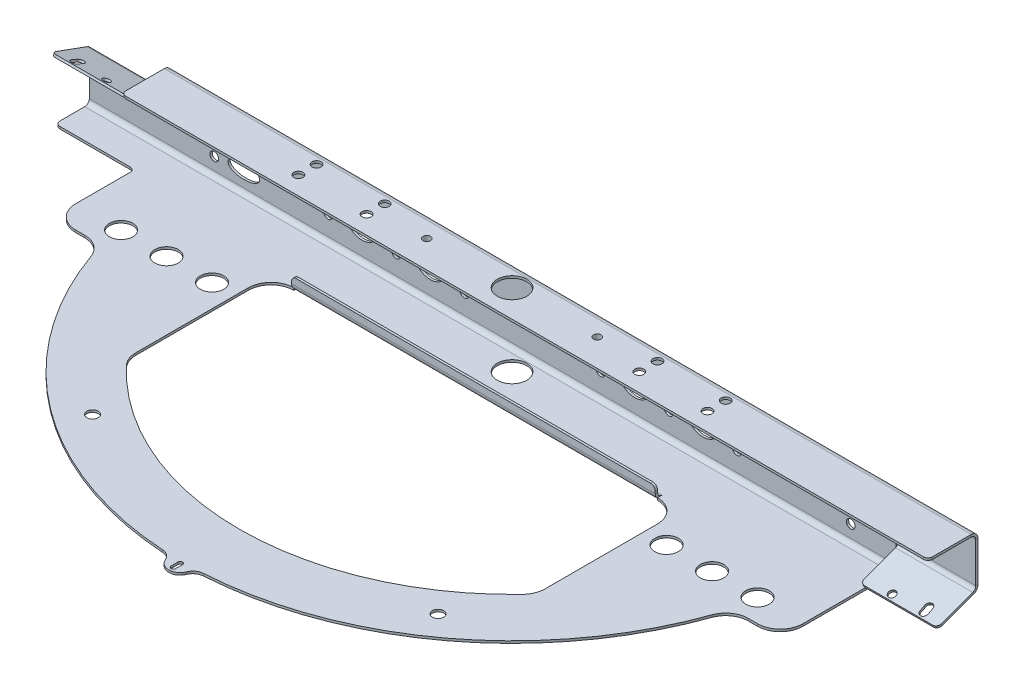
ISO-10303-21;
HEADER;
FILE_DESCRIPTION(('STEP AP214'),'2;1');
FILE_NAME('part.step','',(''),(''),'','','');
FILE_SCHEMA(('AUTOMOTIVE_DESIGN { 1 0 10303 214 1 1 1 1 }'));
ENDSEC;
DATA;
#1=APPLICATION_CONTEXT('core data for automotive mechanical design processes');
#2=APPLICATION_PROTOCOL_DEFINITION('international standard','automotive_design',2000,#1);
#3=PRODUCT_CONTEXT('',#1,'mechanical');
#4=PRODUCT('Part','Part','',(#3));
#5=PRODUCT_RELATED_PRODUCT_CATEGORY('part','',(#4));
#6=PRODUCT_DEFINITION_FORMATION('','',#4);
#7=PRODUCT_DEFINITION_CONTEXT('part definition',#1,'design');
#8=PRODUCT_DEFINITION('design','',#6,#7);
#9=PRODUCT_DEFINITION_SHAPE('','',#8);
#10=(LENGTH_UNIT() NAMED_UNIT(*) SI_UNIT(.MILLI.,.METRE.));
#11=(NAMED_UNIT(*) PLANE_ANGLE_UNIT() SI_UNIT($,.RADIAN.));
#12=(NAMED_UNIT(*) SI_UNIT($,.STERADIAN.) SOLID_ANGLE_UNIT());
#13=UNCERTAINTY_MEASURE_WITH_UNIT(LENGTH_MEASURE(1.E-05),#10,'distance_accuracy_value','');
#14=(GEOMETRIC_REPRESENTATION_CONTEXT(3) GLOBAL_UNCERTAINTY_ASSIGNED_CONTEXT((#13)) GLOBAL_UNIT_ASSIGNED_CONTEXT((#10,
#11,#12)) REPRESENTATION_CONTEXT('',''));
#15=CARTESIAN_POINT('',(0.,0.,0.));
#16=DIRECTION('',(0.,0.,1.));
#17=DIRECTION('',(1.,0.,0.));
#18=AXIS2_PLACEMENT_3D('',#15,#16,#17);
#19=CARTESIAN_POINT('',(150.,-16.5,9.99999999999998));
#20=DIRECTION('',(0.,1.,0.));
#21=DIRECTION('',(0.,0.,1.));
#22=AXIS2_PLACEMENT_3D('',#19,#20,#21);
#23=CYLINDRICAL_SURFACE('',#22,145.);
#24=CARTESIAN_POINT('',(150.,-15.5,9.99999999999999));
#25=DIRECTION('',(0.,1.,0.));
#26=DIRECTION('',(0.,0.,1.));
#27=AXIS2_PLACEMENT_3D('',#24,#25,#26);
#28=CIRCLE('',#27,145.);
#29=CARTESIAN_POINT('',(158.975884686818,-15.5000000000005,154.721917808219));
#30=VERTEX_POINT('',#29);
#31=CARTESIAN_POINT('',(286.596662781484,-15.5000000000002,58.6451612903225));
#32=VERTEX_POINT('',#31);
#33=EDGE_CURVE('E827',#30,#32,#28,.T.);
#34=ORIENTED_EDGE('',*,*,#33,.F.);
#35=DIRECTION('',(0.,-1.,0.));
#36=VECTOR('',#35,1.);
#37=CARTESIAN_POINT('',(158.975884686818,-15.5000000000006,154.721917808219));
#38=LINE('',#37,#36);
#39=CARTESIAN_POINT('',(158.975884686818,-16.5000000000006,154.721917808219));
#40=VERTEX_POINT('',#39);
#41=EDGE_CURVE('E635',#30,#40,#38,.T.);
#42=ORIENTED_EDGE('',*,*,#41,.T.);
#43=CARTESIAN_POINT('',(150.,-16.5,9.99999999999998));
#44=DIRECTION('',(0.,1.,0.));
#45=DIRECTION('',(0.,0.,1.));
#46=AXIS2_PLACEMENT_3D('',#43,#44,#45);
#47=CIRCLE('',#46,145.);
#48=CARTESIAN_POINT('',(286.596662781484,-16.5000000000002,58.6451612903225));
#49=VERTEX_POINT('',#48);
#50=EDGE_CURVE('E838',#40,#49,#47,.T.);
#51=ORIENTED_EDGE('',*,*,#50,.T.);
#52=DIRECTION('',(0.,1.,0.));
#53=VECTOR('',#52,1.);
#54=CARTESIAN_POINT('',(286.596662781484,-16.5000000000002,58.6451612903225));
#55=LINE('',#54,#53);
#56=EDGE_CURVE('E1318',#49,#32,#55,.T.);
#57=ORIENTED_EDGE('',*,*,#56,.T.);
#58=EDGE_LOOP('',(#34,#42,#51,#57));
#59=FACE_BOUND('',#58,.T.);
#60=ADVANCED_FACE('F94',(#59),#23,.T.);
#61=CARTESIAN_POINT('',(230.,-15.5000000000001,25.9999999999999));
#62=DIRECTION('',(-1.,0.,0.));
#63=DIRECTION('',(0.,0.,1.));
#64=AXIS2_PLACEMENT_3D('',#61,#62,#63);
#65=PLANE('',#64);
#66=DIRECTION('',(0.,1.,0.));
#67=VECTOR('',#66,1.);
#68=CARTESIAN_POINT('',(230.,-15.5000000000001,25.9999999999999));
#69=LINE('',#68,#67);
#70=CARTESIAN_POINT('',(230.,-16.5000000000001,25.9999999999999));
#71=VERTEX_POINT('',#70);
#72=CARTESIAN_POINT('',(230.,-15.7360679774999,25.9999999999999));
#73=VERTEX_POINT('',#72);
#74=EDGE_CURVE('E1327',#71,#73,#69,.T.);
#75=ORIENTED_EDGE('',*,*,#74,.T.);
#76=CARTESIAN_POINT('',(230.,-13.5000000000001,23.9999999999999));
#77=DIRECTION('',(1.,0.,0.));
#78=DIRECTION('',(0.,0.,-1.));
#79=AXIS2_PLACEMENT_3D('',#76,#77,#78);
#80=CIRCLE('',#79,3.00000000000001);
#81=CARTESIAN_POINT('',(230.,-16.5000000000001,23.9999999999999));
#82=VERTEX_POINT('',#81);
#83=EDGE_CURVE('E677',#73,#82,#80,.T.);
#84=ORIENTED_EDGE('',*,*,#83,.T.);
#85=DIRECTION('',(0.,0.,1.));
#86=VECTOR('',#85,1.);
#87=CARTESIAN_POINT('',(230.,-16.5000000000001,16.0000000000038));
#88=LINE('',#87,#86);
#89=EDGE_CURVE('E688',#82,#71,#88,.T.);
#90=ORIENTED_EDGE('',*,*,#89,.T.);
#91=EDGE_LOOP('',(#75,#84,#90));
#92=FACE_BOUND('',#91,.T.);
#93=ADVANCED_FACE('F1566',(#92),#65,.T.);
#94=CARTESIAN_POINT('',(70.,-15.5000000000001,23.9999999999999));
#95=DIRECTION('',(1.,0.,0.));
#96=DIRECTION('',(0.,0.,-1.));
#97=AXIS2_PLACEMENT_3D('',#94,#95,#96);
#98=PLANE('',#97);
#99=DIRECTION('',(0.,0.,-1.));
#100=VECTOR('',#99,1.);
#101=CARTESIAN_POINT('',(70.,-16.5000000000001,15.9999999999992));
#102=LINE('',#101,#100);
#103=CARTESIAN_POINT('',(70.,-16.5000000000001,25.9999999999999));
#104=VERTEX_POINT('',#103);
#105=CARTESIAN_POINT('',(70.,-16.5000000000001,23.9999999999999));
#106=VERTEX_POINT('',#105);
#107=EDGE_CURVE('E693',#104,#106,#102,.T.);
#108=ORIENTED_EDGE('',*,*,#107,.T.);
#109=CARTESIAN_POINT('',(70.,-13.5000000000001,23.9999999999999));
#110=DIRECTION('',(1.,0.,0.));
#111=DIRECTION('',(0.,0.,-1.));
#112=AXIS2_PLACEMENT_3D('',#109,#110,#111);
#113=CIRCLE('',#112,3.00000000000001);
#114=CARTESIAN_POINT('',(70.,-15.7360679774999,25.9999999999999));
#115=VERTEX_POINT('',#114);
#116=EDGE_CURVE('E671',#106,#115,#113,.F.);
#117=ORIENTED_EDGE('',*,*,#116,.T.);
#118=DIRECTION('',(0.,1.,0.));
#119=VECTOR('',#118,1.);
#120=CARTESIAN_POINT('',(70.,-16.5000000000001,25.9999999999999));
#121=LINE('',#120,#119);
#122=EDGE_CURVE('E1330',#115,#104,#121,.F.);
#123=ORIENTED_EDGE('',*,*,#122,.T.);
#124=EDGE_LOOP('',(#108,#117,#123));
#125=FACE_BOUND('',#124,.T.);
#126=ADVANCED_FACE('F1571',(#125),#98,.T.);
#127=CARTESIAN_POINT('',(-45.,-16.5000000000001,16.));
#128=DIRECTION('',(0.,1.,0.));
#129=DIRECTION('',(0.,0.,1.));
#130=AXIS2_PLACEMENT_3D('',#127,#128,#129);
#131=PLANE('',#130);
#132=DIRECTION('',(0.,0.,-1.));
#133=VECTOR('',#132,1.);
#134=CARTESIAN_POINT('',(151.,-16.5000000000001,16.));
#135=LINE('',#134,#133);
#136=CARTESIAN_POINT('',(151.,-16.5000000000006,159.));
#137=VERTEX_POINT('',#136);
#138=CARTESIAN_POINT('',(151.,-16.5000000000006,156.));
#139=VERTEX_POINT('',#138);
#140=EDGE_CURVE('E605',#137,#139,#135,.T.);
#141=ORIENTED_EDGE('',*,*,#140,.T.);
#142=CARTESIAN_POINT('',(150.,-16.5000000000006,156.));
#143=DIRECTION('',(0.,1.,0.));
#144=DIRECTION('',(0.,0.,1.));
#145=AXIS2_PLACEMENT_3D('',#142,#143,#144);
#146=CIRCLE('',#145,1.00000000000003);
#147=CARTESIAN_POINT('',(149.,-16.5000000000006,156.));
#148=VERTEX_POINT('',#147);
#149=EDGE_CURVE('E608',#139,#148,#146,.T.);
#150=ORIENTED_EDGE('',*,*,#149,.T.);
#151=DIRECTION('',(0.,0.,1.));
#152=VECTOR('',#151,1.);
#153=CARTESIAN_POINT('',(149.,-16.5000000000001,16.));
#154=LINE('',#153,#152);
#155=CARTESIAN_POINT('',(149.,-16.5000000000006,159.));
#156=VERTEX_POINT('',#155);
#157=EDGE_CURVE('E600',#148,#156,#154,.T.);
#158=ORIENTED_EDGE('',*,*,#157,.T.);
#159=CARTESIAN_POINT('',(150.,-16.5000000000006,159.));
#160=DIRECTION('',(0.,1.,0.));
#161=DIRECTION('',(0.,0.,1.));
#162=AXIS2_PLACEMENT_3D('',#159,#160,#161);
#163=CIRCLE('',#162,1.00000000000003);
#164=EDGE_CURVE('E580',#156,#137,#163,.T.);
#165=ORIENTED_EDGE('',*,*,#164,.T.);
#166=EDGE_LOOP('',(#141,#150,#158,#165));
#167=FACE_BOUND('',#166,.T.);
#168=CARTESIAN_POINT('',(225.998877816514,-16.5000000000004,118.537645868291));
#169=DIRECTION('',(0.,1.,0.));
#170=DIRECTION('',(0.,0.,1.));
#171=AXIS2_PLACEMENT_3D('',#168,#169,#170);
#172=CIRCLE('',#171,2.50000000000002);
#173=CARTESIAN_POINT('',(225.998877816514,-16.5000000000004,121.037645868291));
#174=VERTEX_POINT('',#173);
#175=EDGE_CURVE('E811',#174,#174,#172,.T.);
#176=ORIENTED_EDGE('',*,*,#175,.T.);
#177=EDGE_LOOP('',(#176));
#178=FACE_BOUND('',#177,.T.);
#179=CARTESIAN_POINT('',(74.0011221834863,-16.5000000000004,118.537645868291));
#180=DIRECTION('',(0.,1.,0.));
#181=DIRECTION('',(0.,0.,-1.));
#182=AXIS2_PLACEMENT_3D('',#179,#180,#181);
#183=CIRCLE('',#182,2.5);
#184=CARTESIAN_POINT('',(74.0011221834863,-16.5000000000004,116.037645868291));
#185=VERTEX_POINT('',#184);
#186=EDGE_CURVE('E804',#185,#185,#183,.T.);
#187=ORIENTED_EDGE('',*,*,#186,.T.);
#188=EDGE_LOOP('',(#187));
#189=FACE_BOUND('',#188,.T.);
#190=CARTESIAN_POINT('',(150.,-16.5,9.99999999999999));
#191=DIRECTION('',(0.,-1.,0.));
#192=DIRECTION('',(0.,0.,-1.));
#193=AXIS2_PLACEMENT_3D('',#190,#191,#192);
#194=CIRCLE('',#193,6.50000000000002);
#195=CARTESIAN_POINT('',(150.,-16.5,3.49999999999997));
#196=VERTEX_POINT('',#195);
#197=EDGE_CURVE('E1044',#196,#196,#194,.T.);
#198=ORIENTED_EDGE('',*,*,#197,.F.);
#199=EDGE_LOOP('',(#198));
#200=FACE_BOUND('',#199,.T.);
#201=DIRECTION('',(1.,0.,0.));
#202=VECTOR('',#201,1.);
#203=CARTESIAN_POINT('',(-45.,-16.5000000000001,16.));
#204=LINE('',#203,#202);
#205=CARTESIAN_POINT('',(-43.,-16.5000000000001,16.));
#206=VERTEX_POINT('',#205);
#207=CARTESIAN_POINT('',(-12.,-16.5000000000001,16.));
#208=VERTEX_POINT('',#207);
#209=EDGE_CURVE('E1073',#206,#208,#204,.T.);
#210=ORIENTED_EDGE('',*,*,#209,.F.);
#211=CARTESIAN_POINT('',(-43.,-16.5,14.));
#212=DIRECTION('',(0.,1.,0.));
#213=DIRECTION('',(0.,0.,1.));
#214=AXIS2_PLACEMENT_3D('',#211,#212,#213);
#215=CIRCLE('',#214,2.);
#216=CARTESIAN_POINT('',(-45.,-16.5,14.));
#217=VERTEX_POINT('',#216);
#218=EDGE_CURVE('E1382',#206,#217,#215,.F.);
#219=ORIENTED_EDGE('',*,*,#218,.T.);
#220=DIRECTION('',(0.,0.,1.));
#221=VECTOR('',#220,1.);
#222=CARTESIAN_POINT('',(-45.,-16.5,0.999999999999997));
#223=LINE('',#222,#221);
#224=CARTESIAN_POINT('',(-45.,-16.5,2.99999999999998));
#225=VERTEX_POINT('',#224);
#226=EDGE_CURVE('E1070',#225,#217,#223,.T.);
#227=ORIENTED_EDGE('',*,*,#226,.F.);
#228=DIRECTION('',(-1.,0.,0.));
#229=VECTOR('',#228,1.);
#230=CARTESIAN_POINT('',(-45.,-16.5,2.99999999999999));
#231=LINE('',#230,#229);
#232=CARTESIAN_POINT('',(310.,-16.5,2.99999999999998));
#233=VERTEX_POINT('',#232);
#234=EDGE_CURVE('E1065',#233,#225,#231,.T.);
#235=ORIENTED_EDGE('',*,*,#234,.F.);
#236=DIRECTION('',(0.,0.,-1.));
#237=VECTOR('',#236,1.);
#238=CARTESIAN_POINT('',(310.,-16.5000000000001,16.));
#239=LINE('',#238,#237);
#240=CARTESIAN_POINT('',(310.,-16.5000000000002,41.9999999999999));
#241=VERTEX_POINT('',#240);
#242=EDGE_CURVE('E1077',#241,#233,#239,.T.);
#243=ORIENTED_EDGE('',*,*,#242,.F.);
#244=CARTESIAN_POINT('',(300.,-16.5000000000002,41.9999999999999));
#245=DIRECTION('',(0.,1.,0.));
#246=DIRECTION('',(0.,0.,1.));
#247=AXIS2_PLACEMENT_3D('',#244,#245,#246);
#248=CIRCLE('',#247,10.);
#249=CARTESIAN_POINT('',(300.,-16.5000000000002,51.9999999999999));
#250=VERTEX_POINT('',#249);
#251=EDGE_CURVE('E1297',#241,#250,#248,.F.);
#252=ORIENTED_EDGE('',*,*,#251,.T.);
#253=DIRECTION('',(-1.,0.,0.));
#254=VECTOR('',#253,1.);
#255=CARTESIAN_POINT('',(288.784004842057,-16.5000000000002,51.9999999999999));
#256=LINE('',#255,#254);
#257=CARTESIAN_POINT('',(296.017122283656,-16.5000000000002,51.9999999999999));
#258=VERTEX_POINT('',#257);
#259=EDGE_CURVE('E732',#250,#258,#256,.T.);
#260=ORIENTED_EDGE('',*,*,#259,.T.);
#261=CARTESIAN_POINT('',(296.017122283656,-16.5000000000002,61.9999999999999));
#262=DIRECTION('',(0.,1.,0.));
#263=DIRECTION('',(0.,0.,1.));
#264=AXIS2_PLACEMENT_3D('',#261,#262,#263);
#265=CIRCLE('',#264,10.);
#266=EDGE_CURVE('E1344',#258,#49,#265,.T.);
#267=ORIENTED_EDGE('',*,*,#266,.T.);
#268=ORIENTED_EDGE('',*,*,#50,.F.);
#269=CARTESIAN_POINT('',(159.28539795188,-16.5000000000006,159.712328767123));
#270=DIRECTION('',(0.,1.,0.));
#271=DIRECTION('',(0.,0.,-1.));
#272=AXIS2_PLACEMENT_3D('',#269,#270,#271);
#273=CIRCLE('',#272,5.00000000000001);
#274=CARTESIAN_POINT('',(154.64269897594,-16.5000000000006,157.856164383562));
#275=VERTEX_POINT('',#274);
#276=EDGE_CURVE('E625',#40,#275,#273,.T.);
#277=ORIENTED_EDGE('',*,*,#276,.T.);
#278=CARTESIAN_POINT('',(150.,-16.5000000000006,156.));
#279=DIRECTION('',(0.,-1.,0.));
#280=DIRECTION('',(0.,0.,-1.));
#281=AXIS2_PLACEMENT_3D('',#278,#279,#280);
#282=CIRCLE('',#281,5.00000000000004);
#283=CARTESIAN_POINT('',(145.35730102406,-16.5000000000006,157.856164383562));
#284=VERTEX_POINT('',#283);
#285=EDGE_CURVE('E616',#275,#284,#282,.T.);
#286=ORIENTED_EDGE('',*,*,#285,.T.);
#287=CARTESIAN_POINT('',(140.714602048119,-16.5000000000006,159.712328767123));
#288=DIRECTION('',(0.,1.,0.));
#289=DIRECTION('',(0.,0.,-1.));
#290=AXIS2_PLACEMENT_3D('',#287,#288,#289);
#291=CIRCLE('',#290,4.99999999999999);
#292=CARTESIAN_POINT('',(141.024115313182,-16.5000000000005,154.721917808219));
#293=VERTEX_POINT('',#292);
#294=EDGE_CURVE('E611',#284,#293,#291,.T.);
#295=ORIENTED_EDGE('',*,*,#294,.T.);
#296=CARTESIAN_POINT('',(13.4033372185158,-16.5000000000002,58.6451612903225));
#297=VERTEX_POINT('',#296);
#298=EDGE_CURVE('E835',#297,#293,#47,.T.);
#299=ORIENTED_EDGE('',*,*,#298,.F.);
#300=CARTESIAN_POINT('',(3.98287771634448,-16.5000000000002,61.9999999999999));
#301=DIRECTION('',(0.,1.,0.));
#302=DIRECTION('',(0.,0.,1.));
#303=AXIS2_PLACEMENT_3D('',#300,#301,#302);
#304=CIRCLE('',#303,10.);
#305=CARTESIAN_POINT('',(3.98287771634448,-16.5000000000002,51.9999999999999));
#306=VERTEX_POINT('',#305);
#307=EDGE_CURVE('E1366',#297,#306,#304,.T.);
#308=ORIENTED_EDGE('',*,*,#307,.T.);
#309=DIRECTION('',(-1.,0.,0.));
#310=VECTOR('',#309,1.);
#311=CARTESIAN_POINT('',(-9.99999999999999,-16.5000000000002,51.9999999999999));
#312=LINE('',#311,#310);
#313=CARTESIAN_POINT('',(0.,-16.5000000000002,51.9999999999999));
#314=VERTEX_POINT('',#313);
#315=EDGE_CURVE('E736',#306,#314,#312,.T.);
#316=ORIENTED_EDGE('',*,*,#315,.T.);
#317=CARTESIAN_POINT('',(0.,-16.5000000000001,41.9999999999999));
#318=DIRECTION('',(0.,1.,0.));
#319=DIRECTION('',(0.,0.,1.));
#320=AXIS2_PLACEMENT_3D('',#317,#318,#319);
#321=CIRCLE('',#320,10.);
#322=CARTESIAN_POINT('',(-9.99999999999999,-16.5000000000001,41.9999999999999));
#323=VERTEX_POINT('',#322);
#324=EDGE_CURVE('E1299',#314,#323,#321,.F.);
#325=ORIENTED_EDGE('',*,*,#324,.T.);
#326=DIRECTION('',(0.,0.,-1.));
#327=VECTOR('',#326,1.);
#328=CARTESIAN_POINT('',(-9.99999999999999,-16.5000000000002,51.9999999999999));
#329=LINE('',#328,#327);
#330=CARTESIAN_POINT('',(-9.99999999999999,-16.5000000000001,18.));
#331=VERTEX_POINT('',#330);
#332=EDGE_CURVE('E743',#323,#331,#329,.T.);
#333=ORIENTED_EDGE('',*,*,#332,.T.);
#334=CARTESIAN_POINT('',(-12.,-16.5000000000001,18.));
#335=DIRECTION('',(0.,1.,0.));
#336=DIRECTION('',(0.,0.,1.));
#337=AXIS2_PLACEMENT_3D('',#334,#335,#336);
#338=CIRCLE('',#337,2.);
#339=EDGE_CURVE('E103',#331,#208,#338,.T.);
#340=ORIENTED_EDGE('',*,*,#339,.T.);
#341=EDGE_LOOP('',(#210,#219,#227,#235,#243,#252,#260,#267,#268,#277,#286,#295,#299,#308,#316,
#325,#333,#340));
#342=FACE_BOUND('',#341,.T.);
#343=CARTESIAN_POINT('',(50.,-16.5000000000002,42.));
#344=DIRECTION('',(0.,1.,0.));
#345=DIRECTION('',(0.,0.,1.));
#346=AXIS2_PLACEMENT_3D('',#343,#344,#345);
#347=CIRCLE('',#346,5.14999999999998);
#348=CARTESIAN_POINT('',(50.,-16.5000000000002,47.15));
#349=VERTEX_POINT('',#348);
#350=EDGE_CURVE('E729',#349,#349,#347,.T.);
#351=ORIENTED_EDGE('',*,*,#350,.T.);
#352=EDGE_LOOP('',(#351));
#353=FACE_BOUND('',#352,.T.);
#354=CARTESIAN_POINT('',(30.,-16.5000000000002,42.));
#355=DIRECTION('',(0.,1.,0.));
#356=DIRECTION('',(0.,0.,1.));
#357=AXIS2_PLACEMENT_3D('',#354,#355,#356);
#358=CIRCLE('',#357,5.14999999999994);
#359=CARTESIAN_POINT('',(30.,-16.5000000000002,47.1499999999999));
#360=VERTEX_POINT('',#359);
#361=EDGE_CURVE('E723',#360,#360,#358,.T.);
#362=ORIENTED_EDGE('',*,*,#361,.T.);
#363=EDGE_LOOP('',(#362));
#364=FACE_BOUND('',#363,.T.);
#365=CARTESIAN_POINT('',(10.,-16.5000000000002,42.));
#366=DIRECTION('',(0.,1.,0.));
#367=DIRECTION('',(0.,0.,1.));
#368=AXIS2_PLACEMENT_3D('',#365,#366,#367);
#369=CIRCLE('',#368,5.14999999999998);
#370=CARTESIAN_POINT('',(10.,-16.5000000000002,47.15));
#371=VERTEX_POINT('',#370);
#372=EDGE_CURVE('E717',#371,#371,#369,.T.);
#373=ORIENTED_EDGE('',*,*,#372,.T.);
#374=EDGE_LOOP('',(#373));
#375=FACE_BOUND('',#374,.T.);
#376=CARTESIAN_POINT('',(290.,-16.5000000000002,42.));
#377=DIRECTION('',(0.,1.,0.));
#378=DIRECTION('',(0.,0.,1.));
#379=AXIS2_PLACEMENT_3D('',#376,#377,#378);
#380=CIRCLE('',#379,5.14999999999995);
#381=CARTESIAN_POINT('',(290.,-16.5000000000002,47.1499999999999));
#382=VERTEX_POINT('',#381);
#383=EDGE_CURVE('E711',#382,#382,#380,.T.);
#384=ORIENTED_EDGE('',*,*,#383,.T.);
#385=EDGE_LOOP('',(#384));
#386=FACE_BOUND('',#385,.T.);
#387=CARTESIAN_POINT('',(270.,-16.5000000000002,42.));
#388=DIRECTION('',(0.,1.,0.));
#389=DIRECTION('',(0.,0.,1.));
#390=AXIS2_PLACEMENT_3D('',#387,#388,#389);
#391=CIRCLE('',#390,5.14999999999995);
#392=CARTESIAN_POINT('',(270.,-16.5000000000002,47.1499999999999));
#393=VERTEX_POINT('',#392);
#394=EDGE_CURVE('E705',#393,#393,#391,.T.);
#395=ORIENTED_EDGE('',*,*,#394,.T.);
#396=EDGE_LOOP('',(#395));
#397=FACE_BOUND('',#396,.T.);
#398=CARTESIAN_POINT('',(250.,-16.5000000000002,42.));
#399=DIRECTION('',(0.,1.,0.));
#400=DIRECTION('',(0.,0.,1.));
#401=AXIS2_PLACEMENT_3D('',#398,#399,#400);
#402=CIRCLE('',#401,5.14999999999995);
#403=CARTESIAN_POINT('',(250.,-16.5000000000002,47.1499999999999));
#404=VERTEX_POINT('',#403);
#405=EDGE_CURVE('E699',#404,#404,#402,.T.);
#406=ORIENTED_EDGE('',*,*,#405,.T.);
#407=EDGE_LOOP('',(#406));
#408=FACE_BOUND('',#407,.T.);
#409=ORIENTED_EDGE('',*,*,#89,.F.);
#410=DIRECTION('',(1.,0.,0.));
#411=VECTOR('',#410,1.);
#412=CARTESIAN_POINT('',(230.,-16.5000000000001,23.9999999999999));
#413=LINE('',#412,#411);
#414=EDGE_CURVE('E667',#82,#106,#413,.F.);
#415=ORIENTED_EDGE('',*,*,#414,.T.);
#416=ORIENTED_EDGE('',*,*,#107,.F.);
#417=CARTESIAN_POINT('',(70.,-16.5000000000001,35.9999999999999));
#418=DIRECTION('',(0.,1.,0.));
#419=DIRECTION('',(0.,0.,1.));
#420=AXIS2_PLACEMENT_3D('',#417,#418,#419);
#421=CIRCLE('',#420,10.);
#422=CARTESIAN_POINT('',(60.,-16.5000000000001,35.9999999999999));
#423=VERTEX_POINT('',#422);
#424=EDGE_CURVE('E1352',#104,#423,#421,.T.);
#425=ORIENTED_EDGE('',*,*,#424,.T.);
#426=DIRECTION('',(0.,0.,1.));
#427=VECTOR('',#426,1.);
#428=CARTESIAN_POINT('',(60.,-16.5000000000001,25.9999999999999));
#429=LINE('',#428,#427);
#430=CARTESIAN_POINT('',(60.,-16.5000000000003,85.4983443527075));
#431=VERTEX_POINT('',#430);
#432=EDGE_CURVE('E824',#423,#431,#429,.T.);
#433=ORIENTED_EDGE('',*,*,#432,.T.);
#434=CARTESIAN_POINT('',(70.,-16.5000000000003,85.4983443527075));
#435=DIRECTION('',(0.,1.,0.));
#436=DIRECTION('',(0.,0.,1.));
#437=AXIS2_PLACEMENT_3D('',#434,#435,#436);
#438=CIRCLE('',#437,10.);
#439=CARTESIAN_POINT('',(62.7272727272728,-16.5000000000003,92.3618302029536));
#440=VERTEX_POINT('',#439);
#441=EDGE_CURVE('E1356',#431,#440,#438,.T.);
#442=ORIENTED_EDGE('',*,*,#441,.T.);
#443=CARTESIAN_POINT('',(150.,-16.5,9.99999999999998));
#444=DIRECTION('',(0.,1.,0.));
#445=DIRECTION('',(0.,0.,1.));
#446=AXIS2_PLACEMENT_3D('',#443,#444,#445);
#447=CIRCLE('',#446,120.);
#448=CARTESIAN_POINT('',(237.272727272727,-16.5000000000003,92.3618302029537));
#449=VERTEX_POINT('',#448);
#450=EDGE_CURVE('E817',#440,#449,#447,.T.);
#451=ORIENTED_EDGE('',*,*,#450,.T.);
#452=CARTESIAN_POINT('',(230.,-16.5000000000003,85.4983443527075));
#453=DIRECTION('',(0.,1.,0.));
#454=DIRECTION('',(0.,0.,1.));
#455=AXIS2_PLACEMENT_3D('',#452,#453,#454);
#456=CIRCLE('',#455,10.);
#457=CARTESIAN_POINT('',(240.,-16.5000000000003,85.4983443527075));
#458=VERTEX_POINT('',#457);
#459=EDGE_CURVE('E1360',#449,#458,#456,.T.);
#460=ORIENTED_EDGE('',*,*,#459,.T.);
#461=DIRECTION('',(0.,0.,-1.));
#462=VECTOR('',#461,1.);
#463=CARTESIAN_POINT('',(240.,-16.5000000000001,25.9999999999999));
#464=LINE('',#463,#462);
#465=CARTESIAN_POINT('',(240.,-16.5000000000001,35.9999999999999));
#466=VERTEX_POINT('',#465);
#467=EDGE_CURVE('E820',#458,#466,#464,.T.);
#468=ORIENTED_EDGE('',*,*,#467,.T.);
#469=CARTESIAN_POINT('',(230.,-16.5000000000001,35.9999999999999));
#470=DIRECTION('',(0.,1.,0.));
#471=DIRECTION('',(0.,0.,1.));
#472=AXIS2_PLACEMENT_3D('',#469,#470,#471);
#473=CIRCLE('',#472,10.);
#474=EDGE_CURVE('E1364',#466,#71,#473,.T.);
#475=ORIENTED_EDGE('',*,*,#474,.T.);
#476=EDGE_LOOP('',(#409,#415,#416,#425,#433,#442,#451,#460,#468,#475));
#477=FACE_BOUND('',#476,.T.);
#478=ADVANCED_FACE('F1630',(#167,#178,#189,#200,#342,#353,#364,#375,#386,#397,#408,#477),#131,.F.);
#479=CARTESIAN_POINT('',(-45.,-15.5000000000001,16.));
#480=DIRECTION('',(0.,1.,0.));
#481=DIRECTION('',(0.,0.,1.));
#482=AXIS2_PLACEMENT_3D('',#479,#480,#481);
#483=PLANE('',#482);
#484=CARTESIAN_POINT('',(150.,-15.5000000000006,156.));
#485=DIRECTION('',(0.,1.,0.));
#486=DIRECTION('',(0.,0.,1.));
#487=AXIS2_PLACEMENT_3D('',#484,#485,#486);
#488=CIRCLE('',#487,1.00000000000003);
#489=CARTESIAN_POINT('',(151.,-15.5000000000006,156.));
#490=VERTEX_POINT('',#489);
#491=CARTESIAN_POINT('',(149.,-15.5000000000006,156.));
#492=VERTEX_POINT('',#491);
#493=EDGE_CURVE('E119',#490,#492,#488,.T.);
#494=ORIENTED_EDGE('',*,*,#493,.F.);
#495=DIRECTION('',(0.,0.,-1.));
#496=VECTOR('',#495,1.);
#497=CARTESIAN_POINT('',(151.,-15.5000000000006,156.));
#498=LINE('',#497,#496);
#499=CARTESIAN_POINT('',(151.,-15.5000000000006,159.));
#500=VERTEX_POINT('',#499);
#501=EDGE_CURVE('E593',#500,#490,#498,.T.);
#502=ORIENTED_EDGE('',*,*,#501,.F.);
#503=CARTESIAN_POINT('',(150.,-15.5000000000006,159.));
#504=DIRECTION('',(0.,1.,0.));
#505=DIRECTION('',(0.,0.,1.));
#506=AXIS2_PLACEMENT_3D('',#503,#504,#505);
#507=CIRCLE('',#506,1.00000000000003);
#508=CARTESIAN_POINT('',(149.,-15.5000000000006,159.));
#509=VERTEX_POINT('',#508);
#510=EDGE_CURVE('E577',#509,#500,#507,.T.);
#511=ORIENTED_EDGE('',*,*,#510,.F.);
#512=DIRECTION('',(0.,0.,1.));
#513=VECTOR('',#512,1.);
#514=CARTESIAN_POINT('',(149.,-15.5000000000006,156.));
#515=LINE('',#514,#513);
#516=EDGE_CURVE('E586',#492,#509,#515,.T.);
#517=ORIENTED_EDGE('',*,*,#516,.F.);
#518=EDGE_LOOP('',(#494,#502,#511,#517));
#519=FACE_BOUND('',#518,.T.);
#520=CARTESIAN_POINT('',(225.998877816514,-15.5000000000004,118.537645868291));
#521=DIRECTION('',(0.,1.,0.));
#522=DIRECTION('',(0.,0.,1.));
#523=AXIS2_PLACEMENT_3D('',#520,#521,#522);
#524=CIRCLE('',#523,2.50000000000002);
#525=CARTESIAN_POINT('',(225.998877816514,-15.5000000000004,121.037645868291));
#526=VERTEX_POINT('',#525);
#527=EDGE_CURVE('E807',#526,#526,#524,.T.);
#528=ORIENTED_EDGE('',*,*,#527,.F.);
#529=EDGE_LOOP('',(#528));
#530=FACE_BOUND('',#529,.T.);
#531=CARTESIAN_POINT('',(74.0011221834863,-15.5000000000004,118.537645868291));
#532=DIRECTION('',(0.,1.,0.));
#533=DIRECTION('',(0.,0.,-1.));
#534=AXIS2_PLACEMENT_3D('',#531,#532,#533);
#535=CIRCLE('',#534,2.5);
#536=CARTESIAN_POINT('',(74.0011221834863,-15.5000000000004,116.037645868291));
#537=VERTEX_POINT('',#536);
#538=EDGE_CURVE('E808',#537,#537,#535,.T.);
#539=ORIENTED_EDGE('',*,*,#538,.F.);
#540=EDGE_LOOP('',(#539));
#541=FACE_BOUND('',#540,.T.);
#542=CARTESIAN_POINT('',(150.,-15.5,9.99999999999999));
#543=DIRECTION('',(0.,1.,0.));
#544=DIRECTION('',(0.,0.,1.));
#545=AXIS2_PLACEMENT_3D('',#542,#543,#544);
#546=CIRCLE('',#545,6.50000000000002);
#547=CARTESIAN_POINT('',(150.,-15.5000000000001,16.5));
#548=VERTEX_POINT('',#547);
#549=EDGE_CURVE('E1050',#548,#548,#546,.T.);
#550=ORIENTED_EDGE('',*,*,#549,.F.);
#551=EDGE_LOOP('',(#550));
#552=FACE_BOUND('',#551,.T.);
#553=DIRECTION('',(0.,0.,1.));
#554=VECTOR('',#553,1.);
#555=CARTESIAN_POINT('',(-45.,-15.5,1.));
#556=LINE('',#555,#554);
#557=CARTESIAN_POINT('',(-45.,-15.5,2.99999999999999));
#558=VERTEX_POINT('',#557);
#559=CARTESIAN_POINT('',(-45.,-15.5,14.));
#560=VERTEX_POINT('',#559);
#561=EDGE_CURVE('E1069',#558,#560,#556,.T.);
#562=ORIENTED_EDGE('',*,*,#561,.T.);
#563=CARTESIAN_POINT('',(-43.,-15.5,14.));
#564=DIRECTION('',(0.,1.,0.));
#565=DIRECTION('',(0.,0.,1.));
#566=AXIS2_PLACEMENT_3D('',#563,#564,#565);
#567=CIRCLE('',#566,2.);
#568=CARTESIAN_POINT('',(-43.,-15.5000000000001,16.));
#569=VERTEX_POINT('',#568);
#570=EDGE_CURVE('E1380',#560,#569,#567,.T.);
#571=ORIENTED_EDGE('',*,*,#570,.T.);
#572=DIRECTION('',(1.,0.,0.));
#573=VECTOR('',#572,1.);
#574=CARTESIAN_POINT('',(-45.,-15.5000000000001,16.));
#575=LINE('',#574,#573);
#576=CARTESIAN_POINT('',(-12.,-15.5000000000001,16.));
#577=VERTEX_POINT('',#576);
#578=EDGE_CURVE('E1082',#569,#577,#575,.T.);
#579=ORIENTED_EDGE('',*,*,#578,.T.);
#580=CARTESIAN_POINT('',(-12.,-15.5000000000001,18.));
#581=DIRECTION('',(0.,1.,0.));
#582=DIRECTION('',(0.,0.,1.));
#583=AXIS2_PLACEMENT_3D('',#580,#581,#582);
#584=CIRCLE('',#583,2.);
#585=CARTESIAN_POINT('',(-9.99999999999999,-15.5000000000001,18.));
#586=VERTEX_POINT('',#585);
#587=EDGE_CURVE('E13',#577,#586,#584,.F.);
#588=ORIENTED_EDGE('',*,*,#587,.T.);
#589=DIRECTION('',(0.,0.,-1.));
#590=VECTOR('',#589,1.);
#591=CARTESIAN_POINT('',(-9.99999999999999,-15.5000000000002,51.9999999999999));
#592=LINE('',#591,#590);
#593=CARTESIAN_POINT('',(-9.99999999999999,-15.5000000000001,41.9999999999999));
#594=VERTEX_POINT('',#593);
#595=EDGE_CURVE('E742',#594,#586,#592,.T.);
#596=ORIENTED_EDGE('',*,*,#595,.F.);
#597=CARTESIAN_POINT('',(0.,-15.5000000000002,41.9999999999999));
#598=DIRECTION('',(0.,1.,0.));
#599=DIRECTION('',(0.,0.,1.));
#600=AXIS2_PLACEMENT_3D('',#597,#598,#599);
#601=CIRCLE('',#600,10.);
#602=CARTESIAN_POINT('',(0.,-15.5000000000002,51.9999999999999));
#603=VERTEX_POINT('',#602);
#604=EDGE_CURVE('E1305',#594,#603,#601,.T.);
#605=ORIENTED_EDGE('',*,*,#604,.T.);
#606=DIRECTION('',(-1.,0.,0.));
#607=VECTOR('',#606,1.);
#608=CARTESIAN_POINT('',(-9.99999999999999,-15.5000000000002,51.9999999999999));
#609=LINE('',#608,#607);
#610=CARTESIAN_POINT('',(3.98287771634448,-15.5000000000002,51.9999999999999));
#611=VERTEX_POINT('',#610);
#612=EDGE_CURVE('E739',#611,#603,#609,.T.);
#613=ORIENTED_EDGE('',*,*,#612,.F.);
#614=CARTESIAN_POINT('',(3.98287771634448,-15.5000000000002,61.9999999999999));
#615=DIRECTION('',(0.,1.,0.));
#616=DIRECTION('',(0.,0.,1.));
#617=AXIS2_PLACEMENT_3D('',#614,#615,#616);
#618=CIRCLE('',#617,10.);
#619=CARTESIAN_POINT('',(13.4033372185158,-15.5000000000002,58.6451612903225));
#620=VERTEX_POINT('',#619);
#621=EDGE_CURVE('E1368',#611,#620,#618,.F.);
#622=ORIENTED_EDGE('',*,*,#621,.T.);
#623=CARTESIAN_POINT('',(141.024115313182,-15.5000000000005,154.721917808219));
#624=VERTEX_POINT('',#623);
#625=EDGE_CURVE('E839',#620,#624,#28,.T.);
#626=ORIENTED_EDGE('',*,*,#625,.T.);
#627=CARTESIAN_POINT('',(140.714602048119,-15.5000000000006,159.712328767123));
#628=DIRECTION('',(0.,1.,0.));
#629=DIRECTION('',(0.,0.,-1.));
#630=AXIS2_PLACEMENT_3D('',#627,#628,#629);
#631=CIRCLE('',#630,4.99999999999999);
#632=CARTESIAN_POINT('',(145.35730102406,-15.5000000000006,157.856164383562));
#633=VERTEX_POINT('',#632);
#634=EDGE_CURVE('E612',#633,#624,#631,.T.);
#635=ORIENTED_EDGE('',*,*,#634,.F.);
#636=CARTESIAN_POINT('',(150.,-15.5000000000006,156.));
#637=DIRECTION('',(0.,-1.,0.));
#638=DIRECTION('',(0.,0.,-1.));
#639=AXIS2_PLACEMENT_3D('',#636,#637,#638);
#640=CIRCLE('',#639,5.00000000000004);
#641=CARTESIAN_POINT('',(154.64269897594,-15.5000000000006,157.856164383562));
#642=VERTEX_POINT('',#641);
#643=EDGE_CURVE('E619',#642,#633,#640,.T.);
#644=ORIENTED_EDGE('',*,*,#643,.F.);
#645=CARTESIAN_POINT('',(159.28539795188,-15.5000000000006,159.712328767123));
#646=DIRECTION('',(0.,1.,0.));
#647=DIRECTION('',(0.,0.,-1.));
#648=AXIS2_PLACEMENT_3D('',#645,#646,#647);
#649=CIRCLE('',#648,5.00000000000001);
#650=EDGE_CURVE('E615',#30,#642,#649,.T.);
#651=ORIENTED_EDGE('',*,*,#650,.F.);
#652=ORIENTED_EDGE('',*,*,#33,.T.);
#653=CARTESIAN_POINT('',(296.017122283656,-15.5000000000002,61.9999999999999));
#654=DIRECTION('',(0.,1.,0.));
#655=DIRECTION('',(0.,0.,1.));
#656=AXIS2_PLACEMENT_3D('',#653,#654,#655);
#657=CIRCLE('',#656,10.);
#658=CARTESIAN_POINT('',(296.017122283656,-15.5000000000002,51.9999999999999));
#659=VERTEX_POINT('',#658);
#660=EDGE_CURVE('E1347',#32,#659,#657,.F.);
#661=ORIENTED_EDGE('',*,*,#660,.T.);
#662=DIRECTION('',(-1.,0.,0.));
#663=VECTOR('',#662,1.);
#664=CARTESIAN_POINT('',(288.784004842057,-15.5000000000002,51.9999999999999));
#665=LINE('',#664,#663);
#666=CARTESIAN_POINT('',(300.,-15.5000000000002,51.9999999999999));
#667=VERTEX_POINT('',#666);
#668=EDGE_CURVE('E733',#667,#659,#665,.T.);
#669=ORIENTED_EDGE('',*,*,#668,.F.);
#670=CARTESIAN_POINT('',(300.,-15.5000000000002,41.9999999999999));
#671=DIRECTION('',(0.,1.,0.));
#672=DIRECTION('',(0.,0.,1.));
#673=AXIS2_PLACEMENT_3D('',#670,#671,#672);
#674=CIRCLE('',#673,10.);
#675=CARTESIAN_POINT('',(310.,-15.5000000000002,41.9999999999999));
#676=VERTEX_POINT('',#675);
#677=EDGE_CURVE('E1303',#667,#676,#674,.T.);
#678=ORIENTED_EDGE('',*,*,#677,.T.);
#679=DIRECTION('',(0.,0.,-1.));
#680=VECTOR('',#679,1.);
#681=CARTESIAN_POINT('',(310.,-15.5000000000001,16.));
#682=LINE('',#681,#680);
#683=CARTESIAN_POINT('',(310.,-15.5,2.99999999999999));
#684=VERTEX_POINT('',#683);
#685=EDGE_CURVE('E1074',#676,#684,#682,.T.);
#686=ORIENTED_EDGE('',*,*,#685,.T.);
#687=DIRECTION('',(1.,0.,0.));
#688=VECTOR('',#687,1.);
#689=CARTESIAN_POINT('',(-45.,-15.5,2.99999999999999));
#690=LINE('',#689,#688);
#691=EDGE_CURVE('E1059',#558,#684,#690,.T.);
#692=ORIENTED_EDGE('',*,*,#691,.F.);
#693=EDGE_LOOP('',(#562,#571,#579,#588,#596,#605,#613,#622,#626,#635,#644,#651,#652,#661,#669,
#678,#686,#692));
#694=FACE_BOUND('',#693,.T.);
#695=CARTESIAN_POINT('',(50.,-15.5000000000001,42.));
#696=DIRECTION('',(0.,1.,0.));
#697=DIRECTION('',(0.,0.,1.));
#698=AXIS2_PLACEMENT_3D('',#695,#696,#697);
#699=CIRCLE('',#698,5.14999999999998);
#700=CARTESIAN_POINT('',(50.,-15.5000000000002,47.15));
#701=VERTEX_POINT('',#700);
#702=EDGE_CURVE('E726',#701,#701,#699,.T.);
#703=ORIENTED_EDGE('',*,*,#702,.F.);
#704=EDGE_LOOP('',(#703));
#705=FACE_BOUND('',#704,.T.);
#706=CARTESIAN_POINT('',(30.,-15.5000000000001,42.));
#707=DIRECTION('',(0.,1.,0.));
#708=DIRECTION('',(0.,0.,1.));
#709=AXIS2_PLACEMENT_3D('',#706,#707,#708);
#710=CIRCLE('',#709,5.14999999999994);
#711=CARTESIAN_POINT('',(30.,-15.5000000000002,47.1499999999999));
#712=VERTEX_POINT('',#711);
#713=EDGE_CURVE('E720',#712,#712,#710,.T.);
#714=ORIENTED_EDGE('',*,*,#713,.F.);
#715=EDGE_LOOP('',(#714));
#716=FACE_BOUND('',#715,.T.);
#717=CARTESIAN_POINT('',(10.,-15.5000000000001,42.));
#718=DIRECTION('',(0.,1.,0.));
#719=DIRECTION('',(0.,0.,1.));
#720=AXIS2_PLACEMENT_3D('',#717,#718,#719);
#721=CIRCLE('',#720,5.14999999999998);
#722=CARTESIAN_POINT('',(10.,-15.5000000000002,47.15));
#723=VERTEX_POINT('',#722);
#724=EDGE_CURVE('E714',#723,#723,#721,.T.);
#725=ORIENTED_EDGE('',*,*,#724,.F.);
#726=EDGE_LOOP('',(#725));
#727=FACE_BOUND('',#726,.T.);
#728=CARTESIAN_POINT('',(290.,-15.5000000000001,42.));
#729=DIRECTION('',(0.,1.,0.));
#730=DIRECTION('',(0.,0.,-1.));
#731=AXIS2_PLACEMENT_3D('',#728,#729,#730);
#732=CIRCLE('',#731,5.14999999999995);
#733=CARTESIAN_POINT('',(290.,-15.5000000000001,36.85));
#734=VERTEX_POINT('',#733);
#735=EDGE_CURVE('E708',#734,#734,#732,.T.);
#736=ORIENTED_EDGE('',*,*,#735,.F.);
#737=EDGE_LOOP('',(#736));
#738=FACE_BOUND('',#737,.T.);
#739=CARTESIAN_POINT('',(270.,-15.5000000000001,42.));
#740=DIRECTION('',(0.,1.,0.));
#741=DIRECTION('',(0.,0.,-1.));
#742=AXIS2_PLACEMENT_3D('',#739,#740,#741);
#743=CIRCLE('',#742,5.14999999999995);
#744=CARTESIAN_POINT('',(270.,-15.5000000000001,36.85));
#745=VERTEX_POINT('',#744);
#746=EDGE_CURVE('E702',#745,#745,#743,.T.);
#747=ORIENTED_EDGE('',*,*,#746,.F.);
#748=EDGE_LOOP('',(#747));
#749=FACE_BOUND('',#748,.T.);
#750=CARTESIAN_POINT('',(250.,-15.5000000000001,42.));
#751=DIRECTION('',(0.,1.,0.));
#752=DIRECTION('',(0.,0.,-1.));
#753=AXIS2_PLACEMENT_3D('',#750,#751,#752);
#754=CIRCLE('',#753,5.14999999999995);
#755=CARTESIAN_POINT('',(250.,-15.5000000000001,36.85));
#756=VERTEX_POINT('',#755);
#757=EDGE_CURVE('E696',#756,#756,#754,.T.);
#758=ORIENTED_EDGE('',*,*,#757,.F.);
#759=EDGE_LOOP('',(#758));
#760=FACE_BOUND('',#759,.T.);
#761=DIRECTION('',(1.,0.,0.));
#762=VECTOR('',#761,1.);
#763=CARTESIAN_POINT('',(230.,-15.5000000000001,23.9999999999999));
#764=LINE('',#763,#762);
#765=CARTESIAN_POINT('',(230.,-15.5000000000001,23.9999999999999));
#766=VERTEX_POINT('',#765);
#767=CARTESIAN_POINT('',(70.,-15.5000000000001,23.9999999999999));
#768=VERTEX_POINT('',#767);
#769=EDGE_CURVE('E680',#766,#768,#764,.F.);
#770=ORIENTED_EDGE('',*,*,#769,.F.);
#771=DIRECTION('',(0.,0.,-1.));
#772=VECTOR('',#771,1.);
#773=CARTESIAN_POINT('',(230.,-15.5000000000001,25.9999999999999));
#774=LINE('',#773,#772);
#775=CARTESIAN_POINT('',(230.,-15.5000000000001,25.9999999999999));
#776=VERTEX_POINT('',#775);
#777=EDGE_CURVE('E685',#776,#766,#774,.T.);
#778=ORIENTED_EDGE('',*,*,#777,.F.);
#779=CARTESIAN_POINT('',(230.,-15.5000000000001,35.9999999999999));
#780=DIRECTION('',(0.,1.,0.));
#781=DIRECTION('',(0.,0.,1.));
#782=AXIS2_PLACEMENT_3D('',#779,#780,#781);
#783=CIRCLE('',#782,10.);
#784=CARTESIAN_POINT('',(240.,-15.5000000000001,35.9999999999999));
#785=VERTEX_POINT('',#784);
#786=EDGE_CURVE('E1362',#776,#785,#783,.F.);
#787=ORIENTED_EDGE('',*,*,#786,.T.);
#788=DIRECTION('',(0.,0.,-1.));
#789=VECTOR('',#788,1.);
#790=CARTESIAN_POINT('',(240.,-15.5000000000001,25.9999999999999));
#791=LINE('',#790,#789);
#792=CARTESIAN_POINT('',(240.,-15.5000000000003,85.4983443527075));
#793=VERTEX_POINT('',#792);
#794=EDGE_CURVE('E830',#793,#785,#791,.T.);
#795=ORIENTED_EDGE('',*,*,#794,.F.);
#796=CARTESIAN_POINT('',(230.,-15.5000000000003,85.4983443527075));
#797=DIRECTION('',(0.,1.,0.));
#798=DIRECTION('',(0.,0.,1.));
#799=AXIS2_PLACEMENT_3D('',#796,#797,#798);
#800=CIRCLE('',#799,10.);
#801=CARTESIAN_POINT('',(237.272727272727,-15.5000000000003,92.3618302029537));
#802=VERTEX_POINT('',#801);
#803=EDGE_CURVE('E1358',#793,#802,#800,.F.);
#804=ORIENTED_EDGE('',*,*,#803,.T.);
#805=CARTESIAN_POINT('',(150.,-15.5,9.99999999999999));
#806=DIRECTION('',(0.,1.,0.));
#807=DIRECTION('',(0.,0.,1.));
#808=AXIS2_PLACEMENT_3D('',#805,#806,#807);
#809=CIRCLE('',#808,120.);
#810=CARTESIAN_POINT('',(62.7272727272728,-15.5000000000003,92.3618302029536));
#811=VERTEX_POINT('',#810);
#812=EDGE_CURVE('E814',#811,#802,#809,.T.);
#813=ORIENTED_EDGE('',*,*,#812,.F.);
#814=CARTESIAN_POINT('',(70.,-15.5000000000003,85.4983443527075));
#815=DIRECTION('',(0.,1.,0.));
#816=DIRECTION('',(0.,0.,1.));
#817=AXIS2_PLACEMENT_3D('',#814,#815,#816);
#818=CIRCLE('',#817,10.);
#819=CARTESIAN_POINT('',(60.,-15.5000000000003,85.4983443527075));
#820=VERTEX_POINT('',#819);
#821=EDGE_CURVE('E1354',#811,#820,#818,.F.);
#822=ORIENTED_EDGE('',*,*,#821,.T.);
#823=DIRECTION('',(0.,0.,1.));
#824=VECTOR('',#823,1.);
#825=CARTESIAN_POINT('',(60.,-15.5000000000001,25.9999999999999));
#826=LINE('',#825,#824);
#827=CARTESIAN_POINT('',(60.,-15.5000000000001,35.9999999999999));
#828=VERTEX_POINT('',#827);
#829=EDGE_CURVE('E821',#828,#820,#826,.T.);
#830=ORIENTED_EDGE('',*,*,#829,.F.);
#831=CARTESIAN_POINT('',(70.,-15.5000000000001,35.9999999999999));
#832=DIRECTION('',(0.,1.,0.));
#833=DIRECTION('',(0.,0.,1.));
#834=AXIS2_PLACEMENT_3D('',#831,#832,#833);
#835=CIRCLE('',#834,10.);
#836=CARTESIAN_POINT('',(70.,-15.5000000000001,25.9999999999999));
#837=VERTEX_POINT('',#836);
#838=EDGE_CURVE('E1349',#828,#837,#835,.F.);
#839=ORIENTED_EDGE('',*,*,#838,.T.);
#840=DIRECTION('',(0.,0.,1.));
#841=VECTOR('',#840,1.);
#842=CARTESIAN_POINT('',(70.,-15.5000000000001,23.9999999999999));
#843=LINE('',#842,#841);
#844=EDGE_CURVE('E673',#768,#837,#843,.T.);
#845=ORIENTED_EDGE('',*,*,#844,.F.);
#846=EDGE_LOOP('',(#770,#778,#787,#795,#804,#813,#822,#830,#839,#845));
#847=FACE_BOUND('',#846,.T.);
#848=ADVANCED_FACE('F590',(#519,#530,#541,#552,#694,#705,#716,#727,#738,#749,#760,#847),#483,.T.);
#849=CARTESIAN_POINT('',(300.,-15.5,1.));
#850=DIRECTION('',(0.,0.,-1.));
#851=DIRECTION('',(-1.,0.,0.));
#852=AXIS2_PLACEMENT_3D('',#849,#850,#851);
#853=PLANE('',#852);
#854=CARTESIAN_POINT('',(75.,0.116700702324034,1.));
#855=DIRECTION('',(0.,0.,-1.));
#856=DIRECTION('',(-1.,0.,0.));
#857=AXIS2_PLACEMENT_3D('',#854,#855,#856);
#858=CIRCLE('',#857,7.50000000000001);
#859=CARTESIAN_POINT('',(67.5,0.116700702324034,1.));
#860=VERTEX_POINT('',#859);
#861=EDGE_CURVE('E1454',#860,#860,#858,.T.);
#862=ORIENTED_EDGE('',*,*,#861,.T.);
#863=EDGE_LOOP('',(#862));
#864=FACE_BOUND('',#863,.T.);
#865=CARTESIAN_POINT('',(195.,0.116700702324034,1.));
#866=DIRECTION('',(0.,0.,-1.));
#867=DIRECTION('',(-1.,0.,0.));
#868=AXIS2_PLACEMENT_3D('',#865,#866,#867);
#869=CIRCLE('',#868,7.50000000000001);
#870=CARTESIAN_POINT('',(187.5,0.116700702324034,1.));
#871=VERTEX_POINT('',#870);
#872=EDGE_CURVE('E1460',#871,#871,#869,.T.);
#873=ORIENTED_EDGE('',*,*,#872,.T.);
#874=EDGE_LOOP('',(#873));
#875=FACE_BOUND('',#874,.T.);
#876=CARTESIAN_POINT('',(105.,0.116700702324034,1.));
#877=DIRECTION('',(0.,0.,-1.));
#878=DIRECTION('',(-1.,0.,0.));
#879=AXIS2_PLACEMENT_3D('',#876,#877,#878);
#880=CIRCLE('',#879,7.50000000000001);
#881=CARTESIAN_POINT('',(97.5,0.116700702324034,1.));
#882=VERTEX_POINT('',#881);
#883=EDGE_CURVE('E1466',#882,#882,#880,.T.);
#884=ORIENTED_EDGE('',*,*,#883,.T.);
#885=EDGE_LOOP('',(#884));
#886=FACE_BOUND('',#885,.T.);
#887=CARTESIAN_POINT('',(225.,0.116700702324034,1.));
#888=DIRECTION('',(0.,0.,-1.));
#889=DIRECTION('',(-1.,0.,0.));
#890=AXIS2_PLACEMENT_3D('',#887,#888,#889);
#891=CIRCLE('',#890,7.50000000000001);
#892=CARTESIAN_POINT('',(217.5,0.116700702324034,1.));
#893=VERTEX_POINT('',#892);
#894=EDGE_CURVE('E1472',#893,#893,#891,.T.);
#895=ORIENTED_EDGE('',*,*,#894,.T.);
#896=EDGE_LOOP('',(#895));
#897=FACE_BOUND('',#896,.T.);
#898=CARTESIAN_POINT('',(60.,5.14363969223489,1.));
#899=DIRECTION('',(0.,0.,-1.));
#900=DIRECTION('',(-1.,0.,0.));
#901=AXIS2_PLACEMENT_3D('',#898,#899,#900);
#902=CIRCLE('',#901,2.);
#903=CARTESIAN_POINT('',(58.,5.14363969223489,1.));
#904=VERTEX_POINT('',#903);
#905=EDGE_CURVE('E1478',#904,#904,#902,.T.);
#906=ORIENTED_EDGE('',*,*,#905,.T.);
#907=EDGE_LOOP('',(#906));
#908=FACE_BOUND('',#907,.T.);
#909=CARTESIAN_POINT('',(60.017953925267,-4.85634419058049,1.));
#910=DIRECTION('',(0.,0.,-1.));
#911=DIRECTION('',(-1.,0.,0.));
#912=AXIS2_PLACEMENT_3D('',#909,#910,#911);
#913=CIRCLE('',#912,2.00000000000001);
#914=CARTESIAN_POINT('',(58.017953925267,-4.85634419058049,1.));
#915=VERTEX_POINT('',#914);
#916=EDGE_CURVE('E1484',#915,#915,#913,.T.);
#917=ORIENTED_EDGE('',*,*,#916,.T.);
#918=EDGE_LOOP('',(#917));
#919=FACE_BOUND('',#918,.T.);
#920=CARTESIAN_POINT('',(239.982046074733,-4.85634419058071,1.));
#921=DIRECTION('',(0.,0.,-1.));
#922=DIRECTION('',(-1.,0.,0.));
#923=AXIS2_PLACEMENT_3D('',#920,#921,#922);
#924=CIRCLE('',#923,2.);
#925=CARTESIAN_POINT('',(237.982046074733,-4.85634419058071,1.));
#926=VERTEX_POINT('',#925);
#927=EDGE_CURVE('E1490',#926,#926,#924,.T.);
#928=ORIENTED_EDGE('',*,*,#927,.T.);
#929=EDGE_LOOP('',(#928));
#930=FACE_BOUND('',#929,.T.);
#931=CARTESIAN_POINT('',(240.,5.14363969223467,1.));
#932=DIRECTION('',(0.,0.,-1.));
#933=DIRECTION('',(-1.,0.,0.));
#934=AXIS2_PLACEMENT_3D('',#931,#932,#933);
#935=CIRCLE('',#934,2.);
#936=CARTESIAN_POINT('',(238.,5.14363969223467,1.));
#937=VERTEX_POINT('',#936);
#938=EDGE_CURVE('E1496',#937,#937,#935,.T.);
#939=ORIENTED_EDGE('',*,*,#938,.T.);
#940=EDGE_LOOP('',(#939));
#941=FACE_BOUND('',#940,.T.);
#942=CARTESIAN_POINT('',(120.,5.14363969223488,1.));
#943=DIRECTION('',(0.,0.,-1.));
#944=DIRECTION('',(-1.,0.,0.));
#945=AXIS2_PLACEMENT_3D('',#942,#943,#944);
#946=CIRCLE('',#945,2.);
#947=CARTESIAN_POINT('',(118.,5.14363969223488,1.));
#948=VERTEX_POINT('',#947);
#949=EDGE_CURVE('E1502',#948,#948,#946,.T.);
#950=ORIENTED_EDGE('',*,*,#949,.T.);
#951=EDGE_LOOP('',(#950));
#952=FACE_BOUND('',#951,.T.);
#953=CARTESIAN_POINT('',(120.017953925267,-4.8563441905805,1.));
#954=DIRECTION('',(0.,0.,-1.));
#955=DIRECTION('',(-1.,0.,0.));
#956=AXIS2_PLACEMENT_3D('',#953,#954,#955);
#957=CIRCLE('',#956,2.);
#958=CARTESIAN_POINT('',(118.017953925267,-4.8563441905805,1.));
#959=VERTEX_POINT('',#958);
#960=EDGE_CURVE('E1508',#959,#959,#957,.T.);
#961=ORIENTED_EDGE('',*,*,#960,.T.);
#962=EDGE_LOOP('',(#961));
#963=FACE_BOUND('',#962,.T.);
#964=CARTESIAN_POINT('',(179.982046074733,-4.8563441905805,1.));
#965=DIRECTION('',(0.,0.,-1.));
#966=DIRECTION('',(-1.,0.,0.));
#967=AXIS2_PLACEMENT_3D('',#964,#965,#966);
#968=CIRCLE('',#967,2.);
#969=CARTESIAN_POINT('',(177.982046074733,-4.8563441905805,1.));
#970=VERTEX_POINT('',#969);
#971=EDGE_CURVE('E1514',#970,#970,#968,.T.);
#972=ORIENTED_EDGE('',*,*,#971,.T.);
#973=EDGE_LOOP('',(#972));
#974=FACE_BOUND('',#973,.T.);
#975=CARTESIAN_POINT('',(180.,5.14363969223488,1.));
#976=DIRECTION('',(0.,0.,-1.));
#977=DIRECTION('',(-1.,0.,0.));
#978=AXIS2_PLACEMENT_3D('',#975,#976,#977);
#979=CIRCLE('',#978,2.);
#980=CARTESIAN_POINT('',(178.,5.14363969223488,1.));
#981=VERTEX_POINT('',#980);
#982=EDGE_CURVE('E1520',#981,#981,#979,.T.);
#983=ORIENTED_EDGE('',*,*,#982,.T.);
#984=EDGE_LOOP('',(#983));
#985=FACE_BOUND('',#984,.T.);
#986=CARTESIAN_POINT('',(90.,5.14363969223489,1.));
#987=DIRECTION('',(0.,0.,-1.));
#988=DIRECTION('',(-1.,0.,0.));
#989=AXIS2_PLACEMENT_3D('',#986,#987,#988);
#990=CIRCLE('',#989,2.);
#991=CARTESIAN_POINT('',(88.,5.14363969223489,1.));
#992=VERTEX_POINT('',#991);
#993=EDGE_CURVE('E1526',#992,#992,#990,.T.);
#994=ORIENTED_EDGE('',*,*,#993,.T.);
#995=EDGE_LOOP('',(#994));
#996=FACE_BOUND('',#995,.T.);
#997=CARTESIAN_POINT('',(90.017953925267,-4.85634419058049,1.));
#998=DIRECTION('',(0.,0.,-1.));
#999=DIRECTION('',(-1.,0.,0.));
#1000=AXIS2_PLACEMENT_3D('',#997,#998,#999);
#1001=CIRCLE('',#1000,2.00000000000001);
#1002=CARTESIAN_POINT('',(88.017953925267,-4.85634419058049,1.));
#1003=VERTEX_POINT('',#1002);
#1004=EDGE_CURVE('E1532',#1003,#1003,#1001,.T.);
#1005=ORIENTED_EDGE('',*,*,#1004,.T.);
#1006=EDGE_LOOP('',(#1005));
#1007=FACE_BOUND('',#1006,.T.);
#1008=CARTESIAN_POINT('',(209.982046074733,-4.8563441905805,1.));
#1009=DIRECTION('',(0.,0.,-1.));
#1010=DIRECTION('',(-1.,0.,0.));
#1011=AXIS2_PLACEMENT_3D('',#1008,#1009,#1010);
#1012=CIRCLE('',#1011,2.);
#1013=CARTESIAN_POINT('',(207.982046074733,-4.8563441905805,1.));
#1014=VERTEX_POINT('',#1013);
#1015=EDGE_CURVE('E1538',#1014,#1014,#1012,.T.);
#1016=ORIENTED_EDGE('',*,*,#1015,.T.);
#1017=EDGE_LOOP('',(#1016));
#1018=FACE_BOUND('',#1017,.T.);
#1019=CARTESIAN_POINT('',(210.,5.14363969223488,1.));
#1020=DIRECTION('',(0.,0.,-1.));
#1021=DIRECTION('',(-1.,0.,0.));
#1022=AXIS2_PLACEMENT_3D('',#1019,#1020,#1021);
#1023=CIRCLE('',#1022,2.);
#1024=CARTESIAN_POINT('',(208.,5.14363969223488,1.));
#1025=VERTEX_POINT('',#1024);
#1026=EDGE_CURVE('E1544',#1025,#1025,#1023,.T.);
#1027=ORIENTED_EDGE('',*,*,#1026,.T.);
#1028=EDGE_LOOP('',(#1027));
#1029=FACE_BOUND('',#1028,.T.);
#1030=CARTESIAN_POINT('',(23.,-7.00000000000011,0.999999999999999));
#1031=DIRECTION('',(0.,0.,-1.));
#1032=DIRECTION('',(-1.,0.,0.));
#1033=AXIS2_PLACEMENT_3D('',#1030,#1031,#1032);
#1034=ELLIPSE('',#1033,7.00000000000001,3.25);
#1035=CARTESIAN_POINT('',(16.,-7.00000000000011,0.999999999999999));
#1036=VERTEX_POINT('',#1035);
#1037=EDGE_CURVE('E862',#1036,#1036,#1034,.T.);
#1038=ORIENTED_EDGE('',*,*,#1037,.T.);
#1039=EDGE_LOOP('',(#1038));
#1040=FACE_BOUND('',#1039,.T.);
#1041=CARTESIAN_POINT('',(277.,7.00000000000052,0.999999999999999));
#1042=DIRECTION('',(0.,0.,-1.));
#1043=DIRECTION('',(1.,0.,0.));
#1044=AXIS2_PLACEMENT_3D('',#1041,#1042,#1043);
#1045=ELLIPSE('',#1044,7.00000000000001,3.25);
#1046=CARTESIAN_POINT('',(284.,7.0000000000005,0.999999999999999));
#1047=VERTEX_POINT('',#1046);
#1048=EDGE_CURVE('E866',#1047,#1047,#1045,.T.);
#1049=ORIENTED_EDGE('',*,*,#1048,.T.);
#1050=EDGE_LOOP('',(#1049));
#1051=FACE_BOUND('',#1050,.T.);
#1052=CARTESIAN_POINT('',(290.,-8.00000000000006,0.999999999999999));
#1053=DIRECTION('',(0.,0.,-1.));
#1054=DIRECTION('',(-1.,0.,0.));
#1055=AXIS2_PLACEMENT_3D('',#1052,#1053,#1054);
#1056=CIRCLE('',#1055,1.90000000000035);
#1057=CARTESIAN_POINT('',(288.1,-8.00000000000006,0.999999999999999));
#1058=VERTEX_POINT('',#1057);
#1059=EDGE_CURVE('E872',#1058,#1058,#1056,.T.);
#1060=ORIENTED_EDGE('',*,*,#1059,.T.);
#1061=EDGE_LOOP('',(#1060));
#1062=FACE_BOUND('',#1061,.T.);
#1063=CARTESIAN_POINT('',(299.500000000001,0.,0.999999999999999));
#1064=DIRECTION('',(0.,0.,-1.));
#1065=DIRECTION('',(-1.,0.,0.));
#1066=AXIS2_PLACEMENT_3D('',#1063,#1064,#1065);
#1067=CIRCLE('',#1066,1.90000000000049);
#1068=CARTESIAN_POINT('',(297.6,0.,0.999999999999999));
#1069=VERTEX_POINT('',#1068);
#1070=EDGE_CURVE('E878',#1069,#1069,#1067,.T.);
#1071=ORIENTED_EDGE('',*,*,#1070,.T.);
#1072=EDGE_LOOP('',(#1071));
#1073=FACE_BOUND('',#1072,.T.);
#1074=CARTESIAN_POINT('',(290.,7.99999999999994,0.999999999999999));
#1075=DIRECTION('',(0.,0.,-1.));
#1076=DIRECTION('',(-1.,0.,0.));
#1077=AXIS2_PLACEMENT_3D('',#1074,#1075,#1076);
#1078=CIRCLE('',#1077,1.90000000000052);
#1079=CARTESIAN_POINT('',(288.099999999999,7.99999999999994,0.999999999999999));
#1080=VERTEX_POINT('',#1079);
#1081=EDGE_CURVE('E884',#1080,#1080,#1078,.T.);
#1082=ORIENTED_EDGE('',*,*,#1081,.T.);
#1083=EDGE_LOOP('',(#1082));
#1084=FACE_BOUND('',#1083,.T.);
#1085=CARTESIAN_POINT('',(280.500000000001,0.,0.999999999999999));
#1086=DIRECTION('',(0.,0.,-1.));
#1087=DIRECTION('',(-1.,0.,0.));
#1088=AXIS2_PLACEMENT_3D('',#1085,#1086,#1087);
#1089=CIRCLE('',#1088,1.90000000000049);
#1090=CARTESIAN_POINT('',(278.6,0.,0.999999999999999));
#1091=VERTEX_POINT('',#1090);
#1092=EDGE_CURVE('E890',#1091,#1091,#1089,.T.);
#1093=ORIENTED_EDGE('',*,*,#1092,.T.);
#1094=EDGE_LOOP('',(#1093));
#1095=FACE_BOUND('',#1094,.T.);
#1096=CARTESIAN_POINT('',(0.500000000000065,0.,0.999999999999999));
#1097=DIRECTION('',(0.,0.,-1.));
#1098=DIRECTION('',(-1.,0.,0.));
#1099=AXIS2_PLACEMENT_3D('',#1096,#1097,#1098);
#1100=CIRCLE('',#1099,1.9);
#1101=CARTESIAN_POINT('',(-1.39999999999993,0.,0.999999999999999));
#1102=VERTEX_POINT('',#1101);
#1103=EDGE_CURVE('E896',#1102,#1102,#1100,.T.);
#1104=ORIENTED_EDGE('',*,*,#1103,.T.);
#1105=EDGE_LOOP('',(#1104));
#1106=FACE_BOUND('',#1105,.T.);
#1107=CARTESIAN_POINT('',(9.99999999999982,-7.99999999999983,0.999999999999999));
#1108=DIRECTION('',(0.,0.,-1.));
#1109=DIRECTION('',(-1.,0.,0.));
#1110=AXIS2_PLACEMENT_3D('',#1107,#1108,#1109);
#1111=CIRCLE('',#1110,1.89999999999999);
#1112=CARTESIAN_POINT('',(8.09999999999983,-7.99999999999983,0.999999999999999));
#1113=VERTEX_POINT('',#1112);
#1114=EDGE_CURVE('E902',#1113,#1113,#1111,.T.);
#1115=ORIENTED_EDGE('',*,*,#1114,.T.);
#1116=EDGE_LOOP('',(#1115));
#1117=FACE_BOUND('',#1116,.T.);
#1118=CARTESIAN_POINT('',(19.5000000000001,0.,0.999999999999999));
#1119=DIRECTION('',(0.,0.,-1.));
#1120=DIRECTION('',(-1.,0.,0.));
#1121=AXIS2_PLACEMENT_3D('',#1118,#1119,#1120);
#1122=CIRCLE('',#1121,1.89999999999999);
#1123=CARTESIAN_POINT('',(17.6000000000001,0.,0.999999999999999));
#1124=VERTEX_POINT('',#1123);
#1125=EDGE_CURVE('E908',#1124,#1124,#1122,.T.);
#1126=ORIENTED_EDGE('',*,*,#1125,.T.);
#1127=EDGE_LOOP('',(#1126));
#1128=FACE_BOUND('',#1127,.T.);
#1129=CARTESIAN_POINT('',(9.99999999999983,8.00000000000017,0.999999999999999));
#1130=DIRECTION('',(0.,0.,-1.));
#1131=DIRECTION('',(-1.,0.,0.));
#1132=AXIS2_PLACEMENT_3D('',#1129,#1130,#1131);
#1133=CIRCLE('',#1132,1.9);
#1134=CARTESIAN_POINT('',(8.09999999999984,8.00000000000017,0.999999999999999));
#1135=VERTEX_POINT('',#1134);
#1136=EDGE_CURVE('E914',#1135,#1135,#1133,.T.);
#1137=ORIENTED_EDGE('',*,*,#1136,.T.);
#1138=EDGE_LOOP('',(#1137));
#1139=FACE_BOUND('',#1138,.T.);
#1140=CARTESIAN_POINT('',(290.,0.,0.999999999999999));
#1141=DIRECTION('',(0.,0.,-1.));
#1142=DIRECTION('',(-1.,0.,0.));
#1143=AXIS2_PLACEMENT_3D('',#1140,#1141,#1142);
#1144=CIRCLE('',#1143,4.50000000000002);
#1145=CARTESIAN_POINT('',(285.5,0.,0.999999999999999));
#1146=VERTEX_POINT('',#1145);
#1147=EDGE_CURVE('E936',#1146,#1146,#1144,.T.);
#1148=ORIENTED_EDGE('',*,*,#1147,.T.);
#1149=EDGE_LOOP('',(#1148));
#1150=FACE_BOUND('',#1149,.T.);
#1151=CARTESIAN_POINT('',(10.,0.,0.999999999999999));
#1152=DIRECTION('',(0.,0.,-1.));
#1153=DIRECTION('',(-1.,0.,0.));
#1154=AXIS2_PLACEMENT_3D('',#1151,#1152,#1153);
#1155=CIRCLE('',#1154,4.49999999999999);
#1156=CARTESIAN_POINT('',(5.50000000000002,0.,0.999999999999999));
#1157=VERTEX_POINT('',#1156);
#1158=EDGE_CURVE('E942',#1157,#1157,#1155,.T.);
#1159=ORIENTED_EDGE('',*,*,#1158,.T.);
#1160=EDGE_LOOP('',(#1159));
#1161=FACE_BOUND('',#1160,.T.);
#1162=DIRECTION('',(1.,0.,0.));
#1163=VECTOR('',#1162,1.);
#1164=CARTESIAN_POINT('',(345.,-4.03540715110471,1.));
#1165=LINE('',#1164,#1163);
#1166=CARTESIAN_POINT('',(345.,-4.03540715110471,1.));
#1167=VERTEX_POINT('',#1166);
#1168=CARTESIAN_POINT('',(311.,-4.03540715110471,1.));
#1169=VERTEX_POINT('',#1168);
#1170=EDGE_CURVE('E986',#1167,#1169,#1165,.F.);
#1171=ORIENTED_EDGE('',*,*,#1170,.F.);
#1172=DIRECTION('',(0.,1.,0.));
#1173=VECTOR('',#1172,1.);
#1174=CARTESIAN_POINT('',(345.,-6.50000000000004,1.));
#1175=LINE('',#1174,#1173);
#1176=CARTESIAN_POINT('',(345.,13.5,0.999999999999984));
#1177=VERTEX_POINT('',#1176);
#1178=EDGE_CURVE('E1153',#1167,#1177,#1175,.T.);
#1179=ORIENTED_EDGE('',*,*,#1178,.T.);
#1180=DIRECTION('',(-1.,0.,0.));
#1181=VECTOR('',#1180,1.);
#1182=CARTESIAN_POINT('',(-10.,13.5,0.999999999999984));
#1183=LINE('',#1182,#1181);
#1184=CARTESIAN_POINT('',(-10.,13.5,0.999999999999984));
#1185=VERTEX_POINT('',#1184);
#1186=EDGE_CURVE('E1145',#1185,#1177,#1183,.F.);
#1187=ORIENTED_EDGE('',*,*,#1186,.F.);
#1188=DIRECTION('',(0.,-1.,0.));
#1189=VECTOR('',#1188,1.);
#1190=CARTESIAN_POINT('',(-10.,15.5,1.));
#1191=LINE('',#1190,#1189);
#1192=CARTESIAN_POINT('',(-9.99999999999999,2.5,1.));
#1193=VERTEX_POINT('',#1192);
#1194=EDGE_CURVE('E1178',#1185,#1193,#1191,.T.);
#1195=ORIENTED_EDGE('',*,*,#1194,.T.);
#1196=DIRECTION('',(-1.,0.,0.));
#1197=VECTOR('',#1196,1.);
#1198=CARTESIAN_POINT('',(-9.99999999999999,2.5,1.));
#1199=LINE('',#1198,#1197);
#1200=CARTESIAN_POINT('',(-11.,2.5,1.));
#1201=VERTEX_POINT('',#1200);
#1202=EDGE_CURVE('E1194',#1193,#1201,#1199,.T.);
#1203=ORIENTED_EDGE('',*,*,#1202,.T.);
#1204=DIRECTION('',(0.,1.,0.));
#1205=VECTOR('',#1204,1.);
#1206=CARTESIAN_POINT('',(-11.,6.5,1.));
#1207=LINE('',#1206,#1205);
#1208=CARTESIAN_POINT('',(-11.,4.03540715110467,1.));
#1209=VERTEX_POINT('',#1208);
#1210=EDGE_CURVE('E1197',#1201,#1209,#1207,.T.);
#1211=ORIENTED_EDGE('',*,*,#1210,.T.);
#1212=DIRECTION('',(-1.,0.,0.));
#1213=VECTOR('',#1212,1.);
#1214=CARTESIAN_POINT('',(-45.,4.03540715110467,1.));
#1215=LINE('',#1214,#1213);
#1216=CARTESIAN_POINT('',(-45.,4.03540715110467,1.));
#1217=VERTEX_POINT('',#1216);
#1218=EDGE_CURVE('E1037',#1217,#1209,#1215,.F.);
#1219=ORIENTED_EDGE('',*,*,#1218,.F.);
#1220=DIRECTION('',(0.,-1.,0.));
#1221=VECTOR('',#1220,1.);
#1222=CARTESIAN_POINT('',(-45.,6.5,1.));
#1223=LINE('',#1222,#1221);
#1224=CARTESIAN_POINT('',(-45.,-13.5,1.));
#1225=VERTEX_POINT('',#1224);
#1226=EDGE_CURVE('E1184',#1217,#1225,#1223,.T.);
#1227=ORIENTED_EDGE('',*,*,#1226,.T.);
#1228=DIRECTION('',(1.,0.,0.));
#1229=VECTOR('',#1228,1.);
#1230=CARTESIAN_POINT('',(310.,-13.5,1.));
#1231=LINE('',#1230,#1229);
#1232=CARTESIAN_POINT('',(310.,-13.5,1.));
#1233=VERTEX_POINT('',#1232);
#1234=EDGE_CURVE('E1099',#1233,#1225,#1231,.F.);
#1235=ORIENTED_EDGE('',*,*,#1234,.F.);
#1236=DIRECTION('',(0.,1.,0.));
#1237=VECTOR('',#1236,1.);
#1238=CARTESIAN_POINT('',(310.,-2.50000000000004,1.));
#1239=LINE('',#1238,#1237);
#1240=CARTESIAN_POINT('',(310.,-2.50000000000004,1.));
#1241=VERTEX_POINT('',#1240);
#1242=EDGE_CURVE('E1169',#1233,#1241,#1239,.T.);
#1243=ORIENTED_EDGE('',*,*,#1242,.T.);
#1244=DIRECTION('',(1.,0.,0.));
#1245=VECTOR('',#1244,1.);
#1246=CARTESIAN_POINT('',(311.,-2.50000000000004,1.));
#1247=LINE('',#1246,#1245);
#1248=CARTESIAN_POINT('',(311.,-2.50000000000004,1.));
#1249=VERTEX_POINT('',#1248);
#1250=EDGE_CURVE('E1171',#1241,#1249,#1247,.T.);
#1251=ORIENTED_EDGE('',*,*,#1250,.T.);
#1252=DIRECTION('',(0.,-1.,0.));
#1253=VECTOR('',#1252,1.);
#1254=CARTESIAN_POINT('',(311.,-6.50000000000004,1.));
#1255=LINE('',#1254,#1253);
#1256=EDGE_CURVE('E1159',#1249,#1169,#1255,.T.);
#1257=ORIENTED_EDGE('',*,*,#1256,.T.);
#1258=EDGE_LOOP('',(#1171,#1179,#1187,#1195,#1203,#1211,#1219,#1227,#1235,#1243,#1251,#1257));
#1259=FACE_BOUND('',#1258,.T.);
#1260=ADVANCED_FACE('F1548',(#864,#875,#886,#897,#908,#919,#930,#941,#952,#963,#974,#985,#996,
#1007,#1018,#1029,#1040,#1051,#1062,#1073,#1084,#1095,#1106,#1117,#1128,#1139,#1150,#1161,
#1259),#853,.F.);
#1261=CARTESIAN_POINT('',(300.,-15.5,0.));
#1262=DIRECTION('',(0.,0.,-1.));
#1263=DIRECTION('',(-1.,0.,0.));
#1264=AXIS2_PLACEMENT_3D('',#1261,#1262,#1263);
#1265=PLANE('',#1264);
#1266=CARTESIAN_POINT('',(75.,0.116700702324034,0.));
#1267=DIRECTION('',(0.,0.,-1.));
#1268=DIRECTION('',(1.,0.,0.));
#1269=AXIS2_PLACEMENT_3D('',#1266,#1267,#1268);
#1270=CIRCLE('',#1269,7.50000000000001);
#1271=CARTESIAN_POINT('',(82.5,0.116700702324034,0.));
#1272=VERTEX_POINT('',#1271);
#1273=EDGE_CURVE('E1406',#1272,#1272,#1270,.T.);
#1274=ORIENTED_EDGE('',*,*,#1273,.F.);
#1275=EDGE_LOOP('',(#1274));
#1276=FACE_BOUND('',#1275,.T.);
#1277=CARTESIAN_POINT('',(195.,0.116700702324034,0.));
#1278=DIRECTION('',(0.,0.,-1.));
#1279=DIRECTION('',(-1.,0.,0.));
#1280=AXIS2_PLACEMENT_3D('',#1277,#1278,#1279);
#1281=CIRCLE('',#1280,7.50000000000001);
#1282=CARTESIAN_POINT('',(187.5,0.116700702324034,0.));
#1283=VERTEX_POINT('',#1282);
#1284=EDGE_CURVE('E1457',#1283,#1283,#1281,.T.);
#1285=ORIENTED_EDGE('',*,*,#1284,.F.);
#1286=EDGE_LOOP('',(#1285));
#1287=FACE_BOUND('',#1286,.T.);
#1288=CARTESIAN_POINT('',(105.,0.116700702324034,0.));
#1289=DIRECTION('',(0.,0.,-1.));
#1290=DIRECTION('',(1.,0.,0.));
#1291=AXIS2_PLACEMENT_3D('',#1288,#1289,#1290);
#1292=CIRCLE('',#1291,7.50000000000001);
#1293=CARTESIAN_POINT('',(112.5,0.116700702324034,0.));
#1294=VERTEX_POINT('',#1293);
#1295=EDGE_CURVE('E1463',#1294,#1294,#1292,.T.);
#1296=ORIENTED_EDGE('',*,*,#1295,.F.);
#1297=EDGE_LOOP('',(#1296));
#1298=FACE_BOUND('',#1297,.T.);
#1299=CARTESIAN_POINT('',(225.,0.116700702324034,0.));
#1300=DIRECTION('',(0.,0.,-1.));
#1301=DIRECTION('',(-1.,0.,0.));
#1302=AXIS2_PLACEMENT_3D('',#1299,#1300,#1301);
#1303=CIRCLE('',#1302,7.50000000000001);
#1304=CARTESIAN_POINT('',(217.5,0.116700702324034,0.));
#1305=VERTEX_POINT('',#1304);
#1306=EDGE_CURVE('E1469',#1305,#1305,#1303,.T.);
#1307=ORIENTED_EDGE('',*,*,#1306,.F.);
#1308=EDGE_LOOP('',(#1307));
#1309=FACE_BOUND('',#1308,.T.);
#1310=CARTESIAN_POINT('',(60.,5.14363969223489,0.));
#1311=DIRECTION('',(0.,0.,-1.));
#1312=DIRECTION('',(1.,0.,0.));
#1313=AXIS2_PLACEMENT_3D('',#1310,#1311,#1312);
#1314=CIRCLE('',#1313,2.);
#1315=CARTESIAN_POINT('',(62.,5.14363969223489,0.));
#1316=VERTEX_POINT('',#1315);
#1317=EDGE_CURVE('E1475',#1316,#1316,#1314,.T.);
#1318=ORIENTED_EDGE('',*,*,#1317,.F.);
#1319=EDGE_LOOP('',(#1318));
#1320=FACE_BOUND('',#1319,.T.);
#1321=CARTESIAN_POINT('',(60.017953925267,-4.85634419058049,0.));
#1322=DIRECTION('',(0.,0.,-1.));
#1323=DIRECTION('',(-1.,0.,0.));
#1324=AXIS2_PLACEMENT_3D('',#1321,#1322,#1323);
#1325=CIRCLE('',#1324,2.00000000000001);
#1326=CARTESIAN_POINT('',(58.017953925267,-4.85634419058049,0.));
#1327=VERTEX_POINT('',#1326);
#1328=EDGE_CURVE('E1481',#1327,#1327,#1325,.T.);
#1329=ORIENTED_EDGE('',*,*,#1328,.F.);
#1330=EDGE_LOOP('',(#1329));
#1331=FACE_BOUND('',#1330,.T.);
#1332=CARTESIAN_POINT('',(239.982046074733,-4.85634419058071,0.));
#1333=DIRECTION('',(0.,0.,-1.));
#1334=DIRECTION('',(1.,0.,0.));
#1335=AXIS2_PLACEMENT_3D('',#1332,#1333,#1334);
#1336=CIRCLE('',#1335,2.);
#1337=CARTESIAN_POINT('',(241.982046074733,-4.85634419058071,0.));
#1338=VERTEX_POINT('',#1337);
#1339=EDGE_CURVE('E1487',#1338,#1338,#1336,.T.);
#1340=ORIENTED_EDGE('',*,*,#1339,.F.);
#1341=EDGE_LOOP('',(#1340));
#1342=FACE_BOUND('',#1341,.T.);
#1343=CARTESIAN_POINT('',(240.,5.14363969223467,0.));
#1344=DIRECTION('',(0.,0.,-1.));
#1345=DIRECTION('',(-1.,0.,0.));
#1346=AXIS2_PLACEMENT_3D('',#1343,#1344,#1345);
#1347=CIRCLE('',#1346,2.);
#1348=CARTESIAN_POINT('',(238.,5.14363969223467,0.));
#1349=VERTEX_POINT('',#1348);
#1350=EDGE_CURVE('E1493',#1349,#1349,#1347,.T.);
#1351=ORIENTED_EDGE('',*,*,#1350,.F.);
#1352=EDGE_LOOP('',(#1351));
#1353=FACE_BOUND('',#1352,.T.);
#1354=CARTESIAN_POINT('',(120.,5.14363969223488,0.));
#1355=DIRECTION('',(0.,0.,-1.));
#1356=DIRECTION('',(1.,0.,0.));
#1357=AXIS2_PLACEMENT_3D('',#1354,#1355,#1356);
#1358=CIRCLE('',#1357,2.);
#1359=CARTESIAN_POINT('',(122.,5.14363969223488,0.));
#1360=VERTEX_POINT('',#1359);
#1361=EDGE_CURVE('E1499',#1360,#1360,#1358,.T.);
#1362=ORIENTED_EDGE('',*,*,#1361,.F.);
#1363=EDGE_LOOP('',(#1362));
#1364=FACE_BOUND('',#1363,.T.);
#1365=CARTESIAN_POINT('',(120.017953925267,-4.8563441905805,0.));
#1366=DIRECTION('',(0.,0.,-1.));
#1367=DIRECTION('',(-1.,0.,0.));
#1368=AXIS2_PLACEMENT_3D('',#1365,#1366,#1367);
#1369=CIRCLE('',#1368,2.);
#1370=CARTESIAN_POINT('',(118.017953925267,-4.8563441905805,0.));
#1371=VERTEX_POINT('',#1370);
#1372=EDGE_CURVE('E1505',#1371,#1371,#1369,.T.);
#1373=ORIENTED_EDGE('',*,*,#1372,.F.);
#1374=EDGE_LOOP('',(#1373));
#1375=FACE_BOUND('',#1374,.T.);
#1376=CARTESIAN_POINT('',(179.982046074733,-4.8563441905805,0.));
#1377=DIRECTION('',(0.,0.,-1.));
#1378=DIRECTION('',(1.,0.,0.));
#1379=AXIS2_PLACEMENT_3D('',#1376,#1377,#1378);
#1380=CIRCLE('',#1379,2.);
#1381=CARTESIAN_POINT('',(181.982046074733,-4.8563441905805,0.));
#1382=VERTEX_POINT('',#1381);
#1383=EDGE_CURVE('E1511',#1382,#1382,#1380,.T.);
#1384=ORIENTED_EDGE('',*,*,#1383,.F.);
#1385=EDGE_LOOP('',(#1384));
#1386=FACE_BOUND('',#1385,.T.);
#1387=CARTESIAN_POINT('',(180.,5.14363969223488,0.));
#1388=DIRECTION('',(0.,0.,-1.));
#1389=DIRECTION('',(-1.,0.,0.));
#1390=AXIS2_PLACEMENT_3D('',#1387,#1388,#1389);
#1391=CIRCLE('',#1390,2.);
#1392=CARTESIAN_POINT('',(178.,5.14363969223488,0.));
#1393=VERTEX_POINT('',#1392);
#1394=EDGE_CURVE('E1517',#1393,#1393,#1391,.T.);
#1395=ORIENTED_EDGE('',*,*,#1394,.F.);
#1396=EDGE_LOOP('',(#1395));
#1397=FACE_BOUND('',#1396,.T.);
#1398=CARTESIAN_POINT('',(90.,5.14363969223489,0.));
#1399=DIRECTION('',(0.,0.,-1.));
#1400=DIRECTION('',(1.,0.,0.));
#1401=AXIS2_PLACEMENT_3D('',#1398,#1399,#1400);
#1402=CIRCLE('',#1401,2.);
#1403=CARTESIAN_POINT('',(92.,5.14363969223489,0.));
#1404=VERTEX_POINT('',#1403);
#1405=EDGE_CURVE('E1523',#1404,#1404,#1402,.T.);
#1406=ORIENTED_EDGE('',*,*,#1405,.F.);
#1407=EDGE_LOOP('',(#1406));
#1408=FACE_BOUND('',#1407,.T.);
#1409=CARTESIAN_POINT('',(90.017953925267,-4.85634419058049,0.));
#1410=DIRECTION('',(0.,0.,-1.));
#1411=DIRECTION('',(-1.,0.,0.));
#1412=AXIS2_PLACEMENT_3D('',#1409,#1410,#1411);
#1413=CIRCLE('',#1412,2.00000000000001);
#1414=CARTESIAN_POINT('',(88.017953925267,-4.85634419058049,0.));
#1415=VERTEX_POINT('',#1414);
#1416=EDGE_CURVE('E1529',#1415,#1415,#1413,.T.);
#1417=ORIENTED_EDGE('',*,*,#1416,.F.);
#1418=EDGE_LOOP('',(#1417));
#1419=FACE_BOUND('',#1418,.T.);
#1420=CARTESIAN_POINT('',(209.982046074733,-4.8563441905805,0.));
#1421=DIRECTION('',(0.,0.,-1.));
#1422=DIRECTION('',(1.,0.,0.));
#1423=AXIS2_PLACEMENT_3D('',#1420,#1421,#1422);
#1424=CIRCLE('',#1423,2.);
#1425=CARTESIAN_POINT('',(211.982046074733,-4.8563441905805,0.));
#1426=VERTEX_POINT('',#1425);
#1427=EDGE_CURVE('E1535',#1426,#1426,#1424,.T.);
#1428=ORIENTED_EDGE('',*,*,#1427,.F.);
#1429=EDGE_LOOP('',(#1428));
#1430=FACE_BOUND('',#1429,.T.);
#1431=CARTESIAN_POINT('',(210.,5.14363969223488,0.));
#1432=DIRECTION('',(0.,0.,-1.));
#1433=DIRECTION('',(-1.,0.,0.));
#1434=AXIS2_PLACEMENT_3D('',#1431,#1432,#1433);
#1435=CIRCLE('',#1434,2.);
#1436=CARTESIAN_POINT('',(208.,5.14363969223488,0.));
#1437=VERTEX_POINT('',#1436);
#1438=EDGE_CURVE('E1541',#1437,#1437,#1435,.T.);
#1439=ORIENTED_EDGE('',*,*,#1438,.F.);
#1440=EDGE_LOOP('',(#1439));
#1441=FACE_BOUND('',#1440,.T.);
#1442=CARTESIAN_POINT('',(23.,-7.00000000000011,0.));
#1443=DIRECTION('',(0.,0.,-1.));
#1444=DIRECTION('',(-1.,0.,0.));
#1445=AXIS2_PLACEMENT_3D('',#1442,#1443,#1444);
#1446=ELLIPSE('',#1445,7.00000000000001,3.25);
#1447=CARTESIAN_POINT('',(16.,-7.00000000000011,0.));
#1448=VERTEX_POINT('',#1447);
#1449=EDGE_CURVE('E837',#1448,#1448,#1446,.T.);
#1450=ORIENTED_EDGE('',*,*,#1449,.F.);
#1451=EDGE_LOOP('',(#1450));
#1452=FACE_BOUND('',#1451,.T.);
#1453=CARTESIAN_POINT('',(277.,7.00000000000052,0.));
#1454=DIRECTION('',(0.,0.,-1.));
#1455=DIRECTION('',(1.,0.,0.));
#1456=AXIS2_PLACEMENT_3D('',#1453,#1454,#1455);
#1457=ELLIPSE('',#1456,7.00000000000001,3.25);
#1458=CARTESIAN_POINT('',(284.,7.0000000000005,0.));
#1459=VERTEX_POINT('',#1458);
#1460=EDGE_CURVE('E863',#1459,#1459,#1457,.T.);
#1461=ORIENTED_EDGE('',*,*,#1460,.F.);
#1462=EDGE_LOOP('',(#1461));
#1463=FACE_BOUND('',#1462,.T.);
#1464=CARTESIAN_POINT('',(290.,-8.00000000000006,0.));
#1465=DIRECTION('',(0.,0.,-1.));
#1466=DIRECTION('',(-1.,0.,0.));
#1467=AXIS2_PLACEMENT_3D('',#1464,#1465,#1466);
#1468=CIRCLE('',#1467,1.90000000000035);
#1469=CARTESIAN_POINT('',(288.1,-8.00000000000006,0.));
#1470=VERTEX_POINT('',#1469);
#1471=EDGE_CURVE('E869',#1470,#1470,#1468,.T.);
#1472=ORIENTED_EDGE('',*,*,#1471,.F.);
#1473=EDGE_LOOP('',(#1472));
#1474=FACE_BOUND('',#1473,.T.);
#1475=CARTESIAN_POINT('',(299.500000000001,0.,0.));
#1476=DIRECTION('',(0.,0.,-1.));
#1477=DIRECTION('',(-1.,0.,0.));
#1478=AXIS2_PLACEMENT_3D('',#1475,#1476,#1477);
#1479=CIRCLE('',#1478,1.90000000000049);
#1480=CARTESIAN_POINT('',(297.6,0.,0.));
#1481=VERTEX_POINT('',#1480);
#1482=EDGE_CURVE('E875',#1481,#1481,#1479,.T.);
#1483=ORIENTED_EDGE('',*,*,#1482,.F.);
#1484=EDGE_LOOP('',(#1483));
#1485=FACE_BOUND('',#1484,.T.);
#1486=CARTESIAN_POINT('',(290.,7.99999999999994,0.));
#1487=DIRECTION('',(0.,0.,-1.));
#1488=DIRECTION('',(-1.,0.,0.));
#1489=AXIS2_PLACEMENT_3D('',#1486,#1487,#1488);
#1490=CIRCLE('',#1489,1.90000000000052);
#1491=CARTESIAN_POINT('',(288.099999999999,7.99999999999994,0.));
#1492=VERTEX_POINT('',#1491);
#1493=EDGE_CURVE('E881',#1492,#1492,#1490,.T.);
#1494=ORIENTED_EDGE('',*,*,#1493,.F.);
#1495=EDGE_LOOP('',(#1494));
#1496=FACE_BOUND('',#1495,.T.);
#1497=CARTESIAN_POINT('',(280.500000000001,0.,0.));
#1498=DIRECTION('',(0.,0.,-1.));
#1499=DIRECTION('',(-1.,0.,0.));
#1500=AXIS2_PLACEMENT_3D('',#1497,#1498,#1499);
#1501=CIRCLE('',#1500,1.90000000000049);
#1502=CARTESIAN_POINT('',(278.6,0.,0.));
#1503=VERTEX_POINT('',#1502);
#1504=EDGE_CURVE('E887',#1503,#1503,#1501,.T.);
#1505=ORIENTED_EDGE('',*,*,#1504,.F.);
#1506=EDGE_LOOP('',(#1505));
#1507=FACE_BOUND('',#1506,.T.);
#1508=CARTESIAN_POINT('',(0.500000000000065,0.,0.));
#1509=DIRECTION('',(0.,0.,-1.));
#1510=DIRECTION('',(-1.,0.,0.));
#1511=AXIS2_PLACEMENT_3D('',#1508,#1509,#1510);
#1512=CIRCLE('',#1511,1.9);
#1513=CARTESIAN_POINT('',(-1.39999999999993,0.,0.));
#1514=VERTEX_POINT('',#1513);
#1515=EDGE_CURVE('E893',#1514,#1514,#1512,.T.);
#1516=ORIENTED_EDGE('',*,*,#1515,.F.);
#1517=EDGE_LOOP('',(#1516));
#1518=FACE_BOUND('',#1517,.T.);
#1519=CARTESIAN_POINT('',(9.99999999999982,-7.99999999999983,0.));
#1520=DIRECTION('',(0.,0.,-1.));
#1521=DIRECTION('',(-1.,0.,0.));
#1522=AXIS2_PLACEMENT_3D('',#1519,#1520,#1521);
#1523=CIRCLE('',#1522,1.89999999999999);
#1524=CARTESIAN_POINT('',(8.09999999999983,-7.99999999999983,0.));
#1525=VERTEX_POINT('',#1524);
#1526=EDGE_CURVE('E899',#1525,#1525,#1523,.T.);
#1527=ORIENTED_EDGE('',*,*,#1526,.F.);
#1528=EDGE_LOOP('',(#1527));
#1529=FACE_BOUND('',#1528,.T.);
#1530=CARTESIAN_POINT('',(19.5000000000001,0.,0.));
#1531=DIRECTION('',(0.,0.,-1.));
#1532=DIRECTION('',(-1.,0.,0.));
#1533=AXIS2_PLACEMENT_3D('',#1530,#1531,#1532);
#1534=CIRCLE('',#1533,1.89999999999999);
#1535=CARTESIAN_POINT('',(17.6000000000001,0.,0.));
#1536=VERTEX_POINT('',#1535);
#1537=EDGE_CURVE('E905',#1536,#1536,#1534,.T.);
#1538=ORIENTED_EDGE('',*,*,#1537,.F.);
#1539=EDGE_LOOP('',(#1538));
#1540=FACE_BOUND('',#1539,.T.);
#1541=CARTESIAN_POINT('',(9.99999999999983,8.00000000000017,0.));
#1542=DIRECTION('',(0.,0.,-1.));
#1543=DIRECTION('',(-1.,0.,0.));
#1544=AXIS2_PLACEMENT_3D('',#1541,#1542,#1543);
#1545=CIRCLE('',#1544,1.9);
#1546=CARTESIAN_POINT('',(8.09999999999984,8.00000000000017,0.));
#1547=VERTEX_POINT('',#1546);
#1548=EDGE_CURVE('E911',#1547,#1547,#1545,.T.);
#1549=ORIENTED_EDGE('',*,*,#1548,.F.);
#1550=EDGE_LOOP('',(#1549));
#1551=FACE_BOUND('',#1550,.T.);
#1552=CARTESIAN_POINT('',(290.,0.,0.));
#1553=DIRECTION('',(0.,0.,-1.));
#1554=DIRECTION('',(-1.,0.,0.));
#1555=AXIS2_PLACEMENT_3D('',#1552,#1553,#1554);
#1556=CIRCLE('',#1555,4.50000000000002);
#1557=CARTESIAN_POINT('',(285.5,0.,0.));
#1558=VERTEX_POINT('',#1557);
#1559=EDGE_CURVE('E933',#1558,#1558,#1556,.T.);
#1560=ORIENTED_EDGE('',*,*,#1559,.F.);
#1561=EDGE_LOOP('',(#1560));
#1562=FACE_BOUND('',#1561,.T.);
#1563=CARTESIAN_POINT('',(10.,0.,0.));
#1564=DIRECTION('',(0.,0.,-1.));
#1565=DIRECTION('',(-1.,0.,0.));
#1566=AXIS2_PLACEMENT_3D('',#1563,#1564,#1565);
#1567=CIRCLE('',#1566,4.49999999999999);
#1568=CARTESIAN_POINT('',(5.50000000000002,0.,0.));
#1569=VERTEX_POINT('',#1568);
#1570=EDGE_CURVE('E939',#1569,#1569,#1567,.T.);
#1571=ORIENTED_EDGE('',*,*,#1570,.F.);
#1572=EDGE_LOOP('',(#1571));
#1573=FACE_BOUND('',#1572,.T.);
#1574=DIRECTION('',(0.,1.,0.));
#1575=VECTOR('',#1574,1.);
#1576=CARTESIAN_POINT('',(345.,-6.50000000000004,0.));
#1577=LINE('',#1576,#1575);
#1578=CARTESIAN_POINT('',(345.,-4.03540715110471,0.));
#1579=VERTEX_POINT('',#1578);
#1580=CARTESIAN_POINT('',(345.,13.5,0.));
#1581=VERTEX_POINT('',#1580);
#1582=EDGE_CURVE('E1156',#1579,#1581,#1577,.T.);
#1583=ORIENTED_EDGE('',*,*,#1582,.F.);
#1584=DIRECTION('',(1.,0.,0.));
#1585=VECTOR('',#1584,1.);
#1586=CARTESIAN_POINT('',(345.,-4.03540715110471,0.));
#1587=LINE('',#1586,#1585);
#1588=CARTESIAN_POINT('',(311.,-4.0354071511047,0.));
#1589=VERTEX_POINT('',#1588);
#1590=EDGE_CURVE('E973',#1579,#1589,#1587,.F.);
#1591=ORIENTED_EDGE('',*,*,#1590,.T.);
#1592=DIRECTION('',(0.,-1.,0.));
#1593=VECTOR('',#1592,1.);
#1594=CARTESIAN_POINT('',(311.,-6.50000000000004,0.));
#1595=LINE('',#1594,#1593);
#1596=CARTESIAN_POINT('',(311.,-2.50000000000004,0.));
#1597=VERTEX_POINT('',#1596);
#1598=EDGE_CURVE('E1164',#1597,#1589,#1595,.T.);
#1599=ORIENTED_EDGE('',*,*,#1598,.F.);
#1600=DIRECTION('',(1.,0.,0.));
#1601=VECTOR('',#1600,1.);
#1602=CARTESIAN_POINT('',(311.,-2.50000000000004,0.));
#1603=LINE('',#1602,#1601);
#1604=CARTESIAN_POINT('',(310.,-2.50000000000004,0.));
#1605=VERTEX_POINT('',#1604);
#1606=EDGE_CURVE('E1161',#1605,#1597,#1603,.T.);
#1607=ORIENTED_EDGE('',*,*,#1606,.F.);
#1608=DIRECTION('',(0.,1.,0.));
#1609=VECTOR('',#1608,1.);
#1610=CARTESIAN_POINT('',(310.,-2.50000000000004,0.));
#1611=LINE('',#1610,#1609);
#1612=CARTESIAN_POINT('',(310.,-13.5,0.));
#1613=VERTEX_POINT('',#1612);
#1614=EDGE_CURVE('E1158',#1613,#1605,#1611,.T.);
#1615=ORIENTED_EDGE('',*,*,#1614,.F.);
#1616=DIRECTION('',(1.,0.,0.));
#1617=VECTOR('',#1616,1.);
#1618=CARTESIAN_POINT('',(310.,-13.5,0.));
#1619=LINE('',#1618,#1617);
#1620=CARTESIAN_POINT('',(-45.,-13.5,0.));
#1621=VERTEX_POINT('',#1620);
#1622=EDGE_CURVE('E1086',#1613,#1621,#1619,.F.);
#1623=ORIENTED_EDGE('',*,*,#1622,.T.);
#1624=DIRECTION('',(0.,-1.,0.));
#1625=VECTOR('',#1624,1.);
#1626=CARTESIAN_POINT('',(-45.,6.5,0.));
#1627=LINE('',#1626,#1625);
#1628=CARTESIAN_POINT('',(-45.,4.03540715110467,0.));
#1629=VERTEX_POINT('',#1628);
#1630=EDGE_CURVE('E1190',#1629,#1621,#1627,.T.);
#1631=ORIENTED_EDGE('',*,*,#1630,.F.);
#1632=DIRECTION('',(-1.,0.,0.));
#1633=VECTOR('',#1632,1.);
#1634=CARTESIAN_POINT('',(-45.,4.03540715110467,0.));
#1635=LINE('',#1634,#1633);
#1636=CARTESIAN_POINT('',(-11.,4.03540715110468,0.));
#1637=VERTEX_POINT('',#1636);
#1638=EDGE_CURVE('E1024',#1629,#1637,#1635,.F.);
#1639=ORIENTED_EDGE('',*,*,#1638,.T.);
#1640=DIRECTION('',(0.,1.,0.));
#1641=VECTOR('',#1640,1.);
#1642=CARTESIAN_POINT('',(-11.,6.5,0.));
#1643=LINE('',#1642,#1641);
#1644=CARTESIAN_POINT('',(-11.,2.5,0.));
#1645=VERTEX_POINT('',#1644);
#1646=EDGE_CURVE('E1187',#1645,#1637,#1643,.T.);
#1647=ORIENTED_EDGE('',*,*,#1646,.F.);
#1648=DIRECTION('',(-1.,0.,0.));
#1649=VECTOR('',#1648,1.);
#1650=CARTESIAN_POINT('',(-9.99999999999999,2.5,0.));
#1651=LINE('',#1650,#1649);
#1652=CARTESIAN_POINT('',(-9.99999999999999,2.5,0.));
#1653=VERTEX_POINT('',#1652);
#1654=EDGE_CURVE('E1183',#1653,#1645,#1651,.T.);
#1655=ORIENTED_EDGE('',*,*,#1654,.F.);
#1656=DIRECTION('',(0.,-1.,0.));
#1657=VECTOR('',#1656,1.);
#1658=CARTESIAN_POINT('',(-10.,15.5,0.));
#1659=LINE('',#1658,#1657);
#1660=CARTESIAN_POINT('',(-10.,13.5,0.));
#1661=VERTEX_POINT('',#1660);
#1662=EDGE_CURVE('E1181',#1661,#1653,#1659,.T.);
#1663=ORIENTED_EDGE('',*,*,#1662,.F.);
#1664=DIRECTION('',(-1.,0.,0.));
#1665=VECTOR('',#1664,1.);
#1666=CARTESIAN_POINT('',(-10.,13.5,0.));
#1667=LINE('',#1666,#1665);
#1668=EDGE_CURVE('E1132',#1661,#1581,#1667,.F.);
#1669=ORIENTED_EDGE('',*,*,#1668,.T.);
#1670=EDGE_LOOP('',(#1583,#1591,#1599,#1607,#1615,#1623,#1631,#1639,#1647,#1655,#1663,#1669));
#1671=FACE_BOUND('',#1670,.T.);
#1672=ADVANCED_FACE('F1653',(#1276,#1287,#1298,#1309,#1320,#1331,#1342,#1353,#1364,#1375,#1386,
#1397,#1408,#1419,#1430,#1441,#1452,#1463,#1474,#1485,#1496,#1507,#1518,#1529,#1540,#1551,#1562,
#1573,#1671),#1265,.T.);
#1673=CARTESIAN_POINT('',(345.,-6.50000000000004,0.));
#1674=DIRECTION('',(1.,0.,0.));
#1675=DIRECTION('',(0.,0.,-1.));
#1676=AXIS2_PLACEMENT_3D('',#1673,#1674,#1675);
#1677=PLANE('',#1676);
#1678=ORIENTED_EDGE('',*,*,#1178,.F.);
#1679=DIRECTION('',(0.,0.,-1.));
#1680=VECTOR('',#1679,1.);
#1681=CARTESIAN_POINT('',(345.,-4.03540715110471,1.));
#1682=LINE('',#1681,#1680);
#1683=EDGE_CURVE('E980',#1167,#1579,#1682,.T.);
#1684=ORIENTED_EDGE('',*,*,#1683,.T.);
#1685=ORIENTED_EDGE('',*,*,#1582,.T.);
#1686=DIRECTION('',(0.,0.,-1.));
#1687=VECTOR('',#1686,1.);
#1688=CARTESIAN_POINT('',(345.,13.5,0.999999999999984));
#1689=LINE('',#1688,#1687);
#1690=EDGE_CURVE('E1150',#1177,#1581,#1689,.T.);
#1691=ORIENTED_EDGE('',*,*,#1690,.F.);
#1692=EDGE_LOOP('',(#1678,#1684,#1685,#1691));
#1693=FACE_BOUND('',#1692,.T.);
#1694=ADVANCED_FACE('F1735',(#1693),#1677,.T.);
#1695=CARTESIAN_POINT('',(-45.,6.5,0.));
#1696=DIRECTION('',(-1.,0.,0.));
#1697=DIRECTION('',(0.,0.,1.));
#1698=AXIS2_PLACEMENT_3D('',#1695,#1696,#1697);
#1699=PLANE('',#1698);
#1700=ORIENTED_EDGE('',*,*,#1226,.F.);
#1701=DIRECTION('',(0.,0.,-1.));
#1702=VECTOR('',#1701,1.);
#1703=CARTESIAN_POINT('',(-45.,4.03540715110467,1.));
#1704=LINE('',#1703,#1702);
#1705=EDGE_CURVE('E1031',#1217,#1629,#1704,.T.);
#1706=ORIENTED_EDGE('',*,*,#1705,.T.);
#1707=ORIENTED_EDGE('',*,*,#1630,.T.);
#1708=DIRECTION('',(0.,0.,-1.));
#1709=VECTOR('',#1708,1.);
#1710=CARTESIAN_POINT('',(-45.,-13.5,1.));
#1711=LINE('',#1710,#1709);
#1712=EDGE_CURVE('E1104',#1225,#1621,#1711,.T.);
#1713=ORIENTED_EDGE('',*,*,#1712,.F.);
#1714=EDGE_LOOP('',(#1700,#1706,#1707,#1713));
#1715=FACE_BOUND('',#1714,.T.);
#1716=ADVANCED_FACE('F1649',(#1715),#1699,.T.);
#1717=CARTESIAN_POINT('',(-45.,-16.5000000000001,16.));
#1718=DIRECTION('',(0.,0.,1.));
#1719=DIRECTION('',(0.,-1.,0.));
#1720=AXIS2_PLACEMENT_3D('',#1717,#1718,#1719);
#1721=PLANE('',#1720);
#1722=ORIENTED_EDGE('',*,*,#209,.T.);
#1723=DIRECTION('',(0.,-1.,0.));
#1724=VECTOR('',#1723,1.);
#1725=CARTESIAN_POINT('',(-12.,-15.5000000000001,16.));
#1726=LINE('',#1725,#1724);
#1727=EDGE_CURVE('E1375',#208,#577,#1726,.F.);
#1728=ORIENTED_EDGE('',*,*,#1727,.T.);
#1729=ORIENTED_EDGE('',*,*,#578,.F.);
#1730=DIRECTION('',(0.,1.,0.));
#1731=VECTOR('',#1730,1.);
#1732=CARTESIAN_POINT('',(-43.,-16.5000000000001,16.));
#1733=LINE('',#1732,#1731);
#1734=EDGE_CURVE('E1373',#569,#206,#1733,.F.);
#1735=ORIENTED_EDGE('',*,*,#1734,.T.);
#1736=EDGE_LOOP('',(#1722,#1728,#1729,#1735));
#1737=FACE_BOUND('',#1736,.T.);
#1738=ADVANCED_FACE('F1792',(#1737),#1721,.T.);
#1739=CARTESIAN_POINT('',(310.,-2.50000000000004,0.));
#1740=DIRECTION('',(1.,0.,0.));
#1741=DIRECTION('',(0.,0.,-1.));
#1742=AXIS2_PLACEMENT_3D('',#1739,#1740,#1741);
#1743=PLANE('',#1742);
#1744=ORIENTED_EDGE('',*,*,#1242,.F.);
#1745=DIRECTION('',(0.,0.,-1.));
#1746=VECTOR('',#1745,1.);
#1747=CARTESIAN_POINT('',(310.,-13.5,1.));
#1748=LINE('',#1747,#1746);
#1749=EDGE_CURVE('E1093',#1233,#1613,#1748,.T.);
#1750=ORIENTED_EDGE('',*,*,#1749,.T.);
#1751=ORIENTED_EDGE('',*,*,#1614,.T.);
#1752=DIRECTION('',(0.,0.,1.));
#1753=VECTOR('',#1752,1.);
#1754=CARTESIAN_POINT('',(310.,-2.50000000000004,0.));
#1755=LINE('',#1754,#1753);
#1756=EDGE_CURVE('E1167',#1605,#1241,#1755,.T.);
#1757=ORIENTED_EDGE('',*,*,#1756,.T.);
#1758=EDGE_LOOP('',(#1744,#1750,#1751,#1757));
#1759=FACE_BOUND('',#1758,.T.);
#1760=ADVANCED_FACE('F1661',(#1759),#1743,.T.);
#1761=CARTESIAN_POINT('',(-10.,15.5,0.));
#1762=DIRECTION('',(-1.,0.,0.));
#1763=DIRECTION('',(0.,-1.,0.));
#1764=AXIS2_PLACEMENT_3D('',#1761,#1762,#1763);
#1765=PLANE('',#1764);
#1766=ORIENTED_EDGE('',*,*,#1194,.F.);
#1767=DIRECTION('',(0.,0.,-1.));
#1768=VECTOR('',#1767,1.);
#1769=CARTESIAN_POINT('',(-10.,13.5,0.999999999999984));
#1770=LINE('',#1769,#1768);
#1771=EDGE_CURVE('E1139',#1185,#1661,#1770,.T.);
#1772=ORIENTED_EDGE('',*,*,#1771,.T.);
#1773=ORIENTED_EDGE('',*,*,#1662,.T.);
#1774=DIRECTION('',(0.,0.,1.));
#1775=VECTOR('',#1774,1.);
#1776=CARTESIAN_POINT('',(-9.99999999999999,2.5,0.));
#1777=LINE('',#1776,#1775);
#1778=EDGE_CURVE('E1192',#1653,#1193,#1777,.T.);
#1779=ORIENTED_EDGE('',*,*,#1778,.T.);
#1780=EDGE_LOOP('',(#1766,#1772,#1773,#1779));
#1781=FACE_BOUND('',#1780,.T.);
#1782=ADVANCED_FACE('F1688',(#1781),#1765,.T.);
#1783=CARTESIAN_POINT('',(-11.,6.5,0.));
#1784=DIRECTION('',(1.,0.,0.));
#1785=DIRECTION('',(0.,0.,-1.));
#1786=AXIS2_PLACEMENT_3D('',#1783,#1784,#1785);
#1787=PLANE('',#1786);
#1788=DIRECTION('',(0.,0.,-1.));
#1789=VECTOR('',#1788,1.);
#1790=CARTESIAN_POINT('',(-11.,4.03540715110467,1.));
#1791=LINE('',#1790,#1789);
#1792=EDGE_CURVE('E1041',#1209,#1637,#1791,.T.);
#1793=ORIENTED_EDGE('',*,*,#1792,.F.);
#1794=ORIENTED_EDGE('',*,*,#1210,.F.);
#1795=DIRECTION('',(0.,0.,1.));
#1796=VECTOR('',#1795,1.);
#1797=CARTESIAN_POINT('',(-11.,2.5,0.));
#1798=LINE('',#1797,#1796);
#1799=EDGE_CURVE('E1201',#1645,#1201,#1798,.T.);
#1800=ORIENTED_EDGE('',*,*,#1799,.F.);
#1801=ORIENTED_EDGE('',*,*,#1646,.T.);
#1802=EDGE_LOOP('',(#1793,#1794,#1800,#1801));
#1803=FACE_BOUND('',#1802,.T.);
#1804=ADVANCED_FACE('F1679',(#1803),#1787,.T.);
#1805=CARTESIAN_POINT('',(-9.99999999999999,2.5,0.));
#1806=DIRECTION('',(0.,1.,0.));
#1807=DIRECTION('',(0.,0.,1.));
#1808=AXIS2_PLACEMENT_3D('',#1805,#1806,#1807);
#1809=PLANE('',#1808);
#1810=ORIENTED_EDGE('',*,*,#1202,.F.);
#1811=ORIENTED_EDGE('',*,*,#1778,.F.);
#1812=ORIENTED_EDGE('',*,*,#1654,.T.);
#1813=ORIENTED_EDGE('',*,*,#1799,.T.);
#1814=EDGE_LOOP('',(#1810,#1811,#1812,#1813));
#1815=FACE_BOUND('',#1814,.T.);
#1816=ADVANCED_FACE('F1685',(#1815),#1809,.T.);
#1817=CARTESIAN_POINT('',(311.,-6.50000000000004,0.));
#1818=DIRECTION('',(-1.,0.,0.));
#1819=DIRECTION('',(0.,0.,1.));
#1820=AXIS2_PLACEMENT_3D('',#1817,#1818,#1819);
#1821=PLANE('',#1820);
#1822=DIRECTION('',(0.,0.,-1.));
#1823=VECTOR('',#1822,1.);
#1824=CARTESIAN_POINT('',(311.,-4.03540715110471,1.));
#1825=LINE('',#1824,#1823);
#1826=EDGE_CURVE('E990',#1169,#1589,#1825,.T.);
#1827=ORIENTED_EDGE('',*,*,#1826,.F.);
#1828=ORIENTED_EDGE('',*,*,#1256,.F.);
#1829=DIRECTION('',(0.,0.,1.));
#1830=VECTOR('',#1829,1.);
#1831=CARTESIAN_POINT('',(311.,-2.50000000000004,0.));
#1832=LINE('',#1831,#1830);
#1833=EDGE_CURVE('E1176',#1597,#1249,#1832,.T.);
#1834=ORIENTED_EDGE('',*,*,#1833,.F.);
#1835=ORIENTED_EDGE('',*,*,#1598,.T.);
#1836=EDGE_LOOP('',(#1827,#1828,#1834,#1835));
#1837=FACE_BOUND('',#1836,.T.);
#1838=ADVANCED_FACE('F1778',(#1837),#1821,.T.);
#1839=CARTESIAN_POINT('',(311.,-2.50000000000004,0.));
#1840=DIRECTION('',(0.,-1.,0.));
#1841=DIRECTION('',(0.,0.,-1.));
#1842=AXIS2_PLACEMENT_3D('',#1839,#1840,#1841);
#1843=PLANE('',#1842);
#1844=ORIENTED_EDGE('',*,*,#1250,.F.);
#1845=ORIENTED_EDGE('',*,*,#1756,.F.);
#1846=ORIENTED_EDGE('',*,*,#1606,.T.);
#1847=ORIENTED_EDGE('',*,*,#1833,.T.);
#1848=EDGE_LOOP('',(#1844,#1845,#1846,#1847));
#1849=FACE_BOUND('',#1848,.T.);
#1850=ADVANCED_FACE('F1664',(#1849),#1843,.T.);
#1851=CARTESIAN_POINT('',(345.,13.5,2.99999999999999));
#1852=DIRECTION('',(1.,0.,0.));
#1853=DIRECTION('',(0.,0.,-1.));
#1854=AXIS2_PLACEMENT_3D('',#1851,#1852,#1853);
#1855=PLANE('',#1854);
#1856=DIRECTION('',(0.,1.,0.));
#1857=VECTOR('',#1856,1.);
#1858=CARTESIAN_POINT('',(345.,15.5,2.99999999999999));
#1859=LINE('',#1858,#1857);
#1860=CARTESIAN_POINT('',(345.,15.5,2.99999999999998));
#1861=VERTEX_POINT('',#1860);
#1862=CARTESIAN_POINT('',(345.,16.5,2.99999999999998));
#1863=VERTEX_POINT('',#1862);
#1864=EDGE_CURVE('E1107',#1861,#1863,#1859,.T.);
#1865=ORIENTED_EDGE('',*,*,#1864,.F.);
#1866=CARTESIAN_POINT('',(345.,13.5,2.99999999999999));
#1867=DIRECTION('',(-1.,0.,0.));
#1868=DIRECTION('',(0.,0.,1.));
#1869=AXIS2_PLACEMENT_3D('',#1866,#1867,#1868);
#1870=CIRCLE('',#1869,2.00000000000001);
#1871=EDGE_CURVE('E1142',#1177,#1861,#1870,.F.);
#1872=ORIENTED_EDGE('',*,*,#1871,.F.);
#1873=ORIENTED_EDGE('',*,*,#1690,.T.);
#1874=CARTESIAN_POINT('',(345.,13.5,2.99999999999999));
#1875=DIRECTION('',(-1.,0.,0.));
#1876=DIRECTION('',(0.,0.,1.));
#1877=AXIS2_PLACEMENT_3D('',#1874,#1875,#1876);
#1878=CIRCLE('',#1877,3.00000000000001);
#1879=EDGE_CURVE('E1135',#1581,#1863,#1878,.F.);
#1880=ORIENTED_EDGE('',*,*,#1879,.T.);
#1881=EDGE_LOOP('',(#1865,#1872,#1873,#1880));
#1882=FACE_BOUND('',#1881,.T.);
#1883=ADVANCED_FACE('F1705',(#1882),#1855,.T.);
#1884=CARTESIAN_POINT('',(-10.,13.5,2.99999999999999));
#1885=DIRECTION('',(1.,0.,0.));
#1886=DIRECTION('',(0.,0.,-1.));
#1887=AXIS2_PLACEMENT_3D('',#1884,#1885,#1886);
#1888=PLANE('',#1887);
#1889=CARTESIAN_POINT('',(-10.,13.5,2.99999999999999));
#1890=DIRECTION('',(-1.,0.,0.));
#1891=DIRECTION('',(0.,0.,1.));
#1892=AXIS2_PLACEMENT_3D('',#1889,#1890,#1891);
#1893=CIRCLE('',#1892,2.00000000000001);
#1894=CARTESIAN_POINT('',(-10.,15.5,2.99999999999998));
#1895=VERTEX_POINT('',#1894);
#1896=EDGE_CURVE('E1128',#1895,#1185,#1893,.T.);
#1897=ORIENTED_EDGE('',*,*,#1896,.F.);
#1898=DIRECTION('',(0.,1.,0.));
#1899=VECTOR('',#1898,1.);
#1900=CARTESIAN_POINT('',(-10.,15.5,2.99999999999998));
#1901=LINE('',#1900,#1899);
#1902=CARTESIAN_POINT('',(-10.,16.5,2.99999999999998));
#1903=VERTEX_POINT('',#1902);
#1904=EDGE_CURVE('E1113',#1895,#1903,#1901,.T.);
#1905=ORIENTED_EDGE('',*,*,#1904,.T.);
#1906=CARTESIAN_POINT('',(-10.,13.5,2.99999999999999));
#1907=DIRECTION('',(-1.,0.,0.));
#1908=DIRECTION('',(0.,0.,1.));
#1909=AXIS2_PLACEMENT_3D('',#1906,#1907,#1908);
#1910=CIRCLE('',#1909,3.00000000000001);
#1911=EDGE_CURVE('E1136',#1903,#1661,#1910,.T.);
#1912=ORIENTED_EDGE('',*,*,#1911,.T.);
#1913=ORIENTED_EDGE('',*,*,#1771,.F.);
#1914=EDGE_LOOP('',(#1897,#1905,#1912,#1913));
#1915=FACE_BOUND('',#1914,.T.);
#1916=ADVANCED_FACE('F1695',(#1915),#1888,.F.);
#1917=CARTESIAN_POINT('',(-10.,13.5,2.99999999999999));
#1918=DIRECTION('',(-1.,0.,0.));
#1919=DIRECTION('',(0.,1.,0.));
#1920=AXIS2_PLACEMENT_3D('',#1917,#1918,#1919);
#1921=CYLINDRICAL_SURFACE('',#1920,3.00000000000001);
#1922=ORIENTED_EDGE('',*,*,#1668,.F.);
#1923=ORIENTED_EDGE('',*,*,#1911,.F.);
#1924=DIRECTION('',(-1.,0.,0.));
#1925=VECTOR('',#1924,1.);
#1926=CARTESIAN_POINT('',(-10.,16.5,2.99999999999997));
#1927=LINE('',#1926,#1925);
#1928=EDGE_CURVE('E1116',#1863,#1903,#1927,.T.);
#1929=ORIENTED_EDGE('',*,*,#1928,.F.);
#1930=ORIENTED_EDGE('',*,*,#1879,.F.);
#1931=EDGE_LOOP('',(#1922,#1923,#1929,#1930));
#1932=FACE_BOUND('',#1931,.T.);
#1933=ADVANCED_FACE('F1692',(#1932),#1921,.T.);
#1934=CARTESIAN_POINT('',(-10.,13.5,2.99999999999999));
#1935=DIRECTION('',(-1.,0.,0.));
#1936=DIRECTION('',(0.,1.,0.));
#1937=AXIS2_PLACEMENT_3D('',#1934,#1935,#1936);
#1938=CYLINDRICAL_SURFACE('',#1937,2.00000000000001);
#1939=ORIENTED_EDGE('',*,*,#1186,.T.);
#1940=ORIENTED_EDGE('',*,*,#1871,.T.);
#1941=DIRECTION('',(-1.,0.,0.));
#1942=VECTOR('',#1941,1.);
#1943=CARTESIAN_POINT('',(345.,15.5,2.99999999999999));
#1944=LINE('',#1943,#1942);
#1945=EDGE_CURVE('E1110',#1861,#1895,#1944,.T.);
#1946=ORIENTED_EDGE('',*,*,#1945,.T.);
#1947=ORIENTED_EDGE('',*,*,#1896,.T.);
#1948=EDGE_LOOP('',(#1939,#1940,#1946,#1947));
#1949=FACE_BOUND('',#1948,.T.);
#1950=ADVANCED_FACE('F1731',(#1949),#1938,.F.);
#1951=CARTESIAN_POINT('',(-10.,16.5,0.999999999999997));
#1952=DIRECTION('',(-1.,0.,0.));
#1953=DIRECTION('',(0.,-1.,0.));
#1954=AXIS2_PLACEMENT_3D('',#1951,#1952,#1953);
#1955=PLANE('',#1954);
#1956=DIRECTION('',(0.,0.,-1.));
#1957=VECTOR('',#1956,1.);
#1958=CARTESIAN_POINT('',(-10.,15.5,1.));
#1959=LINE('',#1958,#1957);
#1960=CARTESIAN_POINT('',(-10.,15.5,20.));
#1961=VERTEX_POINT('',#1960);
#1962=EDGE_CURVE('E1126',#1961,#1895,#1959,.T.);
#1963=ORIENTED_EDGE('',*,*,#1962,.F.);
#1964=DIRECTION('',(0.,1.,0.));
#1965=VECTOR('',#1964,1.);
#1966=CARTESIAN_POINT('',(-10.,16.5,20.));
#1967=LINE('',#1966,#1965);
#1968=CARTESIAN_POINT('',(-10.,16.5,20.));
#1969=VERTEX_POINT('',#1968);
#1970=EDGE_CURVE('E1287',#1961,#1969,#1967,.T.);
#1971=ORIENTED_EDGE('',*,*,#1970,.T.);
#1972=DIRECTION('',(0.,0.,-1.));
#1973=VECTOR('',#1972,1.);
#1974=CARTESIAN_POINT('',(-10.,16.5,0.999999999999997));
#1975=LINE('',#1974,#1973);
#1976=EDGE_CURVE('E1125',#1969,#1903,#1975,.T.);
#1977=ORIENTED_EDGE('',*,*,#1976,.T.);
#1978=ORIENTED_EDGE('',*,*,#1904,.F.);
#1979=EDGE_LOOP('',(#1963,#1971,#1977,#1978));
#1980=FACE_BOUND('',#1979,.T.);
#1981=ADVANCED_FACE('F1729',(#1980),#1955,.T.);
#1982=CARTESIAN_POINT('',(345.,16.5,16.));
#1983=DIRECTION('',(1.,0.,0.));
#1984=DIRECTION('',(0.,1.,0.));
#1985=AXIS2_PLACEMENT_3D('',#1982,#1983,#1984);
#1986=PLANE('',#1985);
#1987=DIRECTION('',(0.,0.,1.));
#1988=VECTOR('',#1987,1.);
#1989=CARTESIAN_POINT('',(345.,16.5,16.));
#1990=LINE('',#1989,#1988);
#1991=CARTESIAN_POINT('',(345.,16.5,20.));
#1992=VERTEX_POINT('',#1991);
#1993=EDGE_CURVE('E1122',#1863,#1992,#1990,.T.);
#1994=ORIENTED_EDGE('',*,*,#1993,.T.);
#1995=DIRECTION('',(0.,1.,0.));
#1996=VECTOR('',#1995,1.);
#1997=CARTESIAN_POINT('',(345.,16.5,20.));
#1998=LINE('',#1997,#1996);
#1999=CARTESIAN_POINT('',(345.,15.5,20.));
#2000=VERTEX_POINT('',#1999);
#2001=EDGE_CURVE('E1265',#1992,#2000,#1998,.F.);
#2002=ORIENTED_EDGE('',*,*,#2001,.T.);
#2003=DIRECTION('',(0.,0.,1.));
#2004=VECTOR('',#2003,1.);
#2005=CARTESIAN_POINT('',(345.,15.5,16.));
#2006=LINE('',#2005,#2004);
#2007=EDGE_CURVE('E1121',#1861,#2000,#2006,.T.);
#2008=ORIENTED_EDGE('',*,*,#2007,.F.);
#2009=ORIENTED_EDGE('',*,*,#1864,.T.);
#2010=EDGE_LOOP('',(#1994,#2002,#2008,#2009));
#2011=FACE_BOUND('',#2010,.T.);
#2012=ADVANCED_FACE('F1710',(#2011),#1986,.T.);
#2013=CARTESIAN_POINT('',(-10.,16.5,0.999999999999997));
#2014=DIRECTION('',(0.,1.,0.));
#2015=DIRECTION('',(0.,0.,1.));
#2016=AXIS2_PLACEMENT_3D('',#2013,#2014,#2015);
#2017=PLANE('',#2016);
#2018=CARTESIAN_POINT('',(60.,16.5000000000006,14.0000000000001));
#2019=DIRECTION('',(0.,-1.,0.));
#2020=DIRECTION('',(0.,0.,1.));
#2021=AXIS2_PLACEMENT_3D('',#2018,#2019,#2020);
#2022=CIRCLE('',#2021,2.);
#2023=CARTESIAN_POINT('',(60.,16.5000000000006,16.0000000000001));
#2024=VERTEX_POINT('',#2023);
#2025=EDGE_CURVE('E1439',#2024,#2024,#2022,.T.);
#2026=ORIENTED_EDGE('',*,*,#2025,.T.);
#2027=EDGE_LOOP('',(#2026));
#2028=FACE_BOUND('',#2027,.T.);
#2029=CARTESIAN_POINT('',(60.,16.5000000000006,6.00000000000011));
#2030=DIRECTION('',(0.,-1.,0.));
#2031=DIRECTION('',(0.,0.,-1.));
#2032=AXIS2_PLACEMENT_3D('',#2029,#2030,#2031);
#2033=CIRCLE('',#2032,2.);
#2034=CARTESIAN_POINT('',(60.,16.5000000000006,4.00000000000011));
#2035=VERTEX_POINT('',#2034);
#2036=EDGE_CURVE('E1429',#2035,#2035,#2033,.T.);
#2037=ORIENTED_EDGE('',*,*,#2036,.T.);
#2038=EDGE_LOOP('',(#2037));
#2039=FACE_BOUND('',#2038,.T.);
#2040=CARTESIAN_POINT('',(90.,16.5000000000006,13.9999999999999));
#2041=DIRECTION('',(0.,-1.,0.));
#2042=DIRECTION('',(0.,0.,1.));
#2043=AXIS2_PLACEMENT_3D('',#2040,#2041,#2042);
#2044=CIRCLE('',#2043,2.);
#2045=CARTESIAN_POINT('',(90.,16.5000000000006,15.9999999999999));
#2046=VERTEX_POINT('',#2045);
#2047=EDGE_CURVE('E1426',#2046,#2046,#2044,.T.);
#2048=ORIENTED_EDGE('',*,*,#2047,.T.);
#2049=EDGE_LOOP('',(#2048));
#2050=FACE_BOUND('',#2049,.T.);
#2051=CARTESIAN_POINT('',(90.,16.5000000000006,5.9999999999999));
#2052=DIRECTION('',(0.,-1.,0.));
#2053=DIRECTION('',(0.,0.,-1.));
#2054=AXIS2_PLACEMENT_3D('',#2051,#2052,#2053);
#2055=CIRCLE('',#2054,2.);
#2056=CARTESIAN_POINT('',(90.,16.5000000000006,3.9999999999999));
#2057=VERTEX_POINT('',#2056);
#2058=EDGE_CURVE('E1423',#2057,#2057,#2055,.T.);
#2059=ORIENTED_EDGE('',*,*,#2058,.T.);
#2060=EDGE_LOOP('',(#2059));
#2061=FACE_BOUND('',#2060,.T.);
#2062=CARTESIAN_POINT('',(210.,16.5000000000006,5.9999999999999));
#2063=DIRECTION('',(0.,-1.,0.));
#2064=DIRECTION('',(0.,0.,1.));
#2065=AXIS2_PLACEMENT_3D('',#2062,#2063,#2064);
#2066=CIRCLE('',#2065,2.);
#2067=CARTESIAN_POINT('',(210.,16.5000000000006,7.99999999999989));
#2068=VERTEX_POINT('',#2067);
#2069=EDGE_CURVE('E1419',#2068,#2068,#2066,.T.);
#2070=ORIENTED_EDGE('',*,*,#2069,.T.);
#2071=EDGE_LOOP('',(#2070));
#2072=FACE_BOUND('',#2071,.T.);
#2073=CARTESIAN_POINT('',(210.,16.5000000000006,13.9999999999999));
#2074=DIRECTION('',(0.,-1.,0.));
#2075=DIRECTION('',(0.,0.,-1.));
#2076=AXIS2_PLACEMENT_3D('',#2073,#2074,#2075);
#2077=CIRCLE('',#2076,2.);
#2078=CARTESIAN_POINT('',(210.,16.5000000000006,11.9999999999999));
#2079=VERTEX_POINT('',#2078);
#2080=EDGE_CURVE('E1415',#2079,#2079,#2077,.T.);
#2081=ORIENTED_EDGE('',*,*,#2080,.T.);
#2082=EDGE_LOOP('',(#2081));
#2083=FACE_BOUND('',#2082,.T.);
#2084=CARTESIAN_POINT('',(240.,16.5000000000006,6.00000000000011));
#2085=DIRECTION('',(0.,-1.,0.));
#2086=DIRECTION('',(0.,0.,1.));
#2087=AXIS2_PLACEMENT_3D('',#2084,#2085,#2086);
#2088=CIRCLE('',#2087,2.);
#2089=CARTESIAN_POINT('',(240.,16.5000000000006,8.0000000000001));
#2090=VERTEX_POINT('',#2089);
#2091=EDGE_CURVE('E1411',#2090,#2090,#2088,.T.);
#2092=ORIENTED_EDGE('',*,*,#2091,.T.);
#2093=EDGE_LOOP('',(#2092));
#2094=FACE_BOUND('',#2093,.T.);
#2095=CARTESIAN_POINT('',(240.,16.5000000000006,14.0000000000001));
#2096=DIRECTION('',(0.,-1.,0.));
#2097=DIRECTION('',(0.,0.,-1.));
#2098=AXIS2_PLACEMENT_3D('',#2095,#2096,#2097);
#2099=CIRCLE('',#2098,2.);
#2100=CARTESIAN_POINT('',(240.,16.5000000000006,12.0000000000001));
#2101=VERTEX_POINT('',#2100);
#2102=EDGE_CURVE('E1407',#2101,#2101,#2099,.T.);
#2103=ORIENTED_EDGE('',*,*,#2102,.T.);
#2104=EDGE_LOOP('',(#2103));
#2105=FACE_BOUND('',#2104,.T.);
#2106=DIRECTION('',(1.,0.,0.));
#2107=VECTOR('',#2106,1.);
#2108=CARTESIAN_POINT('',(-9.99999999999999,16.5,22.));
#2109=LINE('',#2108,#2107);
#2110=CARTESIAN_POINT('',(-8.,16.5,22.));
#2111=VERTEX_POINT('',#2110);
#2112=CARTESIAN_POINT('',(343.,16.5,22.));
#2113=VERTEX_POINT('',#2112);
#2114=EDGE_CURVE('E746',#2111,#2113,#2109,.T.);
#2115=ORIENTED_EDGE('',*,*,#2114,.T.);
#2116=CARTESIAN_POINT('',(343.,16.5,20.));
#2117=DIRECTION('',(0.,1.,0.));
#2118=DIRECTION('',(0.,0.,1.));
#2119=AXIS2_PLACEMENT_3D('',#2116,#2117,#2118);
#2120=CIRCLE('',#2119,2.);
#2121=EDGE_CURVE('E1263',#2113,#1992,#2120,.T.);
#2122=ORIENTED_EDGE('',*,*,#2121,.T.);
#2123=ORIENTED_EDGE('',*,*,#1993,.F.);
#2124=ORIENTED_EDGE('',*,*,#1928,.T.);
#2125=ORIENTED_EDGE('',*,*,#1976,.F.);
#2126=CARTESIAN_POINT('',(-8.,16.5,20.));
#2127=DIRECTION('',(0.,1.,0.));
#2128=DIRECTION('',(0.,0.,1.));
#2129=AXIS2_PLACEMENT_3D('',#2126,#2127,#2128);
#2130=CIRCLE('',#2129,2.);
#2131=EDGE_CURVE('E1261',#1969,#2111,#2130,.T.);
#2132=ORIENTED_EDGE('',*,*,#2131,.T.);
#2133=EDGE_LOOP('',(#2115,#2122,#2123,#2124,#2125,#2132));
#2134=FACE_BOUND('',#2133,.T.);
#2135=CARTESIAN_POINT('',(112.5,16.5,10.0000000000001));
#2136=DIRECTION('',(0.,1.,0.));
#2137=DIRECTION('',(0.,0.,1.));
#2138=AXIS2_PLACEMENT_3D('',#2135,#2136,#2137);
#2139=CIRCLE('',#2138,1.65);
#2140=CARTESIAN_POINT('',(112.5,16.5,11.6500000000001));
#2141=VERTEX_POINT('',#2140);
#2142=EDGE_CURVE('E917',#2141,#2141,#2139,.T.);
#2143=ORIENTED_EDGE('',*,*,#2142,.F.);
#2144=EDGE_LOOP('',(#2143));
#2145=FACE_BOUND('',#2144,.T.);
#2146=CARTESIAN_POINT('',(187.5,16.5,10.0000000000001));
#2147=DIRECTION('',(0.,1.,0.));
#2148=DIRECTION('',(0.,0.,1.));
#2149=AXIS2_PLACEMENT_3D('',#2146,#2147,#2148);
#2150=CIRCLE('',#2149,1.64999999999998);
#2151=CARTESIAN_POINT('',(187.5,16.5,11.6500000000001));
#2152=VERTEX_POINT('',#2151);
#2153=EDGE_CURVE('E921',#2152,#2152,#2150,.T.);
#2154=ORIENTED_EDGE('',*,*,#2153,.F.);
#2155=EDGE_LOOP('',(#2154));
#2156=FACE_BOUND('',#2155,.T.);
#2157=CARTESIAN_POINT('',(150.,16.5000000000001,10.0000000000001));
#2158=DIRECTION('',(0.,-1.,0.));
#2159=DIRECTION('',(0.,0.,-1.));
#2160=AXIS2_PLACEMENT_3D('',#2157,#2158,#2159);
#2161=CIRCLE('',#2160,6.50000000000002);
#2162=CARTESIAN_POINT('',(150.,16.5000000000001,3.50000000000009));
#2163=VERTEX_POINT('',#2162);
#2164=EDGE_CURVE('E1047',#2163,#2163,#2161,.T.);
#2165=ORIENTED_EDGE('',*,*,#2164,.T.);
#2166=EDGE_LOOP('',(#2165));
#2167=FACE_BOUND('',#2166,.T.);
#2168=ADVANCED_FACE('F1702',(#2028,#2039,#2050,#2061,#2072,#2083,#2094,#2105,#2134,#2145,#2156,
#2167),#2017,.T.);
#2169=CARTESIAN_POINT('',(-10.,15.5,1.));
#2170=DIRECTION('',(0.,1.,0.));
#2171=DIRECTION('',(0.,0.,1.));
#2172=AXIS2_PLACEMENT_3D('',#2169,#2170,#2171);
#2173=PLANE('',#2172);
#2174=CARTESIAN_POINT('',(60.,15.5,14.0000000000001));
#2175=DIRECTION('',(0.,1.,0.));
#2176=DIRECTION('',(0.,0.,1.));
#2177=AXIS2_PLACEMENT_3D('',#2174,#2175,#2176);
#2178=CIRCLE('',#2177,2.);
#2179=CARTESIAN_POINT('',(60.,15.5,16.0000000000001));
#2180=VERTEX_POINT('',#2179);
#2181=EDGE_CURVE('E98',#2180,#2180,#2178,.T.);
#2182=ORIENTED_EDGE('',*,*,#2181,.T.);
#2183=EDGE_LOOP('',(#2182));
#2184=FACE_BOUND('',#2183,.T.);
#2185=CARTESIAN_POINT('',(60.,15.5,6.0000000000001));
#2186=DIRECTION('',(0.,1.,0.));
#2187=DIRECTION('',(0.,0.,1.));
#2188=AXIS2_PLACEMENT_3D('',#2185,#2186,#2187);
#2189=CIRCLE('',#2188,2.);
#2190=CARTESIAN_POINT('',(60.,15.5,8.0000000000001));
#2191=VERTEX_POINT('',#2190);
#2192=EDGE_CURVE('E1427',#2191,#2191,#2189,.T.);
#2193=ORIENTED_EDGE('',*,*,#2192,.T.);
#2194=EDGE_LOOP('',(#2193));
#2195=FACE_BOUND('',#2194,.T.);
#2196=CARTESIAN_POINT('',(90.,15.5,13.9999999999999));
#2197=DIRECTION('',(0.,1.,0.));
#2198=DIRECTION('',(0.,0.,1.));
#2199=AXIS2_PLACEMENT_3D('',#2196,#2197,#2198);
#2200=CIRCLE('',#2199,2.);
#2201=CARTESIAN_POINT('',(90.,15.5,15.9999999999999));
#2202=VERTEX_POINT('',#2201);
#2203=EDGE_CURVE('E1424',#2202,#2202,#2200,.T.);
#2204=ORIENTED_EDGE('',*,*,#2203,.T.);
#2205=EDGE_LOOP('',(#2204));
#2206=FACE_BOUND('',#2205,.T.);
#2207=CARTESIAN_POINT('',(90.,15.5,5.99999999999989));
#2208=DIRECTION('',(0.,1.,0.));
#2209=DIRECTION('',(0.,0.,1.));
#2210=AXIS2_PLACEMENT_3D('',#2207,#2208,#2209);
#2211=CIRCLE('',#2210,2.);
#2212=CARTESIAN_POINT('',(90.,15.5,7.99999999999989));
#2213=VERTEX_POINT('',#2212);
#2214=EDGE_CURVE('E1420',#2213,#2213,#2211,.T.);
#2215=ORIENTED_EDGE('',*,*,#2214,.T.);
#2216=EDGE_LOOP('',(#2215));
#2217=FACE_BOUND('',#2216,.T.);
#2218=CARTESIAN_POINT('',(210.,15.5,5.99999999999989));
#2219=DIRECTION('',(0.,1.,0.));
#2220=DIRECTION('',(0.,0.,1.));
#2221=AXIS2_PLACEMENT_3D('',#2218,#2219,#2220);
#2222=CIRCLE('',#2221,2.);
#2223=CARTESIAN_POINT('',(210.,15.5,7.99999999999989));
#2224=VERTEX_POINT('',#2223);
#2225=EDGE_CURVE('E1416',#2224,#2224,#2222,.T.);
#2226=ORIENTED_EDGE('',*,*,#2225,.T.);
#2227=EDGE_LOOP('',(#2226));
#2228=FACE_BOUND('',#2227,.T.);
#2229=CARTESIAN_POINT('',(210.,15.5,13.9999999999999));
#2230=DIRECTION('',(0.,1.,0.));
#2231=DIRECTION('',(0.,0.,1.));
#2232=AXIS2_PLACEMENT_3D('',#2229,#2230,#2231);
#2233=CIRCLE('',#2232,2.);
#2234=CARTESIAN_POINT('',(210.,15.5,15.9999999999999));
#2235=VERTEX_POINT('',#2234);
#2236=EDGE_CURVE('E1412',#2235,#2235,#2233,.T.);
#2237=ORIENTED_EDGE('',*,*,#2236,.T.);
#2238=EDGE_LOOP('',(#2237));
#2239=FACE_BOUND('',#2238,.T.);
#2240=CARTESIAN_POINT('',(240.,15.5,6.0000000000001));
#2241=DIRECTION('',(0.,1.,0.));
#2242=DIRECTION('',(0.,0.,1.));
#2243=AXIS2_PLACEMENT_3D('',#2240,#2241,#2242);
#2244=CIRCLE('',#2243,2.);
#2245=CARTESIAN_POINT('',(240.,15.5,8.0000000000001));
#2246=VERTEX_POINT('',#2245);
#2247=EDGE_CURVE('E1408',#2246,#2246,#2244,.T.);
#2248=ORIENTED_EDGE('',*,*,#2247,.T.);
#2249=EDGE_LOOP('',(#2248));
#2250=FACE_BOUND('',#2249,.T.);
#2251=CARTESIAN_POINT('',(240.,15.5,14.0000000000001));
#2252=DIRECTION('',(0.,1.,0.));
#2253=DIRECTION('',(0.,0.,1.));
#2254=AXIS2_PLACEMENT_3D('',#2251,#2252,#2253);
#2255=CIRCLE('',#2254,2.);
#2256=CARTESIAN_POINT('',(240.,15.5,16.0000000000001));
#2257=VERTEX_POINT('',#2256);
#2258=EDGE_CURVE('E1403',#2257,#2257,#2255,.T.);
#2259=ORIENTED_EDGE('',*,*,#2258,.T.);
#2260=EDGE_LOOP('',(#2259));
#2261=FACE_BOUND('',#2260,.T.);
#2262=ORIENTED_EDGE('',*,*,#2007,.T.);
#2263=CARTESIAN_POINT('',(343.,15.5,20.));
#2264=DIRECTION('',(0.,1.,0.));
#2265=DIRECTION('',(0.,0.,1.));
#2266=AXIS2_PLACEMENT_3D('',#2263,#2264,#2265);
#2267=CIRCLE('',#2266,2.);
#2268=CARTESIAN_POINT('',(343.,15.5,22.));
#2269=VERTEX_POINT('',#2268);
#2270=EDGE_CURVE('E1269',#2000,#2269,#2267,.F.);
#2271=ORIENTED_EDGE('',*,*,#2270,.T.);
#2272=DIRECTION('',(1.,0.,0.));
#2273=VECTOR('',#2272,1.);
#2274=CARTESIAN_POINT('',(-9.99999999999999,15.5,22.));
#2275=LINE('',#2274,#2273);
#2276=CARTESIAN_POINT('',(-8.,15.5,22.));
#2277=VERTEX_POINT('',#2276);
#2278=EDGE_CURVE('E751',#2277,#2269,#2275,.T.);
#2279=ORIENTED_EDGE('',*,*,#2278,.F.);
#2280=CARTESIAN_POINT('',(-8.,15.5,20.));
#2281=DIRECTION('',(0.,1.,0.));
#2282=DIRECTION('',(0.,0.,1.));
#2283=AXIS2_PLACEMENT_3D('',#2280,#2281,#2282);
#2284=CIRCLE('',#2283,2.);
#2285=EDGE_CURVE('E1267',#2277,#1961,#2284,.F.);
#2286=ORIENTED_EDGE('',*,*,#2285,.T.);
#2287=ORIENTED_EDGE('',*,*,#1962,.T.);
#2288=ORIENTED_EDGE('',*,*,#1945,.F.);
#2289=EDGE_LOOP('',(#2262,#2271,#2279,#2286,#2287,#2288));
#2290=FACE_BOUND('',#2289,.T.);
#2291=CARTESIAN_POINT('',(112.5,15.5,10.0000000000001));
#2292=DIRECTION('',(0.,1.,0.));
#2293=DIRECTION('',(0.,0.,1.));
#2294=AXIS2_PLACEMENT_3D('',#2291,#2292,#2293);
#2295=CIRCLE('',#2294,2.75000000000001);
#2296=CARTESIAN_POINT('',(112.5,15.5,12.7500000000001));
#2297=VERTEX_POINT('',#2296);
#2298=EDGE_CURVE('E928',#2297,#2297,#2295,.T.);
#2299=ORIENTED_EDGE('',*,*,#2298,.T.);
#2300=EDGE_LOOP('',(#2299));
#2301=FACE_BOUND('',#2300,.T.);
#2302=CARTESIAN_POINT('',(187.5,15.5,10.0000000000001));
#2303=DIRECTION('',(0.,1.,0.));
#2304=DIRECTION('',(0.,0.,1.));
#2305=AXIS2_PLACEMENT_3D('',#2302,#2303,#2304);
#2306=CIRCLE('',#2305,2.75000000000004);
#2307=CARTESIAN_POINT('',(187.5,15.5,12.7500000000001));
#2308=VERTEX_POINT('',#2307);
#2309=EDGE_CURVE('E932',#2308,#2308,#2306,.T.);
#2310=ORIENTED_EDGE('',*,*,#2309,.T.);
#2311=EDGE_LOOP('',(#2310));
#2312=FACE_BOUND('',#2311,.T.);
#2313=CARTESIAN_POINT('',(150.,15.5,10.0000000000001));
#2314=DIRECTION('',(0.,1.,0.));
#2315=DIRECTION('',(0.,0.,1.));
#2316=AXIS2_PLACEMENT_3D('',#2313,#2314,#2315);
#2317=CIRCLE('',#2316,6.50000000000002);
#2318=CARTESIAN_POINT('',(150.,15.5,16.5000000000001));
#2319=VERTEX_POINT('',#2318);
#2320=EDGE_CURVE('E1055',#2319,#2319,#2317,.T.);
#2321=ORIENTED_EDGE('',*,*,#2320,.T.);
#2322=EDGE_LOOP('',(#2321));
#2323=FACE_BOUND('',#2322,.T.);
#2324=ADVANCED_FACE('F1715',(#2184,#2195,#2206,#2217,#2228,#2239,#2250,#2261,#2290,#2301,#2312,
#2323),#2173,.F.);
#2325=CARTESIAN_POINT('',(-45.,-13.5,2.99999999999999));
#2326=DIRECTION('',(-1.,0.,0.));
#2327=DIRECTION('',(0.,0.,1.));
#2328=AXIS2_PLACEMENT_3D('',#2325,#2326,#2327);
#2329=PLANE('',#2328);
#2330=DIRECTION('',(0.,-1.,0.));
#2331=VECTOR('',#2330,1.);
#2332=CARTESIAN_POINT('',(-45.,-15.5,2.99999999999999));
#2333=LINE('',#2332,#2331);
#2334=EDGE_CURVE('E1058',#558,#225,#2333,.T.);
#2335=ORIENTED_EDGE('',*,*,#2334,.F.);
#2336=CARTESIAN_POINT('',(-45.,-13.5,2.99999999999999));
#2337=DIRECTION('',(1.,0.,0.));
#2338=DIRECTION('',(0.,0.,-1.));
#2339=AXIS2_PLACEMENT_3D('',#2336,#2337,#2338);
#2340=CIRCLE('',#2339,1.99999999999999);
#2341=EDGE_CURVE('E1096',#1225,#558,#2340,.F.);
#2342=ORIENTED_EDGE('',*,*,#2341,.F.);
#2343=ORIENTED_EDGE('',*,*,#1712,.T.);
#2344=CARTESIAN_POINT('',(-45.,-13.5,2.99999999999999));
#2345=DIRECTION('',(1.,0.,0.));
#2346=DIRECTION('',(0.,0.,-1.));
#2347=AXIS2_PLACEMENT_3D('',#2344,#2345,#2346);
#2348=CIRCLE('',#2347,2.99999999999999);
#2349=EDGE_CURVE('E1089',#1621,#225,#2348,.F.);
#2350=ORIENTED_EDGE('',*,*,#2349,.T.);
#2351=EDGE_LOOP('',(#2335,#2342,#2343,#2350));
#2352=FACE_BOUND('',#2351,.T.);
#2353=ADVANCED_FACE('F1636',(#2352),#2329,.T.);
#2354=CARTESIAN_POINT('',(310.,-13.5,2.99999999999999));
#2355=DIRECTION('',(-1.,0.,0.));
#2356=DIRECTION('',(0.,0.,1.));
#2357=AXIS2_PLACEMENT_3D('',#2354,#2355,#2356);
#2358=PLANE('',#2357);
#2359=CARTESIAN_POINT('',(310.,-13.5,2.99999999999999));
#2360=DIRECTION('',(1.,0.,0.));
#2361=DIRECTION('',(0.,0.,-1.));
#2362=AXIS2_PLACEMENT_3D('',#2359,#2360,#2361);
#2363=CIRCLE('',#2362,1.99999999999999);
#2364=EDGE_CURVE('E1079',#684,#1233,#2363,.T.);
#2365=ORIENTED_EDGE('',*,*,#2364,.F.);
#2366=DIRECTION('',(0.,-1.,0.));
#2367=VECTOR('',#2366,1.);
#2368=CARTESIAN_POINT('',(310.,-15.5,2.99999999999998));
#2369=LINE('',#2368,#2367);
#2370=EDGE_CURVE('E1062',#684,#233,#2369,.T.);
#2371=ORIENTED_EDGE('',*,*,#2370,.T.);
#2372=CARTESIAN_POINT('',(310.,-13.5,2.99999999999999));
#2373=DIRECTION('',(1.,0.,0.));
#2374=DIRECTION('',(0.,0.,-1.));
#2375=AXIS2_PLACEMENT_3D('',#2372,#2373,#2374);
#2376=CIRCLE('',#2375,2.99999999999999);
#2377=EDGE_CURVE('E1090',#233,#1613,#2376,.T.);
#2378=ORIENTED_EDGE('',*,*,#2377,.T.);
#2379=ORIENTED_EDGE('',*,*,#1749,.F.);
#2380=EDGE_LOOP('',(#2365,#2371,#2378,#2379));
#2381=FACE_BOUND('',#2380,.T.);
#2382=ADVANCED_FACE('F1626',(#2381),#2358,.F.);
#2383=CARTESIAN_POINT('',(310.,-13.5,2.99999999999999));
#2384=DIRECTION('',(1.,0.,0.));
#2385=DIRECTION('',(0.,-1.,0.));
#2386=AXIS2_PLACEMENT_3D('',#2383,#2384,#2385);
#2387=CYLINDRICAL_SURFACE('',#2386,2.99999999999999);
#2388=ORIENTED_EDGE('',*,*,#1622,.F.);
#2389=ORIENTED_EDGE('',*,*,#2377,.F.);
#2390=ORIENTED_EDGE('',*,*,#234,.T.);
#2391=ORIENTED_EDGE('',*,*,#2349,.F.);
#2392=EDGE_LOOP('',(#2388,#2389,#2390,#2391));
#2393=FACE_BOUND('',#2392,.T.);
#2394=ADVANCED_FACE('F1634',(#2393),#2387,.T.);
#2395=CARTESIAN_POINT('',(310.,-13.5,2.99999999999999));
#2396=DIRECTION('',(1.,0.,0.));
#2397=DIRECTION('',(0.,-1.,0.));
#2398=AXIS2_PLACEMENT_3D('',#2395,#2396,#2397);
#2399=CYLINDRICAL_SURFACE('',#2398,1.99999999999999);
#2400=ORIENTED_EDGE('',*,*,#1234,.T.);
#2401=ORIENTED_EDGE('',*,*,#2341,.T.);
#2402=ORIENTED_EDGE('',*,*,#691,.T.);
#2403=ORIENTED_EDGE('',*,*,#2364,.T.);
#2404=EDGE_LOOP('',(#2400,#2401,#2402,#2403));
#2405=FACE_BOUND('',#2404,.T.);
#2406=ADVANCED_FACE('F1645',(#2405),#2399,.F.);
#2407=CARTESIAN_POINT('',(-45.,-16.5,0.999999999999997));
#2408=DIRECTION('',(-1.,0.,0.));
#2409=DIRECTION('',(0.,-1.,0.));
#2410=AXIS2_PLACEMENT_3D('',#2407,#2408,#2409);
#2411=PLANE('',#2410);
#2412=ORIENTED_EDGE('',*,*,#226,.T.);
#2413=DIRECTION('',(0.,1.,0.));
#2414=VECTOR('',#2413,1.);
#2415=CARTESIAN_POINT('',(-45.,-16.5,14.));
#2416=LINE('',#2415,#2414);
#2417=EDGE_CURVE('E1377',#217,#560,#2416,.T.);
#2418=ORIENTED_EDGE('',*,*,#2417,.T.);
#2419=ORIENTED_EDGE('',*,*,#561,.F.);
#2420=ORIENTED_EDGE('',*,*,#2334,.T.);
#2421=EDGE_LOOP('',(#2412,#2418,#2419,#2420));
#2422=FACE_BOUND('',#2421,.T.);
#2423=ADVANCED_FACE('F1641',(#2422),#2411,.T.);
#2424=CARTESIAN_POINT('',(310.,-16.5000000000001,16.));
#2425=DIRECTION('',(1.,0.,0.));
#2426=DIRECTION('',(0.,1.,0.));
#2427=AXIS2_PLACEMENT_3D('',#2424,#2425,#2426);
#2428=PLANE('',#2427);
#2429=ORIENTED_EDGE('',*,*,#685,.F.);
#2430=DIRECTION('',(0.,-1.,0.));
#2431=VECTOR('',#2430,1.);
#2432=CARTESIAN_POINT('',(310.,-16.5000000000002,41.9999999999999));
#2433=LINE('',#2432,#2431);
#2434=EDGE_CURVE('E1307',#676,#241,#2433,.T.);
#2435=ORIENTED_EDGE('',*,*,#2434,.T.);
#2436=ORIENTED_EDGE('',*,*,#242,.T.);
#2437=ORIENTED_EDGE('',*,*,#2370,.F.);
#2438=EDGE_LOOP('',(#2429,#2435,#2436,#2437));
#2439=FACE_BOUND('',#2438,.T.);
#2440=ADVANCED_FACE('F1620',(#2439),#2428,.T.);
#2441=CARTESIAN_POINT('',(150.,16.5000000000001,10.0000000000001));
#2442=DIRECTION('',(0.,-1.,0.));
#2443=DIRECTION('',(0.,0.,-1.));
#2444=AXIS2_PLACEMENT_3D('',#2441,#2442,#2443);
#2445=CYLINDRICAL_SURFACE('',#2444,6.50000000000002);
#2446=ORIENTED_EDGE('',*,*,#549,.T.);
#2447=EDGE_LOOP('',(#2446));
#2448=FACE_BOUND('',#2447,.T.);
#2449=ORIENTED_EDGE('',*,*,#197,.T.);
#2450=EDGE_LOOP('',(#2449));
#2451=FACE_BOUND('',#2450,.T.);
#2452=ADVANCED_FACE('F2052',(#2448,#2451),#2445,.F.);
#2453=ORIENTED_EDGE('',*,*,#2320,.F.);
#2454=EDGE_LOOP('',(#2453));
#2455=FACE_BOUND('',#2454,.T.);
#2456=ORIENTED_EDGE('',*,*,#2164,.F.);
#2457=EDGE_LOOP('',(#2456));
#2458=FACE_BOUND('',#2457,.T.);
#2459=ADVANCED_FACE('F2152',(#2455,#2458),#2445,.F.);
#2460=CARTESIAN_POINT('',(-11.,4.03540715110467,3.));
#2461=DIRECTION('',(1.,0.,0.));
#2462=DIRECTION('',(0.,0.,-1.));
#2463=AXIS2_PLACEMENT_3D('',#2460,#2461,#2462);
#2464=PLANE('',#2463);
#2465=DIRECTION('',(0.,0.939692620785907,-0.342020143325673));
#2466=VECTOR('',#2465,1.);
#2467=CARTESIAN_POINT('',(-11.,6.85448501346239,1.97393957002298));
#2468=LINE('',#2467,#2466);
#2469=CARTESIAN_POINT('',(-11.,5.91479239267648,2.31595971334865));
#2470=VERTEX_POINT('',#2469);
#2471=CARTESIAN_POINT('',(-11.,6.85448501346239,1.97393957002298));
#2472=VERTEX_POINT('',#2471);
#2473=EDGE_CURVE('E993',#2470,#2472,#2468,.T.);
#2474=ORIENTED_EDGE('',*,*,#2473,.F.);
#2475=CARTESIAN_POINT('',(-11.,4.03540715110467,3.));
#2476=DIRECTION('',(-1.,0.,0.));
#2477=DIRECTION('',(0.,0.,1.));
#2478=AXIS2_PLACEMENT_3D('',#2475,#2476,#2477);
#2479=CIRCLE('',#2478,2.);
#2480=EDGE_CURVE('E1034',#1209,#2470,#2479,.F.);
#2481=ORIENTED_EDGE('',*,*,#2480,.F.);
#2482=ORIENTED_EDGE('',*,*,#1792,.T.);
#2483=CARTESIAN_POINT('',(-11.,4.03540715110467,3.));
#2484=DIRECTION('',(-1.,0.,0.));
#2485=DIRECTION('',(0.,0.,1.));
#2486=AXIS2_PLACEMENT_3D('',#2483,#2484,#2485);
#2487=CIRCLE('',#2486,3.);
#2488=EDGE_CURVE('E1027',#1637,#2472,#2487,.F.);
#2489=ORIENTED_EDGE('',*,*,#2488,.T.);
#2490=EDGE_LOOP('',(#2474,#2481,#2482,#2489));
#2491=FACE_BOUND('',#2490,.T.);
#2492=ADVANCED_FACE('F1677',(#2491),#2464,.T.);
#2493=CARTESIAN_POINT('',(-45.,4.03540715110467,3.));
#2494=DIRECTION('',(1.,0.,0.));
#2495=DIRECTION('',(0.,0.,-1.));
#2496=AXIS2_PLACEMENT_3D('',#2493,#2494,#2495);
#2497=PLANE('',#2496);
#2498=CARTESIAN_POINT('',(-45.,4.03540715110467,3.));
#2499=DIRECTION('',(-1.,0.,0.));
#2500=DIRECTION('',(0.,0.,1.));
#2501=AXIS2_PLACEMENT_3D('',#2498,#2499,#2500);
#2502=CIRCLE('',#2501,2.);
#2503=CARTESIAN_POINT('',(-45.,5.91479239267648,2.31595971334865));
#2504=VERTEX_POINT('',#2503);
#2505=EDGE_CURVE('E998',#2504,#1217,#2502,.T.);
#2506=ORIENTED_EDGE('',*,*,#2505,.F.);
#2507=DIRECTION('',(0.,0.939692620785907,-0.342020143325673));
#2508=VECTOR('',#2507,1.);
#2509=CARTESIAN_POINT('',(-45.,5.91479239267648,2.31595971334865));
#2510=LINE('',#2509,#2508);
#2511=CARTESIAN_POINT('',(-45.,6.85448501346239,1.97393957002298));
#2512=VERTEX_POINT('',#2511);
#2513=EDGE_CURVE('E1016',#2504,#2512,#2510,.T.);
#2514=ORIENTED_EDGE('',*,*,#2513,.T.);
#2515=CARTESIAN_POINT('',(-45.,4.03540715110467,3.));
#2516=DIRECTION('',(-1.,0.,0.));
#2517=DIRECTION('',(0.,0.,1.));
#2518=AXIS2_PLACEMENT_3D('',#2515,#2516,#2517);
#2519=CIRCLE('',#2518,3.);
#2520=EDGE_CURVE('E1028',#2512,#1629,#2519,.T.);
#2521=ORIENTED_EDGE('',*,*,#2520,.T.);
#2522=ORIENTED_EDGE('',*,*,#1705,.F.);
#2523=EDGE_LOOP('',(#2506,#2514,#2521,#2522));
#2524=FACE_BOUND('',#2523,.T.);
#2525=ADVANCED_FACE('F2169',(#2524),#2497,.F.);
#2526=CARTESIAN_POINT('',(-45.,4.03540715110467,3.));
#2527=DIRECTION('',(-1.,0.,0.));
#2528=DIRECTION('',(0.,0.939692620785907,-0.342020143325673));
#2529=AXIS2_PLACEMENT_3D('',#2526,#2527,#2528);
#2530=CYLINDRICAL_SURFACE('',#2529,3.);
#2531=ORIENTED_EDGE('',*,*,#1638,.F.);
#2532=ORIENTED_EDGE('',*,*,#2520,.F.);
#2533=DIRECTION('',(-1.,0.,0.));
#2534=VECTOR('',#2533,1.);
#2535=CARTESIAN_POINT('',(-45.,6.85448501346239,1.97393957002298));
#2536=LINE('',#2535,#2534);
#2537=EDGE_CURVE('E1013',#2472,#2512,#2536,.T.);
#2538=ORIENTED_EDGE('',*,*,#2537,.F.);
#2539=ORIENTED_EDGE('',*,*,#2488,.F.);
#2540=EDGE_LOOP('',(#2531,#2532,#2538,#2539));
#2541=FACE_BOUND('',#2540,.T.);
#2542=ADVANCED_FACE('F2171',(#2541),#2530,.T.);
#2543=CARTESIAN_POINT('',(-45.,4.03540715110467,3.));
#2544=DIRECTION('',(-1.,0.,0.));
#2545=DIRECTION('',(0.,0.939692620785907,-0.342020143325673));
#2546=AXIS2_PLACEMENT_3D('',#2543,#2544,#2545);
#2547=CYLINDRICAL_SURFACE('',#2546,2.);
#2548=ORIENTED_EDGE('',*,*,#1218,.T.);
#2549=ORIENTED_EDGE('',*,*,#2480,.T.);
#2550=DIRECTION('',(1.,0.,0.));
#2551=VECTOR('',#2550,1.);
#2552=CARTESIAN_POINT('',(-11.,5.91479239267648,2.31595971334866));
#2553=LINE('',#2552,#2551);
#2554=EDGE_CURVE('E1019',#2470,#2504,#2553,.F.);
#2555=ORIENTED_EDGE('',*,*,#2554,.T.);
#2556=ORIENTED_EDGE('',*,*,#2505,.T.);
#2557=EDGE_LOOP('',(#2548,#2549,#2555,#2556));
#2558=FACE_BOUND('',#2557,.T.);
#2559=ADVANCED_FACE('F1672',(#2558),#2547,.F.);
#2560=CARTESIAN_POINT('',(-45.,6.37551484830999,0.657979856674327));
#2561=DIRECTION('',(-1.,0.,0.));
#2562=DIRECTION('',(0.,0.,1.));
#2563=AXIS2_PLACEMENT_3D('',#2560,#2561,#2562);
#2564=PLANE('',#2563);
#2565=DIRECTION('',(0.,0.342020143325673,0.939692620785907));
#2566=VECTOR('',#2565,1.);
#2567=CARTESIAN_POINT('',(-45.,5.43582222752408,1.));
#2568=LINE('',#2567,#2566);
#2569=CARTESIAN_POINT('',(-45.,10.9081445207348,16.0350819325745));
#2570=VERTEX_POINT('',#2569);
#2571=EDGE_CURVE('E1005',#2570,#2504,#2568,.F.);
#2572=ORIENTED_EDGE('',*,*,#2571,.F.);
#2573=DIRECTION('',(0.,-0.939692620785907,0.342020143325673));
#2574=VECTOR('',#2573,1.);
#2575=CARTESIAN_POINT('',(-45.,11.8478371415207,15.6930617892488));
#2576=LINE('',#2575,#2574);
#2577=CARTESIAN_POINT('',(-45.,11.8478371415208,15.6930617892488));
#2578=VERTEX_POINT('',#2577);
#2579=EDGE_CURVE('E1290',#2570,#2578,#2576,.F.);
#2580=ORIENTED_EDGE('',*,*,#2579,.T.);
#2581=DIRECTION('',(0.,-0.342020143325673,-0.939692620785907));
#2582=VECTOR('',#2581,1.);
#2583=CARTESIAN_POINT('',(-45.,6.37551484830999,0.657979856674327));
#2584=LINE('',#2583,#2582);
#2585=EDGE_CURVE('E996',#2578,#2512,#2584,.T.);
#2586=ORIENTED_EDGE('',*,*,#2585,.T.);
#2587=ORIENTED_EDGE('',*,*,#2513,.F.);
#2588=EDGE_LOOP('',(#2572,#2580,#2586,#2587));
#2589=FACE_BOUND('',#2588,.T.);
#2590=ADVANCED_FACE('F2190',(#2589),#2564,.T.);
#2591=CARTESIAN_POINT('',(-11.,12.5318774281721,17.5724470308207));
#2592=DIRECTION('',(1.,0.,0.));
#2593=DIRECTION('',(0.,0.,-1.));
#2594=AXIS2_PLACEMENT_3D('',#2591,#2592,#2593);
#2595=PLANE('',#2594);
#2596=DIRECTION('',(0.,0.342020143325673,0.939692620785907));
#2597=VECTOR('',#2596,1.);
#2598=CARTESIAN_POINT('',(-11.,12.5318774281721,17.5724470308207));
#2599=LINE('',#2598,#2597);
#2600=CARTESIAN_POINT('',(-11.,11.8478371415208,15.6930617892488));
#2601=VERTEX_POINT('',#2600);
#2602=EDGE_CURVE('E1002',#2472,#2601,#2599,.T.);
#2603=ORIENTED_EDGE('',*,*,#2602,.T.);
#2604=DIRECTION('',(0.,-0.939692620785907,0.342020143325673));
#2605=VECTOR('',#2604,1.);
#2606=CARTESIAN_POINT('',(-11.,11.8478371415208,15.6930617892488));
#2607=LINE('',#2606,#2605);
#2608=CARTESIAN_POINT('',(-11.,10.9081445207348,16.0350819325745));
#2609=VERTEX_POINT('',#2608);
#2610=EDGE_CURVE('E1271',#2601,#2609,#2607,.T.);
#2611=ORIENTED_EDGE('',*,*,#2610,.T.);
#2612=DIRECTION('',(0.,-0.342020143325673,-0.939692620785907));
#2613=VECTOR('',#2612,1.);
#2614=CARTESIAN_POINT('',(-11.,5.43582222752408,1.));
#2615=LINE('',#2614,#2613);
#2616=EDGE_CURVE('E1010',#2470,#2609,#2615,.F.);
#2617=ORIENTED_EDGE('',*,*,#2616,.F.);
#2618=ORIENTED_EDGE('',*,*,#2473,.T.);
#2619=EDGE_LOOP('',(#2603,#2611,#2617,#2618));
#2620=FACE_BOUND('',#2619,.T.);
#2621=ADVANCED_FACE('F2197',(#2620),#2595,.T.);
#2622=CARTESIAN_POINT('',(-45.,6.37551484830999,0.657979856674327));
#2623=DIRECTION('',(0.,0.939692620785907,-0.342020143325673));
#2624=DIRECTION('',(0.,0.342020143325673,0.939692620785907));
#2625=AXIS2_PLACEMENT_3D('',#2622,#2623,#2624);
#2626=PLANE('',#2625);
#2627=CARTESIAN_POINT('',(-23.,11.745231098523,15.4111540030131));
#2628=DIRECTION('',(0.,-0.939692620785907,0.342020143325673));
#2629=DIRECTION('',(0.,0.342020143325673,0.939692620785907));
#2630=AXIS2_PLACEMENT_3D('',#2627,#2628,#2629);
#2631=CIRCLE('',#2630,12.4);
#2632=CARTESIAN_POINT('',(-35.4,11.7452310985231,15.4111540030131));
#2633=VERTEX_POINT('',#2632);
#2634=CARTESIAN_POINT('',(-35.2022959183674,10.990925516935,13.3387164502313));
#2635=VERTEX_POINT('',#2634);
#2636=EDGE_CURVE('E780',#2633,#2635,#2631,.T.);
#2637=ORIENTED_EDGE('',*,*,#2636,.F.);
#2638=CARTESIAN_POINT('',(-37.,11.7452310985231,15.4111540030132));
#2639=DIRECTION('',(0.,0.939692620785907,-0.342020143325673));
#2640=DIRECTION('',(0.,0.342020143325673,0.939692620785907));
#2641=AXIS2_PLACEMENT_3D('',#2638,#2639,#2640);
#2642=CIRCLE('',#2641,1.6);
#2643=CARTESIAN_POINT('',(-38.6,11.7452310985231,15.4111540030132));
#2644=VERTEX_POINT('',#2643);
#2645=EDGE_CURVE('E788',#2644,#2633,#2642,.T.);
#2646=ORIENTED_EDGE('',*,*,#2645,.F.);
#2647=CARTESIAN_POINT('',(-23.,11.745231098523,15.4111540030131));
#2648=DIRECTION('',(0.,0.939692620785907,-0.342020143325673));
#2649=DIRECTION('',(0.,0.342020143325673,0.939692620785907));
#2650=AXIS2_PLACEMENT_3D('',#2647,#2648,#2649);
#2651=CIRCLE('',#2650,15.6);
#2652=CARTESIAN_POINT('',(-38.3512755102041,10.796266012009,12.803893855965));
#2653=VERTEX_POINT('',#2652);
#2654=EDGE_CURVE('E785',#2653,#2644,#2651,.T.);
#2655=ORIENTED_EDGE('',*,*,#2654,.F.);
#2656=CARTESIAN_POINT('',(-36.7767857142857,10.893595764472,13.0713051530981));
#2657=DIRECTION('',(0.,0.939692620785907,-0.342020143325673));
#2658=DIRECTION('',(0.,0.342020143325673,0.939692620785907));
#2659=AXIS2_PLACEMENT_3D('',#2656,#2657,#2658);
#2660=CIRCLE('',#2659,1.6);
#2661=EDGE_CURVE('E782',#2635,#2653,#2660,.T.);
#2662=ORIENTED_EDGE('',*,*,#2661,.F.);
#2663=EDGE_LOOP('',(#2637,#2646,#2655,#2662));
#2664=FACE_BOUND('',#2663,.T.);
#2665=CARTESIAN_POINT('',(-23.,11.745231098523,15.4111540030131));
#2666=DIRECTION('',(0.,0.939692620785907,-0.342020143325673));
#2667=DIRECTION('',(0.,0.342020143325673,0.939692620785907));
#2668=AXIS2_PLACEMENT_3D('',#2665,#2666,#2667);
#2669=CIRCLE('',#2668,1.6);
#2670=CARTESIAN_POINT('',(-23.,12.2924633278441,16.9146621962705));
#2671=VERTEX_POINT('',#2670);
#2672=EDGE_CURVE('E794',#2671,#2671,#2669,.T.);
#2673=ORIENTED_EDGE('',*,*,#2672,.F.);
#2674=EDGE_LOOP('',(#2673));
#2675=FACE_BOUND('',#2674,.T.);
#2676=DIRECTION('',(-1.,0.,0.));
#2677=VECTOR('',#2676,1.);
#2678=CARTESIAN_POINT('',(-45.,12.5318774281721,17.5724470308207));
#2679=LINE('',#2678,#2677);
#2680=CARTESIAN_POINT('',(-13.,12.5318774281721,17.5724470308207));
#2681=VERTEX_POINT('',#2680);
#2682=CARTESIAN_POINT('',(-43.,12.5318774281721,17.5724470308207));
#2683=VERTEX_POINT('',#2682);
#2684=EDGE_CURVE('E999',#2681,#2683,#2679,.T.);
#2685=ORIENTED_EDGE('',*,*,#2684,.F.);
#2686=CARTESIAN_POINT('',(-13.,11.8478371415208,15.6930617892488));
#2687=DIRECTION('',(0.,0.939692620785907,-0.342020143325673));
#2688=DIRECTION('',(0.,0.342020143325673,0.939692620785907));
#2689=AXIS2_PLACEMENT_3D('',#2686,#2687,#2688);
#2690=CIRCLE('',#2689,2.);
#2691=EDGE_CURVE('E1285',#2681,#2601,#2690,.T.);
#2692=ORIENTED_EDGE('',*,*,#2691,.T.);
#2693=ORIENTED_EDGE('',*,*,#2602,.F.);
#2694=ORIENTED_EDGE('',*,*,#2537,.T.);
#2695=ORIENTED_EDGE('',*,*,#2585,.F.);
#2696=CARTESIAN_POINT('',(-43.,11.8478371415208,15.6930617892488));
#2697=DIRECTION('',(0.,0.939692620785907,-0.342020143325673));
#2698=DIRECTION('',(0.,0.342020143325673,0.939692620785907));
#2699=AXIS2_PLACEMENT_3D('',#2696,#2697,#2698);
#2700=CIRCLE('',#2699,2.);
#2701=EDGE_CURVE('E1283',#2578,#2683,#2700,.T.);
#2702=ORIENTED_EDGE('',*,*,#2701,.T.);
#2703=EDGE_LOOP('',(#2685,#2692,#2693,#2694,#2695,#2702));
#2704=FACE_BOUND('',#2703,.T.);
#2705=ADVANCED_FACE('F2205',(#2664,#2675,#2704),#2626,.T.);
#2706=CARTESIAN_POINT('',(-45.,5.43582222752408,1.));
#2707=DIRECTION('',(0.,0.939692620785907,-0.342020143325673));
#2708=DIRECTION('',(0.,0.342020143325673,0.939692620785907));
#2709=AXIS2_PLACEMENT_3D('',#2706,#2707,#2708);
#2710=PLANE('',#2709);
#2711=CARTESIAN_POINT('',(-37.,10.8055384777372,15.7531741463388));
#2712=DIRECTION('',(0.,0.939692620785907,-0.342020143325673));
#2713=DIRECTION('',(0.,0.342020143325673,0.939692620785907));
#2714=AXIS2_PLACEMENT_3D('',#2711,#2712,#2713);
#2715=CIRCLE('',#2714,1.6);
#2716=CARTESIAN_POINT('',(-38.6,10.8055384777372,15.7531741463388));
#2717=VERTEX_POINT('',#2716);
#2718=CARTESIAN_POINT('',(-35.4,10.8055384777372,15.7531741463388));
#2719=VERTEX_POINT('',#2718);
#2720=EDGE_CURVE('E1221',#2717,#2719,#2715,.T.);
#2721=ORIENTED_EDGE('',*,*,#2720,.T.);
#2722=CARTESIAN_POINT('',(-23.,10.8055384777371,15.7531741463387));
#2723=DIRECTION('',(0.,0.939692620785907,-0.342020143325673));
#2724=DIRECTION('',(0.,0.342020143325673,0.939692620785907));
#2725=AXIS2_PLACEMENT_3D('',#2722,#2723,#2724);
#2726=CIRCLE('',#2725,12.4);
#2727=CARTESIAN_POINT('',(-35.2022959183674,10.0512328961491,13.6807365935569));
#2728=VERTEX_POINT('',#2727);
#2729=EDGE_CURVE('E1224',#2719,#2728,#2726,.F.);
#2730=ORIENTED_EDGE('',*,*,#2729,.T.);
#2731=CARTESIAN_POINT('',(-36.7767857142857,9.95390314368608,13.4133252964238));
#2732=DIRECTION('',(0.,0.939692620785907,-0.342020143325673));
#2733=DIRECTION('',(0.,0.342020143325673,0.939692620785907));
#2734=AXIS2_PLACEMENT_3D('',#2731,#2732,#2733);
#2735=CIRCLE('',#2734,1.6);
#2736=CARTESIAN_POINT('',(-38.3512755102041,9.8565733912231,13.1459139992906));
#2737=VERTEX_POINT('',#2736);
#2738=EDGE_CURVE('E1203',#2728,#2737,#2735,.T.);
#2739=ORIENTED_EDGE('',*,*,#2738,.T.);
#2740=CARTESIAN_POINT('',(-23.,10.8055384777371,15.7531741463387));
#2741=DIRECTION('',(0.,0.939692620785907,-0.342020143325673));
#2742=DIRECTION('',(0.,0.342020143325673,0.939692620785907));
#2743=AXIS2_PLACEMENT_3D('',#2740,#2741,#2742);
#2744=CIRCLE('',#2743,15.6);
#2745=EDGE_CURVE('E1218',#2737,#2717,#2744,.T.);
#2746=ORIENTED_EDGE('',*,*,#2745,.T.);
#2747=EDGE_LOOP('',(#2721,#2730,#2739,#2746));
#2748=FACE_BOUND('',#2747,.T.);
#2749=CARTESIAN_POINT('',(-23.,10.8055384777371,15.7531741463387));
#2750=DIRECTION('',(0.,0.939692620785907,-0.342020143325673));
#2751=DIRECTION('',(0.,0.342020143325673,0.939692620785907));
#2752=AXIS2_PLACEMENT_3D('',#2749,#2750,#2751);
#2753=CIRCLE('',#2752,1.6);
#2754=CARTESIAN_POINT('',(-23.,11.3527707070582,17.2566823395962));
#2755=VERTEX_POINT('',#2754);
#2756=EDGE_CURVE('E803',#2755,#2755,#2753,.T.);
#2757=ORIENTED_EDGE('',*,*,#2756,.T.);
#2758=EDGE_LOOP('',(#2757));
#2759=FACE_BOUND('',#2758,.T.);
#2760=ORIENTED_EDGE('',*,*,#2616,.T.);
#2761=CARTESIAN_POINT('',(-13.,10.9081445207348,16.0350819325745));
#2762=DIRECTION('',(0.,0.939692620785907,-0.342020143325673));
#2763=DIRECTION('',(0.,0.342020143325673,0.939692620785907));
#2764=AXIS2_PLACEMENT_3D('',#2761,#2762,#2763);
#2765=CIRCLE('',#2764,2.);
#2766=CARTESIAN_POINT('',(-13.,11.5921848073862,17.9144671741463));
#2767=VERTEX_POINT('',#2766);
#2768=EDGE_CURVE('E1276',#2609,#2767,#2765,.F.);
#2769=ORIENTED_EDGE('',*,*,#2768,.T.);
#2770=DIRECTION('',(1.,0.,0.));
#2771=VECTOR('',#2770,1.);
#2772=CARTESIAN_POINT('',(-45.,11.5921848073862,17.9144671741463));
#2773=LINE('',#2772,#2771);
#2774=CARTESIAN_POINT('',(-43.,11.5921848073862,17.9144671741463));
#2775=VERTEX_POINT('',#2774);
#2776=EDGE_CURVE('E1007',#2767,#2775,#2773,.F.);
#2777=ORIENTED_EDGE('',*,*,#2776,.T.);
#2778=CARTESIAN_POINT('',(-43.,10.9081445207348,16.0350819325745));
#2779=DIRECTION('',(0.,0.939692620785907,-0.342020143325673));
#2780=DIRECTION('',(0.,0.342020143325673,0.939692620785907));
#2781=AXIS2_PLACEMENT_3D('',#2778,#2779,#2780);
#2782=CIRCLE('',#2781,2.);
#2783=EDGE_CURVE('E1274',#2775,#2570,#2782,.F.);
#2784=ORIENTED_EDGE('',*,*,#2783,.T.);
#2785=ORIENTED_EDGE('',*,*,#2571,.T.);
#2786=ORIENTED_EDGE('',*,*,#2554,.F.);
#2787=EDGE_LOOP('',(#2760,#2769,#2777,#2784,#2785,#2786));
#2788=FACE_BOUND('',#2787,.T.);
#2789=ADVANCED_FACE('F2213',(#2748,#2759,#2788),#2710,.F.);
#2790=CARTESIAN_POINT('',(-45.,12.5318774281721,17.5724470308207));
#2791=DIRECTION('',(0.,0.342020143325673,0.939692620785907));
#2792=DIRECTION('',(0.,-0.939692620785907,0.342020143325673));
#2793=AXIS2_PLACEMENT_3D('',#2790,#2791,#2792);
#2794=PLANE('',#2793);
#2795=ORIENTED_EDGE('',*,*,#2776,.F.);
#2796=DIRECTION('',(0.,-0.939692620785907,0.342020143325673));
#2797=VECTOR('',#2796,1.);
#2798=CARTESIAN_POINT('',(-13.,12.5318774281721,17.5724470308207));
#2799=LINE('',#2798,#2797);
#2800=EDGE_CURVE('E1281',#2767,#2681,#2799,.F.);
#2801=ORIENTED_EDGE('',*,*,#2800,.T.);
#2802=ORIENTED_EDGE('',*,*,#2684,.T.);
#2803=DIRECTION('',(0.,-0.939692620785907,0.342020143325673));
#2804=VECTOR('',#2803,1.);
#2805=CARTESIAN_POINT('',(-43.,12.5318774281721,17.5724470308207));
#2806=LINE('',#2805,#2804);
#2807=EDGE_CURVE('E1278',#2683,#2775,#2806,.T.);
#2808=ORIENTED_EDGE('',*,*,#2807,.T.);
#2809=EDGE_LOOP('',(#2795,#2801,#2802,#2808));
#2810=FACE_BOUND('',#2809,.T.);
#2811=ADVANCED_FACE('F2221',(#2810),#2794,.T.);
#2812=CARTESIAN_POINT('',(311.,-4.03540715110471,3.));
#2813=DIRECTION('',(-1.,0.,0.));
#2814=DIRECTION('',(0.,0.,1.));
#2815=AXIS2_PLACEMENT_3D('',#2812,#2813,#2814);
#2816=PLANE('',#2815);
#2817=DIRECTION('',(0.,-0.939692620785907,-0.342020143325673));
#2818=VECTOR('',#2817,1.);
#2819=CARTESIAN_POINT('',(311.,-6.85448501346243,1.97393957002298));
#2820=LINE('',#2819,#2818);
#2821=CARTESIAN_POINT('',(311.,-5.91479239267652,2.31595971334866));
#2822=VERTEX_POINT('',#2821);
#2823=CARTESIAN_POINT('',(311.,-6.85448501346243,1.97393957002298));
#2824=VERTEX_POINT('',#2823);
#2825=EDGE_CURVE('E945',#2822,#2824,#2820,.T.);
#2826=ORIENTED_EDGE('',*,*,#2825,.F.);
#2827=CARTESIAN_POINT('',(311.,-4.03540715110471,3.));
#2828=DIRECTION('',(1.,0.,0.));
#2829=DIRECTION('',(0.,0.,-1.));
#2830=AXIS2_PLACEMENT_3D('',#2827,#2828,#2829);
#2831=CIRCLE('',#2830,2.);
#2832=EDGE_CURVE('E983',#1169,#2822,#2831,.F.);
#2833=ORIENTED_EDGE('',*,*,#2832,.F.);
#2834=ORIENTED_EDGE('',*,*,#1826,.T.);
#2835=CARTESIAN_POINT('',(311.,-4.03540715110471,3.));
#2836=DIRECTION('',(1.,0.,0.));
#2837=DIRECTION('',(0.,0.,-1.));
#2838=AXIS2_PLACEMENT_3D('',#2835,#2836,#2837);
#2839=CIRCLE('',#2838,3.);
#2840=EDGE_CURVE('E976',#1589,#2824,#2839,.F.);
#2841=ORIENTED_EDGE('',*,*,#2840,.T.);
#2842=EDGE_LOOP('',(#2826,#2833,#2834,#2841));
#2843=FACE_BOUND('',#2842,.T.);
#2844=ADVANCED_FACE('F1775',(#2843),#2816,.T.);
#2845=CARTESIAN_POINT('',(345.,-4.03540715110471,3.));
#2846=DIRECTION('',(-1.,0.,0.));
#2847=DIRECTION('',(0.,0.,1.));
#2848=AXIS2_PLACEMENT_3D('',#2845,#2846,#2847);
#2849=PLANE('',#2848);
#2850=CARTESIAN_POINT('',(345.,-4.03540715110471,3.));
#2851=DIRECTION('',(1.,0.,0.));
#2852=DIRECTION('',(0.,0.,-1.));
#2853=AXIS2_PLACEMENT_3D('',#2850,#2851,#2852);
#2854=CIRCLE('',#2853,2.);
#2855=CARTESIAN_POINT('',(345.,-5.91479239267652,2.31595971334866));
#2856=VERTEX_POINT('',#2855);
#2857=EDGE_CURVE('E948',#2856,#1167,#2854,.T.);
#2858=ORIENTED_EDGE('',*,*,#2857,.F.);
#2859=DIRECTION('',(0.,-0.939692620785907,-0.342020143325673));
#2860=VECTOR('',#2859,1.);
#2861=CARTESIAN_POINT('',(345.,-5.91479239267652,2.31595971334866));
#2862=LINE('',#2861,#2860);
#2863=CARTESIAN_POINT('',(345.,-6.85448501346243,1.97393957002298));
#2864=VERTEX_POINT('',#2863);
#2865=EDGE_CURVE('E965',#2856,#2864,#2862,.T.);
#2866=ORIENTED_EDGE('',*,*,#2865,.T.);
#2867=CARTESIAN_POINT('',(345.,-4.03540715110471,3.));
#2868=DIRECTION('',(1.,0.,0.));
#2869=DIRECTION('',(0.,0.,-1.));
#2870=AXIS2_PLACEMENT_3D('',#2867,#2868,#2869);
#2871=CIRCLE('',#2870,3.);
#2872=EDGE_CURVE('E977',#2864,#1579,#2871,.T.);
#2873=ORIENTED_EDGE('',*,*,#2872,.T.);
#2874=ORIENTED_EDGE('',*,*,#1683,.F.);
#2875=EDGE_LOOP('',(#2858,#2866,#2873,#2874));
#2876=FACE_BOUND('',#2875,.T.);
#2877=ADVANCED_FACE('F1738',(#2876),#2849,.F.);
#2878=CARTESIAN_POINT('',(345.,-4.03540715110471,3.));
#2879=DIRECTION('',(1.,0.,0.));
#2880=DIRECTION('',(0.,-0.939692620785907,-0.342020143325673));
#2881=AXIS2_PLACEMENT_3D('',#2878,#2879,#2880);
#2882=CYLINDRICAL_SURFACE('',#2881,3.);
#2883=ORIENTED_EDGE('',*,*,#1590,.F.);
#2884=ORIENTED_EDGE('',*,*,#2872,.F.);
#2885=DIRECTION('',(1.,0.,0.));
#2886=VECTOR('',#2885,1.);
#2887=CARTESIAN_POINT('',(311.,-6.85448501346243,1.97393957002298));
#2888=LINE('',#2887,#2886);
#2889=EDGE_CURVE('E963',#2864,#2824,#2888,.F.);
#2890=ORIENTED_EDGE('',*,*,#2889,.T.);
#2891=ORIENTED_EDGE('',*,*,#2840,.F.);
#2892=EDGE_LOOP('',(#2883,#2884,#2890,#2891));
#2893=FACE_BOUND('',#2892,.T.);
#2894=ADVANCED_FACE('F1773',(#2893),#2882,.T.);
#2895=CARTESIAN_POINT('',(345.,-4.03540715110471,3.));
#2896=DIRECTION('',(1.,0.,0.));
#2897=DIRECTION('',(0.,-0.939692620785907,-0.342020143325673));
#2898=AXIS2_PLACEMENT_3D('',#2895,#2896,#2897);
#2899=CYLINDRICAL_SURFACE('',#2898,2.);
#2900=ORIENTED_EDGE('',*,*,#1170,.T.);
#2901=ORIENTED_EDGE('',*,*,#2832,.T.);
#2902=DIRECTION('',(1.,0.,0.));
#2903=VECTOR('',#2902,1.);
#2904=CARTESIAN_POINT('',(311.,-5.91479239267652,2.31595971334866));
#2905=LINE('',#2904,#2903);
#2906=EDGE_CURVE('E968',#2822,#2856,#2905,.T.);
#2907=ORIENTED_EDGE('',*,*,#2906,.T.);
#2908=ORIENTED_EDGE('',*,*,#2857,.T.);
#2909=EDGE_LOOP('',(#2900,#2901,#2907,#2908));
#2910=FACE_BOUND('',#2909,.T.);
#2911=ADVANCED_FACE('F1742',(#2910),#2899,.F.);
#2912=CARTESIAN_POINT('',(311.,-6.37551484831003,0.657979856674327));
#2913=DIRECTION('',(-1.,0.,0.));
#2914=DIRECTION('',(0.,0.,1.));
#2915=AXIS2_PLACEMENT_3D('',#2912,#2913,#2914);
#2916=PLANE('',#2915);
#2917=DIRECTION('',(0.,0.342020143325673,-0.939692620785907));
#2918=VECTOR('',#2917,1.);
#2919=CARTESIAN_POINT('',(311.,-6.37551484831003,0.657979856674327));
#2920=LINE('',#2919,#2918);
#2921=CARTESIAN_POINT('',(311.,-11.8478371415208,15.6930617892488));
#2922=VERTEX_POINT('',#2921);
#2923=EDGE_CURVE('E952',#2824,#2922,#2920,.F.);
#2924=ORIENTED_EDGE('',*,*,#2923,.T.);
#2925=DIRECTION('',(0.,0.939692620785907,0.342020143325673));
#2926=VECTOR('',#2925,1.);
#2927=CARTESIAN_POINT('',(311.,-11.8478371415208,15.6930617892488));
#2928=LINE('',#2927,#2926);
#2929=CARTESIAN_POINT('',(311.,-10.9081445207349,16.0350819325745));
#2930=VERTEX_POINT('',#2929);
#2931=EDGE_CURVE('E1238',#2922,#2930,#2928,.T.);
#2932=ORIENTED_EDGE('',*,*,#2931,.T.);
#2933=DIRECTION('',(0.,-0.342020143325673,0.939692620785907));
#2934=VECTOR('',#2933,1.);
#2935=CARTESIAN_POINT('',(311.,-11.5921848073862,17.9144671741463));
#2936=LINE('',#2935,#2934);
#2937=EDGE_CURVE('E960',#2822,#2930,#2936,.T.);
#2938=ORIENTED_EDGE('',*,*,#2937,.F.);
#2939=ORIENTED_EDGE('',*,*,#2825,.T.);
#2940=EDGE_LOOP('',(#2924,#2932,#2938,#2939));
#2941=FACE_BOUND('',#2940,.T.);
#2942=ADVANCED_FACE('F1750',(#2941),#2916,.T.);
#2943=CARTESIAN_POINT('',(345.,-12.5318774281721,17.5724470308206));
#2944=DIRECTION('',(1.,0.,0.));
#2945=DIRECTION('',(0.,0.,-1.));
#2946=AXIS2_PLACEMENT_3D('',#2943,#2944,#2945);
#2947=PLANE('',#2946);
#2948=DIRECTION('',(0.,0.342020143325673,-0.939692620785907));
#2949=VECTOR('',#2948,1.);
#2950=CARTESIAN_POINT('',(345.,-11.5921848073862,17.9144671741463));
#2951=LINE('',#2950,#2949);
#2952=CARTESIAN_POINT('',(345.,-10.9081445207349,16.0350819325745));
#2953=VERTEX_POINT('',#2952);
#2954=EDGE_CURVE('E955',#2953,#2856,#2951,.T.);
#2955=ORIENTED_EDGE('',*,*,#2954,.F.);
#2956=DIRECTION('',(0.,0.939692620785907,0.342020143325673));
#2957=VECTOR('',#2956,1.);
#2958=CARTESIAN_POINT('',(345.,-11.8478371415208,15.6930617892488));
#2959=LINE('',#2958,#2957);
#2960=CARTESIAN_POINT('',(345.,-11.8478371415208,15.6930617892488));
#2961=VERTEX_POINT('',#2960);
#2962=EDGE_CURVE('E1254',#2953,#2961,#2959,.F.);
#2963=ORIENTED_EDGE('',*,*,#2962,.T.);
#2964=DIRECTION('',(0.,-0.342020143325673,0.939692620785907));
#2965=VECTOR('',#2964,1.);
#2966=CARTESIAN_POINT('',(345.,-12.5318774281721,17.5724470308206));
#2967=LINE('',#2966,#2965);
#2968=EDGE_CURVE('E946',#2961,#2864,#2967,.F.);
#2969=ORIENTED_EDGE('',*,*,#2968,.T.);
#2970=ORIENTED_EDGE('',*,*,#2865,.F.);
#2971=EDGE_LOOP('',(#2955,#2963,#2969,#2970));
#2972=FACE_BOUND('',#2971,.T.);
#2973=ADVANCED_FACE('F1767',(#2972),#2947,.T.);
#2974=CARTESIAN_POINT('',(311.,-12.5318774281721,17.5724470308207));
#2975=DIRECTION('',(0.,0.939692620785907,0.342020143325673));
#2976=DIRECTION('',(0.,-0.342020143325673,0.939692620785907));
#2977=AXIS2_PLACEMENT_3D('',#2974,#2975,#2976);
#2978=PLANE('',#2977);
#2979=CARTESIAN_POINT('',(336.776785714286,-10.893595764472,13.071305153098));
#2980=DIRECTION('',(0.,-0.939692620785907,-0.342020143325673));
#2981=DIRECTION('',(0.,0.342020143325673,-0.939692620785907));
#2982=AXIS2_PLACEMENT_3D('',#2979,#2980,#2981);
#2983=CIRCLE('',#2982,1.6);
#2984=CARTESIAN_POINT('',(335.202295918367,-10.990925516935,13.3387164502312));
#2985=VERTEX_POINT('',#2984);
#2986=CARTESIAN_POINT('',(338.351275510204,-10.796266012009,12.8038938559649));
#2987=VERTEX_POINT('',#2986);
#2988=EDGE_CURVE('E758',#2985,#2987,#2983,.T.);
#2989=ORIENTED_EDGE('',*,*,#2988,.F.);
#2990=CARTESIAN_POINT('',(323.,-11.7452310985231,15.4111540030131));
#2991=DIRECTION('',(0.,0.939692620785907,0.342020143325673));
#2992=DIRECTION('',(0.,0.342020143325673,-0.939692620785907));
#2993=AXIS2_PLACEMENT_3D('',#2990,#2991,#2992);
#2994=CIRCLE('',#2993,12.4);
#2995=CARTESIAN_POINT('',(335.4,-11.7452310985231,15.4111540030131));
#2996=VERTEX_POINT('',#2995);
#2997=EDGE_CURVE('E754',#2996,#2985,#2994,.T.);
#2998=ORIENTED_EDGE('',*,*,#2997,.F.);
#2999=CARTESIAN_POINT('',(337.,-11.7452310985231,15.4111540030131));
#3000=DIRECTION('',(0.,-0.939692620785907,-0.342020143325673));
#3001=DIRECTION('',(0.,0.342020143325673,-0.939692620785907));
#3002=AXIS2_PLACEMENT_3D('',#2999,#3000,#3001);
#3003=CIRCLE('',#3002,1.59999999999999);
#3004=CARTESIAN_POINT('',(338.6,-11.7452310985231,15.4111540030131));
#3005=VERTEX_POINT('',#3004);
#3006=EDGE_CURVE('E764',#3005,#2996,#3003,.T.);
#3007=ORIENTED_EDGE('',*,*,#3006,.F.);
#3008=CARTESIAN_POINT('',(323.,-11.7452310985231,15.4111540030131));
#3009=DIRECTION('',(0.,-0.939692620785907,-0.342020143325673));
#3010=DIRECTION('',(0.,0.342020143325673,-0.939692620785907));
#3011=AXIS2_PLACEMENT_3D('',#3008,#3009,#3010);
#3012=CIRCLE('',#3011,15.6);
#3013=EDGE_CURVE('E761',#2987,#3005,#3012,.T.);
#3014=ORIENTED_EDGE('',*,*,#3013,.F.);
#3015=EDGE_LOOP('',(#2989,#2998,#3007,#3014));
#3016=FACE_BOUND('',#3015,.T.);
#3017=CARTESIAN_POINT('',(323.,-11.7452310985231,15.4111540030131));
#3018=DIRECTION('',(0.,-0.939692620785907,-0.342020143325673));
#3019=DIRECTION('',(0.,0.342020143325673,-0.939692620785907));
#3020=AXIS2_PLACEMENT_3D('',#3017,#3018,#3019);
#3021=CIRCLE('',#3020,1.60000000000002);
#3022=CARTESIAN_POINT('',(323.,-11.197998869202,13.9076458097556));
#3023=VERTEX_POINT('',#3022);
#3024=EDGE_CURVE('E770',#3023,#3023,#3021,.T.);
#3025=ORIENTED_EDGE('',*,*,#3024,.F.);
#3026=EDGE_LOOP('',(#3025));
#3027=FACE_BOUND('',#3026,.T.);
#3028=DIRECTION('',(-1.,0.,0.));
#3029=VECTOR('',#3028,1.);
#3030=CARTESIAN_POINT('',(311.,-12.5318774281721,17.5724470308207));
#3031=LINE('',#3030,#3029);
#3032=CARTESIAN_POINT('',(313.,-12.5318774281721,17.5724470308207));
#3033=VERTEX_POINT('',#3032);
#3034=CARTESIAN_POINT('',(343.,-12.5318774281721,17.5724470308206));
#3035=VERTEX_POINT('',#3034);
#3036=EDGE_CURVE('E949',#3033,#3035,#3031,.F.);
#3037=ORIENTED_EDGE('',*,*,#3036,.F.);
#3038=CARTESIAN_POINT('',(313.,-11.8478371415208,15.6930617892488));
#3039=DIRECTION('',(0.,0.939692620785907,0.342020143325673));
#3040=DIRECTION('',(0.,-0.342020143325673,0.939692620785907));
#3041=AXIS2_PLACEMENT_3D('',#3038,#3039,#3040);
#3042=CIRCLE('',#3041,2.);
#3043=EDGE_CURVE('E1252',#3033,#2922,#3042,.F.);
#3044=ORIENTED_EDGE('',*,*,#3043,.T.);
#3045=ORIENTED_EDGE('',*,*,#2923,.F.);
#3046=ORIENTED_EDGE('',*,*,#2889,.F.);
#3047=ORIENTED_EDGE('',*,*,#2968,.F.);
#3048=CARTESIAN_POINT('',(343.,-11.8478371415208,15.6930617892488));
#3049=DIRECTION('',(0.,0.939692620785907,0.342020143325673));
#3050=DIRECTION('',(0.,-0.342020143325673,0.939692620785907));
#3051=AXIS2_PLACEMENT_3D('',#3048,#3049,#3050);
#3052=CIRCLE('',#3051,2.);
#3053=EDGE_CURVE('E1250',#2961,#3035,#3052,.F.);
#3054=ORIENTED_EDGE('',*,*,#3053,.T.);
#3055=EDGE_LOOP('',(#3037,#3044,#3045,#3046,#3047,#3054));
#3056=FACE_BOUND('',#3055,.T.);
#3057=ADVANCED_FACE('F1771',(#3016,#3027,#3056),#2978,.F.);
#3058=CARTESIAN_POINT('',(311.,-11.5921848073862,17.9144671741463));
#3059=DIRECTION('',(0.,0.939692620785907,0.342020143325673));
#3060=DIRECTION('',(0.,-0.342020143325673,0.939692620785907));
#3061=AXIS2_PLACEMENT_3D('',#3058,#3059,#3060);
#3062=PLANE('',#3061);
#3063=CARTESIAN_POINT('',(323.,-10.8055384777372,15.7531741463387));
#3064=DIRECTION('',(0.,0.939692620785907,0.342020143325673));
#3065=DIRECTION('',(0.,-0.342020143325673,0.939692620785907));
#3066=AXIS2_PLACEMENT_3D('',#3063,#3064,#3065);
#3067=CIRCLE('',#3066,12.4);
#3068=CARTESIAN_POINT('',(335.202295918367,-10.0512328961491,13.6807365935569));
#3069=VERTEX_POINT('',#3068);
#3070=CARTESIAN_POINT('',(335.4,-10.8055384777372,15.7531741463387));
#3071=VERTEX_POINT('',#3070);
#3072=EDGE_CURVE('E1236',#3069,#3071,#3067,.F.);
#3073=ORIENTED_EDGE('',*,*,#3072,.F.);
#3074=CARTESIAN_POINT('',(336.776785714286,-9.95390314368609,13.4133252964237));
#3075=DIRECTION('',(0.,0.939692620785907,0.342020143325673));
#3076=DIRECTION('',(0.,-0.342020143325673,0.939692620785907));
#3077=AXIS2_PLACEMENT_3D('',#3074,#3075,#3076);
#3078=CIRCLE('',#3077,1.6);
#3079=CARTESIAN_POINT('',(338.351275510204,-9.85657339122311,13.1459139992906));
#3080=VERTEX_POINT('',#3079);
#3081=EDGE_CURVE('E1227',#3080,#3069,#3078,.T.);
#3082=ORIENTED_EDGE('',*,*,#3081,.F.);
#3083=CARTESIAN_POINT('',(323.,-10.8055384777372,15.7531741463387));
#3084=DIRECTION('',(0.,0.939692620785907,0.342020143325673));
#3085=DIRECTION('',(0.,-0.342020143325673,0.939692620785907));
#3086=AXIS2_PLACEMENT_3D('',#3083,#3084,#3085);
#3087=CIRCLE('',#3086,15.6);
#3088=CARTESIAN_POINT('',(338.6,-10.8055384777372,15.7531741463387));
#3089=VERTEX_POINT('',#3088);
#3090=EDGE_CURVE('E1231',#3089,#3080,#3087,.T.);
#3091=ORIENTED_EDGE('',*,*,#3090,.F.);
#3092=CARTESIAN_POINT('',(337.,-10.8055384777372,15.7531741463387));
#3093=DIRECTION('',(0.,0.939692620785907,0.342020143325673));
#3094=DIRECTION('',(0.,-0.342020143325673,0.939692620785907));
#3095=AXIS2_PLACEMENT_3D('',#3092,#3093,#3094);
#3096=CIRCLE('',#3095,1.59999999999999);
#3097=EDGE_CURVE('E1234',#3071,#3089,#3096,.T.);
#3098=ORIENTED_EDGE('',*,*,#3097,.F.);
#3099=EDGE_LOOP('',(#3073,#3082,#3091,#3098));
#3100=FACE_BOUND('',#3099,.T.);
#3101=CARTESIAN_POINT('',(323.,-10.8055384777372,15.7531741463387));
#3102=DIRECTION('',(0.,0.939692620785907,0.342020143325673));
#3103=DIRECTION('',(0.,-0.342020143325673,0.939692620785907));
#3104=AXIS2_PLACEMENT_3D('',#3101,#3102,#3103);
#3105=CIRCLE('',#3104,1.60000000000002);
#3106=CARTESIAN_POINT('',(323.,-11.3527707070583,17.2566823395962));
#3107=VERTEX_POINT('',#3106);
#3108=EDGE_CURVE('E779',#3107,#3107,#3105,.T.);
#3109=ORIENTED_EDGE('',*,*,#3108,.F.);
#3110=EDGE_LOOP('',(#3109));
#3111=FACE_BOUND('',#3110,.T.);
#3112=ORIENTED_EDGE('',*,*,#2937,.T.);
#3113=CARTESIAN_POINT('',(313.,-10.9081445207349,16.0350819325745));
#3114=DIRECTION('',(0.,0.939692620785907,0.342020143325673));
#3115=DIRECTION('',(0.,-0.342020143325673,0.939692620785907));
#3116=AXIS2_PLACEMENT_3D('',#3113,#3114,#3115);
#3117=CIRCLE('',#3116,2.);
#3118=CARTESIAN_POINT('',(313.,-11.5921848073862,17.9144671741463));
#3119=VERTEX_POINT('',#3118);
#3120=EDGE_CURVE('E1243',#2930,#3119,#3117,.T.);
#3121=ORIENTED_EDGE('',*,*,#3120,.T.);
#3122=DIRECTION('',(1.,0.,0.));
#3123=VECTOR('',#3122,1.);
#3124=CARTESIAN_POINT('',(311.,-11.5921848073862,17.9144671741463));
#3125=LINE('',#3124,#3123);
#3126=CARTESIAN_POINT('',(343.,-11.5921848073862,17.9144671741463));
#3127=VERTEX_POINT('',#3126);
#3128=EDGE_CURVE('E957',#3119,#3127,#3125,.T.);
#3129=ORIENTED_EDGE('',*,*,#3128,.T.);
#3130=CARTESIAN_POINT('',(343.,-10.9081445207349,16.0350819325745));
#3131=DIRECTION('',(0.,0.939692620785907,0.342020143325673));
#3132=DIRECTION('',(0.,-0.342020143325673,0.939692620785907));
#3133=AXIS2_PLACEMENT_3D('',#3130,#3131,#3132);
#3134=CIRCLE('',#3133,2.);
#3135=EDGE_CURVE('E1241',#3127,#2953,#3134,.T.);
#3136=ORIENTED_EDGE('',*,*,#3135,.T.);
#3137=ORIENTED_EDGE('',*,*,#2954,.T.);
#3138=ORIENTED_EDGE('',*,*,#2906,.F.);
#3139=EDGE_LOOP('',(#3112,#3121,#3129,#3136,#3137,#3138));
#3140=FACE_BOUND('',#3139,.T.);
#3141=ADVANCED_FACE('F1747',(#3100,#3111,#3140),#3062,.T.);
#3142=CARTESIAN_POINT('',(311.,-12.5318774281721,17.5724470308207));
#3143=DIRECTION('',(0.,-0.342020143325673,0.939692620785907));
#3144=DIRECTION('',(0.,-0.939692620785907,-0.342020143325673));
#3145=AXIS2_PLACEMENT_3D('',#3142,#3143,#3144);
#3146=PLANE('',#3145);
#3147=ORIENTED_EDGE('',*,*,#3128,.F.);
#3148=DIRECTION('',(0.,0.939692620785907,0.342020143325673));
#3149=VECTOR('',#3148,1.);
#3150=CARTESIAN_POINT('',(313.,-12.5318774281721,17.5724470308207));
#3151=LINE('',#3150,#3149);
#3152=EDGE_CURVE('E1248',#3119,#3033,#3151,.F.);
#3153=ORIENTED_EDGE('',*,*,#3152,.T.);
#3154=ORIENTED_EDGE('',*,*,#3036,.T.);
#3155=DIRECTION('',(0.,0.939692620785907,0.342020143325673));
#3156=VECTOR('',#3155,1.);
#3157=CARTESIAN_POINT('',(343.,-12.5318774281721,17.5724470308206));
#3158=LINE('',#3157,#3156);
#3159=EDGE_CURVE('E1245',#3035,#3127,#3158,.T.);
#3160=ORIENTED_EDGE('',*,*,#3159,.T.);
#3161=EDGE_LOOP('',(#3147,#3153,#3154,#3160));
#3162=FACE_BOUND('',#3161,.T.);
#3163=ADVANCED_FACE('F1759',(#3162),#3146,.T.);
#3164=CARTESIAN_POINT('',(10.,0.,10.));
#3165=DIRECTION('',(0.,0.,-1.));
#3166=DIRECTION('',(-1.,0.,0.));
#3167=AXIS2_PLACEMENT_3D('',#3164,#3165,#3166);
#3168=CYLINDRICAL_SURFACE('',#3167,4.49999999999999);
#3169=ORIENTED_EDGE('',*,*,#1570,.T.);
#3170=EDGE_LOOP('',(#3169));
#3171=FACE_BOUND('',#3170,.T.);
#3172=ORIENTED_EDGE('',*,*,#1158,.F.);
#3173=EDGE_LOOP('',(#3172));
#3174=FACE_BOUND('',#3173,.T.);
#3175=ADVANCED_FACE('F2286',(#3171,#3174),#3168,.F.);
#3176=CARTESIAN_POINT('',(290.,0.,10.));
#3177=DIRECTION('',(0.,0.,-1.));
#3178=DIRECTION('',(-1.,0.,0.));
#3179=AXIS2_PLACEMENT_3D('',#3176,#3177,#3178);
#3180=CYLINDRICAL_SURFACE('',#3179,4.50000000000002);
#3181=ORIENTED_EDGE('',*,*,#1559,.T.);
#3182=EDGE_LOOP('',(#3181));
#3183=FACE_BOUND('',#3182,.T.);
#3184=ORIENTED_EDGE('',*,*,#1147,.F.);
#3185=EDGE_LOOP('',(#3184));
#3186=FACE_BOUND('',#3185,.T.);
#3187=ADVANCED_FACE('F2293',(#3183,#3186),#3180,.F.);
#3188=CARTESIAN_POINT('',(187.5,9.5,10.0000000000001));
#3189=DIRECTION('',(0.,1.,0.));
#3190=DIRECTION('',(0.,0.,1.));
#3191=AXIS2_PLACEMENT_3D('',#3188,#3189,#3190);
#3192=CYLINDRICAL_SURFACE('',#3191,2.75000000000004);
#3193=CARTESIAN_POINT('',(187.5,9.5,10.0000000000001));
#3194=DIRECTION('',(0.,1.,0.));
#3195=DIRECTION('',(0.,0.,1.));
#3196=AXIS2_PLACEMENT_3D('',#3193,#3194,#3195);
#3197=CIRCLE('',#3196,2.75000000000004);
#3198=CARTESIAN_POINT('',(187.5,9.50000000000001,12.7500000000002));
#3199=VERTEX_POINT('',#3198);
#3200=EDGE_CURVE('E929',#3199,#3199,#3197,.T.);
#3201=ORIENTED_EDGE('',*,*,#3200,.T.);
#3202=EDGE_LOOP('',(#3201));
#3203=FACE_BOUND('',#3202,.T.);
#3204=ORIENTED_EDGE('',*,*,#2309,.F.);
#3205=EDGE_LOOP('',(#3204));
#3206=FACE_BOUND('',#3205,.T.);
#3207=ADVANCED_FACE('F2301',(#3203,#3206),#3192,.T.);
#3208=CARTESIAN_POINT('',(187.5,9.5,10.0000000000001));
#3209=DIRECTION('',(0.,1.,0.));
#3210=DIRECTION('',(0.,0.,1.));
#3211=AXIS2_PLACEMENT_3D('',#3208,#3209,#3210);
#3212=PLANE('',#3211);
#3213=CARTESIAN_POINT('',(187.5,9.5,10.0000000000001));
#3214=DIRECTION('',(0.,1.,0.));
#3215=DIRECTION('',(0.,0.,1.));
#3216=AXIS2_PLACEMENT_3D('',#3213,#3214,#3215);
#3217=CIRCLE('',#3216,1.64999999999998);
#3218=CARTESIAN_POINT('',(187.5,9.50000000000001,11.6500000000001));
#3219=VERTEX_POINT('',#3218);
#3220=EDGE_CURVE('E924',#3219,#3219,#3217,.T.);
#3221=ORIENTED_EDGE('',*,*,#3220,.T.);
#3222=EDGE_LOOP('',(#3221));
#3223=FACE_BOUND('',#3222,.T.);
#3224=ORIENTED_EDGE('',*,*,#3200,.F.);
#3225=EDGE_LOOP('',(#3224));
#3226=FACE_BOUND('',#3225,.T.);
#3227=ADVANCED_FACE('F2309',(#3223,#3226),#3212,.F.);
#3228=CARTESIAN_POINT('',(112.5,9.49999999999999,10.0000000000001));
#3229=DIRECTION('',(0.,1.,0.));
#3230=DIRECTION('',(0.,0.,1.));
#3231=AXIS2_PLACEMENT_3D('',#3228,#3229,#3230);
#3232=CYLINDRICAL_SURFACE('',#3231,2.75000000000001);
#3233=CARTESIAN_POINT('',(112.5,9.49999999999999,10.0000000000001));
#3234=DIRECTION('',(0.,1.,0.));
#3235=DIRECTION('',(0.,0.,-1.));
#3236=AXIS2_PLACEMENT_3D('',#3233,#3234,#3235);
#3237=CIRCLE('',#3236,2.75000000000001);
#3238=CARTESIAN_POINT('',(112.5,9.49999999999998,7.25000000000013));
#3239=VERTEX_POINT('',#3238);
#3240=EDGE_CURVE('E925',#3239,#3239,#3237,.T.);
#3241=ORIENTED_EDGE('',*,*,#3240,.T.);
#3242=EDGE_LOOP('',(#3241));
#3243=FACE_BOUND('',#3242,.T.);
#3244=ORIENTED_EDGE('',*,*,#2298,.F.);
#3245=EDGE_LOOP('',(#3244));
#3246=FACE_BOUND('',#3245,.T.);
#3247=ADVANCED_FACE('F2318',(#3243,#3246),#3232,.T.);
#3248=CARTESIAN_POINT('',(112.5,9.49999999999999,10.0000000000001));
#3249=DIRECTION('',(0.,-1.,0.));
#3250=DIRECTION('',(0.,0.,-1.));
#3251=AXIS2_PLACEMENT_3D('',#3248,#3249,#3250);
#3252=PLANE('',#3251);
#3253=CARTESIAN_POINT('',(112.5,9.49999999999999,10.0000000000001));
#3254=DIRECTION('',(0.,-1.,0.));
#3255=DIRECTION('',(0.,0.,-1.));
#3256=AXIS2_PLACEMENT_3D('',#3253,#3254,#3255);
#3257=CIRCLE('',#3256,1.65);
#3258=CARTESIAN_POINT('',(112.5,9.49999999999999,8.35000000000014));
#3259=VERTEX_POINT('',#3258);
#3260=EDGE_CURVE('E920',#3259,#3259,#3257,.T.);
#3261=ORIENTED_EDGE('',*,*,#3260,.F.);
#3262=EDGE_LOOP('',(#3261));
#3263=FACE_BOUND('',#3262,.T.);
#3264=ORIENTED_EDGE('',*,*,#3240,.F.);
#3265=EDGE_LOOP('',(#3264));
#3266=FACE_BOUND('',#3265,.T.);
#3267=ADVANCED_FACE('F2326',(#3263,#3266),#3252,.T.);
#3268=CARTESIAN_POINT('',(187.5,16.5,10.0000000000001));
#3269=DIRECTION('',(0.,1.,0.));
#3270=DIRECTION('',(0.,0.,1.));
#3271=AXIS2_PLACEMENT_3D('',#3268,#3269,#3270);
#3272=CYLINDRICAL_SURFACE('',#3271,1.64999999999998);
#3273=ORIENTED_EDGE('',*,*,#2153,.T.);
#3274=EDGE_LOOP('',(#3273));
#3275=FACE_BOUND('',#3274,.T.);
#3276=ORIENTED_EDGE('',*,*,#3220,.F.);
#3277=EDGE_LOOP('',(#3276));
#3278=FACE_BOUND('',#3277,.T.);
#3279=ADVANCED_FACE('F2333',(#3275,#3278),#3272,.F.);
#3280=CARTESIAN_POINT('',(112.5,16.5,10.0000000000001));
#3281=DIRECTION('',(0.,1.,0.));
#3282=DIRECTION('',(0.,0.,1.));
#3283=AXIS2_PLACEMENT_3D('',#3280,#3281,#3282);
#3284=CYLINDRICAL_SURFACE('',#3283,1.65);
#3285=ORIENTED_EDGE('',*,*,#3260,.T.);
#3286=EDGE_LOOP('',(#3285));
#3287=FACE_BOUND('',#3286,.T.);
#3288=ORIENTED_EDGE('',*,*,#2142,.T.);
#3289=EDGE_LOOP('',(#3288));
#3290=FACE_BOUND('',#3289,.T.);
#3291=ADVANCED_FACE('F2342',(#3287,#3290),#3284,.F.);
#3292=CARTESIAN_POINT('',(9.99999999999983,8.00000000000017,10.));
#3293=DIRECTION('',(0.,0.,-1.));
#3294=DIRECTION('',(-1.,0.,0.));
#3295=AXIS2_PLACEMENT_3D('',#3292,#3293,#3294);
#3296=CYLINDRICAL_SURFACE('',#3295,1.9);
#3297=ORIENTED_EDGE('',*,*,#1548,.T.);
#3298=EDGE_LOOP('',(#3297));
#3299=FACE_BOUND('',#3298,.T.);
#3300=ORIENTED_EDGE('',*,*,#1136,.F.);
#3301=EDGE_LOOP('',(#3300));
#3302=FACE_BOUND('',#3301,.T.);
#3303=ADVANCED_FACE('F2349',(#3299,#3302),#3296,.F.);
#3304=CARTESIAN_POINT('',(19.5000000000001,0.,10.));
#3305=DIRECTION('',(0.,0.,-1.));
#3306=DIRECTION('',(-1.,0.,0.));
#3307=AXIS2_PLACEMENT_3D('',#3304,#3305,#3306);
#3308=CYLINDRICAL_SURFACE('',#3307,1.89999999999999);
#3309=ORIENTED_EDGE('',*,*,#1537,.T.);
#3310=EDGE_LOOP('',(#3309));
#3311=FACE_BOUND('',#3310,.T.);
#3312=ORIENTED_EDGE('',*,*,#1125,.F.);
#3313=EDGE_LOOP('',(#3312));
#3314=FACE_BOUND('',#3313,.T.);
#3315=ADVANCED_FACE('F2357',(#3311,#3314),#3308,.F.);
#3316=CARTESIAN_POINT('',(9.99999999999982,-7.99999999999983,10.));
#3317=DIRECTION('',(0.,0.,-1.));
#3318=DIRECTION('',(-1.,0.,0.));
#3319=AXIS2_PLACEMENT_3D('',#3316,#3317,#3318);
#3320=CYLINDRICAL_SURFACE('',#3319,1.89999999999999);
#3321=ORIENTED_EDGE('',*,*,#1526,.T.);
#3322=EDGE_LOOP('',(#3321));
#3323=FACE_BOUND('',#3322,.T.);
#3324=ORIENTED_EDGE('',*,*,#1114,.F.);
#3325=EDGE_LOOP('',(#3324));
#3326=FACE_BOUND('',#3325,.T.);
#3327=ADVANCED_FACE('F2365',(#3323,#3326),#3320,.F.);
#3328=CARTESIAN_POINT('',(0.500000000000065,0.,10.));
#3329=DIRECTION('',(0.,0.,-1.));
#3330=DIRECTION('',(-1.,0.,0.));
#3331=AXIS2_PLACEMENT_3D('',#3328,#3329,#3330);
#3332=CYLINDRICAL_SURFACE('',#3331,1.9);
#3333=ORIENTED_EDGE('',*,*,#1515,.T.);
#3334=EDGE_LOOP('',(#3333));
#3335=FACE_BOUND('',#3334,.T.);
#3336=ORIENTED_EDGE('',*,*,#1103,.F.);
#3337=EDGE_LOOP('',(#3336));
#3338=FACE_BOUND('',#3337,.T.);
#3339=ADVANCED_FACE('F2373',(#3335,#3338),#3332,.F.);
#3340=CARTESIAN_POINT('',(280.500000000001,0.,10.));
#3341=DIRECTION('',(0.,0.,-1.));
#3342=DIRECTION('',(-1.,0.,0.));
#3343=AXIS2_PLACEMENT_3D('',#3340,#3341,#3342);
#3344=CYLINDRICAL_SURFACE('',#3343,1.90000000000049);
#3345=ORIENTED_EDGE('',*,*,#1504,.T.);
#3346=EDGE_LOOP('',(#3345));
#3347=FACE_BOUND('',#3346,.T.);
#3348=ORIENTED_EDGE('',*,*,#1092,.F.);
#3349=EDGE_LOOP('',(#3348));
#3350=FACE_BOUND('',#3349,.T.);
#3351=ADVANCED_FACE('F2381',(#3347,#3350),#3344,.F.);
#3352=CARTESIAN_POINT('',(290.,7.99999999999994,10.));
#3353=DIRECTION('',(0.,0.,-1.));
#3354=DIRECTION('',(-1.,0.,0.));
#3355=AXIS2_PLACEMENT_3D('',#3352,#3353,#3354);
#3356=CYLINDRICAL_SURFACE('',#3355,1.90000000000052);
#3357=ORIENTED_EDGE('',*,*,#1493,.T.);
#3358=EDGE_LOOP('',(#3357));
#3359=FACE_BOUND('',#3358,.T.);
#3360=ORIENTED_EDGE('',*,*,#1081,.F.);
#3361=EDGE_LOOP('',(#3360));
#3362=FACE_BOUND('',#3361,.T.);
#3363=ADVANCED_FACE('F2389',(#3359,#3362),#3356,.F.);
#3364=CARTESIAN_POINT('',(299.500000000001,0.,10.));
#3365=DIRECTION('',(0.,0.,-1.));
#3366=DIRECTION('',(-1.,0.,0.));
#3367=AXIS2_PLACEMENT_3D('',#3364,#3365,#3366);
#3368=CYLINDRICAL_SURFACE('',#3367,1.90000000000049);
#3369=ORIENTED_EDGE('',*,*,#1482,.T.);
#3370=EDGE_LOOP('',(#3369));
#3371=FACE_BOUND('',#3370,.T.);
#3372=ORIENTED_EDGE('',*,*,#1070,.F.);
#3373=EDGE_LOOP('',(#3372));
#3374=FACE_BOUND('',#3373,.T.);
#3375=ADVANCED_FACE('F2397',(#3371,#3374),#3368,.F.);
#3376=CARTESIAN_POINT('',(290.,-8.00000000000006,10.));
#3377=DIRECTION('',(0.,0.,-1.));
#3378=DIRECTION('',(-1.,0.,0.));
#3379=AXIS2_PLACEMENT_3D('',#3376,#3377,#3378);
#3380=CYLINDRICAL_SURFACE('',#3379,1.90000000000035);
#3381=ORIENTED_EDGE('',*,*,#1471,.T.);
#3382=EDGE_LOOP('',(#3381));
#3383=FACE_BOUND('',#3382,.T.);
#3384=ORIENTED_EDGE('',*,*,#1059,.F.);
#3385=EDGE_LOOP('',(#3384));
#3386=FACE_BOUND('',#3385,.T.);
#3387=ADVANCED_FACE('F857',(#3383,#3386),#3380,.F.);
#3388=CARTESIAN_POINT('',(277.,7.00000000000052,10.));
#3389=DIRECTION('',(0.,0.,-1.));
#3390=DIRECTION('',(1.,0.,0.));
#3391=AXIS2_PLACEMENT_3D('',#3388,#3389,#3390);
#3392=ELLIPSE('',#3391,7.00000000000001,3.25);
#3393=DIRECTION('',(0.,0.,-1.));
#3394=VECTOR('',#3393,1.);
#3395=SURFACE_OF_LINEAR_EXTRUSION('',#3392,#3394);
#3396=ORIENTED_EDGE('',*,*,#1460,.T.);
#3397=EDGE_LOOP('',(#3396));
#3398=FACE_BOUND('',#3397,.T.);
#3399=ORIENTED_EDGE('',*,*,#1048,.F.);
#3400=EDGE_LOOP('',(#3399));
#3401=FACE_BOUND('',#3400,.T.);
#3402=ADVANCED_FACE('F851',(#3398,#3401),#3395,.F.);
#3403=CARTESIAN_POINT('',(23.,-7.00000000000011,10.));
#3404=DIRECTION('',(0.,0.,-1.));
#3405=DIRECTION('',(-1.,0.,0.));
#3406=AXIS2_PLACEMENT_3D('',#3403,#3404,#3405);
#3407=ELLIPSE('',#3406,7.00000000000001,3.25);
#3408=DIRECTION('',(0.,0.,-1.));
#3409=VECTOR('',#3408,1.);
#3410=SURFACE_OF_LINEAR_EXTRUSION('',#3407,#3409);
#3411=ORIENTED_EDGE('',*,*,#1449,.T.);
#3412=EDGE_LOOP('',(#3411));
#3413=FACE_BOUND('',#3412,.T.);
#3414=ORIENTED_EDGE('',*,*,#1037,.F.);
#3415=EDGE_LOOP('',(#3414));
#3416=FACE_BOUND('',#3415,.T.);
#3417=ADVANCED_FACE('F846',(#3413,#3416),#3410,.F.);
#3418=DIRECTION('',(0.,-1.,0.));
#3419=VECTOR('',#3418,1.);
#3420=CARTESIAN_POINT('',(141.024115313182,-15.5000000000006,154.721917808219));
#3421=LINE('',#3420,#3419);
#3422=EDGE_CURVE('E622',#624,#293,#3421,.T.);
#3423=ORIENTED_EDGE('',*,*,#3422,.F.);
#3424=ORIENTED_EDGE('',*,*,#625,.F.);
#3425=DIRECTION('',(0.,1.,0.));
#3426=VECTOR('',#3425,1.);
#3427=CARTESIAN_POINT('',(13.4033372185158,-16.5000000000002,58.6451612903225));
#3428=LINE('',#3427,#3426);
#3429=EDGE_CURVE('E1315',#620,#297,#3428,.F.);
#3430=ORIENTED_EDGE('',*,*,#3429,.T.);
#3431=ORIENTED_EDGE('',*,*,#298,.T.);
#3432=EDGE_LOOP('',(#3423,#3424,#3430,#3431));
#3433=FACE_BOUND('',#3432,.T.);
#3434=ADVANCED_FACE('F850',(#3433),#23,.T.);
#3435=CARTESIAN_POINT('',(150.,-16.5,9.99999999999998));
#3436=DIRECTION('',(0.,1.,0.));
#3437=DIRECTION('',(0.,0.,1.));
#3438=AXIS2_PLACEMENT_3D('',#3435,#3436,#3437);
#3439=CYLINDRICAL_SURFACE('',#3438,120.);
#3440=ORIENTED_EDGE('',*,*,#450,.F.);
#3441=DIRECTION('',(0.,1.,0.));
#3442=VECTOR('',#3441,1.);
#3443=CARTESIAN_POINT('',(62.7272727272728,-16.5000000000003,92.3618302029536));
#3444=LINE('',#3443,#3442);
#3445=EDGE_CURVE('E1336',#440,#811,#3444,.T.);
#3446=ORIENTED_EDGE('',*,*,#3445,.T.);
#3447=ORIENTED_EDGE('',*,*,#812,.T.);
#3448=DIRECTION('',(0.,1.,0.));
#3449=VECTOR('',#3448,1.);
#3450=CARTESIAN_POINT('',(237.272727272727,-16.5000000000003,92.3618302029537));
#3451=LINE('',#3450,#3449);
#3452=EDGE_CURVE('E1334',#802,#449,#3451,.F.);
#3453=ORIENTED_EDGE('',*,*,#3452,.T.);
#3454=EDGE_LOOP('',(#3440,#3446,#3447,#3453));
#3455=FACE_BOUND('',#3454,.T.);
#3456=ADVANCED_FACE('F1575',(#3455),#3439,.F.);
#3457=CARTESIAN_POINT('',(60.,-16.5000000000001,25.9999999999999));
#3458=DIRECTION('',(-1.,0.,0.));
#3459=DIRECTION('',(0.,0.,1.));
#3460=AXIS2_PLACEMENT_3D('',#3457,#3458,#3459);
#3461=PLANE('',#3460);
#3462=ORIENTED_EDGE('',*,*,#432,.F.);
#3463=DIRECTION('',(0.,1.,0.));
#3464=VECTOR('',#3463,1.);
#3465=CARTESIAN_POINT('',(60.,-15.5000000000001,35.9999999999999));
#3466=LINE('',#3465,#3464);
#3467=EDGE_CURVE('E1323',#423,#828,#3466,.T.);
#3468=ORIENTED_EDGE('',*,*,#3467,.T.);
#3469=ORIENTED_EDGE('',*,*,#829,.T.);
#3470=DIRECTION('',(0.,-1.,0.));
#3471=VECTOR('',#3470,1.);
#3472=CARTESIAN_POINT('',(60.,-16.5000000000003,85.4983443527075));
#3473=LINE('',#3472,#3471);
#3474=EDGE_CURVE('E1321',#820,#431,#3473,.T.);
#3475=ORIENTED_EDGE('',*,*,#3474,.T.);
#3476=EDGE_LOOP('',(#3462,#3468,#3469,#3475));
#3477=FACE_BOUND('',#3476,.T.);
#3478=ADVANCED_FACE('F1580',(#3477),#3461,.F.);
#3479=CARTESIAN_POINT('',(240.,-16.5000000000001,25.9999999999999));
#3480=DIRECTION('',(1.,0.,0.));
#3481=DIRECTION('',(0.,0.,-1.));
#3482=AXIS2_PLACEMENT_3D('',#3479,#3480,#3481);
#3483=PLANE('',#3482);
#3484=ORIENTED_EDGE('',*,*,#467,.F.);
#3485=DIRECTION('',(0.,-1.,0.));
#3486=VECTOR('',#3485,1.);
#3487=CARTESIAN_POINT('',(240.,-15.5000000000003,85.4983443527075));
#3488=LINE('',#3487,#3486);
#3489=EDGE_CURVE('E1341',#458,#793,#3488,.F.);
#3490=ORIENTED_EDGE('',*,*,#3489,.T.);
#3491=ORIENTED_EDGE('',*,*,#794,.T.);
#3492=DIRECTION('',(0.,1.,0.));
#3493=VECTOR('',#3492,1.);
#3494=CARTESIAN_POINT('',(240.,-16.5000000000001,35.9999999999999));
#3495=LINE('',#3494,#3493);
#3496=EDGE_CURVE('E1339',#785,#466,#3495,.F.);
#3497=ORIENTED_EDGE('',*,*,#3496,.T.);
#3498=EDGE_LOOP('',(#3484,#3490,#3491,#3497));
#3499=FACE_BOUND('',#3498,.T.);
#3500=ADVANCED_FACE('F2007',(#3499),#3483,.F.);
#3501=CARTESIAN_POINT('',(225.998877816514,-16.5000000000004,118.537645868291));
#3502=DIRECTION('',(0.,1.,0.));
#3503=DIRECTION('',(0.,0.,1.));
#3504=AXIS2_PLACEMENT_3D('',#3501,#3502,#3503);
#3505=CYLINDRICAL_SURFACE('',#3504,2.50000000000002);
#3506=ORIENTED_EDGE('',*,*,#175,.F.);
#3507=EDGE_LOOP('',(#3506));
#3508=FACE_BOUND('',#3507,.T.);
#3509=ORIENTED_EDGE('',*,*,#527,.T.);
#3510=EDGE_LOOP('',(#3509));
#3511=FACE_BOUND('',#3510,.T.);
#3512=ADVANCED_FACE('F2003',(#3508,#3511),#3505,.F.);
#3513=CARTESIAN_POINT('',(74.0011221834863,-16.5000000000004,118.537645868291));
#3514=DIRECTION('',(0.,1.,0.));
#3515=DIRECTION('',(0.,0.,1.));
#3516=AXIS2_PLACEMENT_3D('',#3513,#3514,#3515);
#3517=CYLINDRICAL_SURFACE('',#3516,2.5);
#3518=ORIENTED_EDGE('',*,*,#186,.F.);
#3519=EDGE_LOOP('',(#3518));
#3520=FACE_BOUND('',#3519,.T.);
#3521=ORIENTED_EDGE('',*,*,#538,.T.);
#3522=EDGE_LOOP('',(#3521));
#3523=FACE_BOUND('',#3522,.T.);
#3524=ADVANCED_FACE('F1999',(#3520,#3523),#3517,.F.);
#3525=CARTESIAN_POINT('',(-23.,2.34830489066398,18.8313554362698));
#3526=DIRECTION('',(0.,0.939692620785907,-0.342020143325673));
#3527=DIRECTION('',(0.,0.342020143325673,0.939692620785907));
#3528=AXIS2_PLACEMENT_3D('',#3525,#3526,#3527);
#3529=CYLINDRICAL_SURFACE('',#3528,1.6);
#3530=ORIENTED_EDGE('',*,*,#2672,.T.);
#3531=EDGE_LOOP('',(#3530));
#3532=FACE_BOUND('',#3531,.T.);
#3533=ORIENTED_EDGE('',*,*,#2756,.F.);
#3534=EDGE_LOOP('',(#3533));
#3535=FACE_BOUND('',#3534,.T.);
#3536=ADVANCED_FACE('F1995',(#3532,#3535),#3529,.F.);
#3537=CARTESIAN_POINT('',(-23.,2.34830489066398,18.8313554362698));
#3538=DIRECTION('',(0.,0.939692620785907,-0.342020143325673));
#3539=DIRECTION('',(0.,0.342020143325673,0.939692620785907));
#3540=AXIS2_PLACEMENT_3D('',#3537,#3538,#3539);
#3541=CYLINDRICAL_SURFACE('',#3540,12.4);
#3542=DIRECTION('',(0.,0.939692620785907,-0.342020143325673));
#3543=VECTOR('',#3542,1.);
#3544=CARTESIAN_POINT('',(-35.4,2.348304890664,18.8313554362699));
#3545=LINE('',#3544,#3543);
#3546=EDGE_CURVE('E792',#2719,#2633,#3545,.T.);
#3547=ORIENTED_EDGE('',*,*,#3546,.T.);
#3548=ORIENTED_EDGE('',*,*,#2636,.T.);
#3549=DIRECTION('',(0.,0.939692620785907,-0.342020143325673));
#3550=VECTOR('',#3549,1.);
#3551=CARTESIAN_POINT('',(-35.2022959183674,1.59399930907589,16.758917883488));
#3552=LINE('',#3551,#3550);
#3553=EDGE_CURVE('E791',#2728,#2635,#3552,.T.);
#3554=ORIENTED_EDGE('',*,*,#3553,.F.);
#3555=ORIENTED_EDGE('',*,*,#2729,.F.);
#3556=EDGE_LOOP('',(#3547,#3548,#3554,#3555));
#3557=FACE_BOUND('',#3556,.T.);
#3558=ADVANCED_FACE('F1985',(#3557),#3541,.T.);
#3559=CARTESIAN_POINT('',(-37.,2.34830489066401,18.8313554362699));
#3560=DIRECTION('',(0.,0.939692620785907,-0.342020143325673));
#3561=DIRECTION('',(0.,0.342020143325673,0.939692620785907));
#3562=AXIS2_PLACEMENT_3D('',#3559,#3560,#3561);
#3563=CYLINDRICAL_SURFACE('',#3562,1.6);
#3564=DIRECTION('',(0.,0.939692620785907,-0.342020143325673));
#3565=VECTOR('',#3564,1.);
#3566=CARTESIAN_POINT('',(-38.6,2.34830489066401,18.8313554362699));
#3567=LINE('',#3566,#3565);
#3568=EDGE_CURVE('E795',#2717,#2644,#3567,.T.);
#3569=ORIENTED_EDGE('',*,*,#3568,.T.);
#3570=ORIENTED_EDGE('',*,*,#2645,.T.);
#3571=ORIENTED_EDGE('',*,*,#3546,.F.);
#3572=ORIENTED_EDGE('',*,*,#2720,.F.);
#3573=EDGE_LOOP('',(#3569,#3570,#3571,#3572));
#3574=FACE_BOUND('',#3573,.T.);
#3575=ADVANCED_FACE('F1981',(#3574),#3563,.F.);
#3576=CARTESIAN_POINT('',(-23.,2.34830489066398,18.8313554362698));
#3577=DIRECTION('',(0.,0.939692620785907,-0.342020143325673));
#3578=DIRECTION('',(0.,0.342020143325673,0.939692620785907));
#3579=AXIS2_PLACEMENT_3D('',#3576,#3577,#3578);
#3580=CYLINDRICAL_SURFACE('',#3579,15.6);
#3581=DIRECTION('',(0.,0.939692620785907,-0.342020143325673));
#3582=VECTOR('',#3581,1.);
#3583=CARTESIAN_POINT('',(-38.3512755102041,1.39933980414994,16.2240952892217));
#3584=LINE('',#3583,#3582);
#3585=EDGE_CURVE('E797',#2737,#2653,#3584,.T.);
#3586=ORIENTED_EDGE('',*,*,#3585,.T.);
#3587=ORIENTED_EDGE('',*,*,#2654,.T.);
#3588=ORIENTED_EDGE('',*,*,#3568,.F.);
#3589=ORIENTED_EDGE('',*,*,#2745,.F.);
#3590=EDGE_LOOP('',(#3586,#3587,#3588,#3589));
#3591=FACE_BOUND('',#3590,.T.);
#3592=ADVANCED_FACE('F1984',(#3591),#3580,.F.);
#3593=CARTESIAN_POINT('',(-36.7767857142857,1.49666955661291,16.4915065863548));
#3594=DIRECTION('',(0.,0.939692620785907,-0.342020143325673));
#3595=DIRECTION('',(0.,0.342020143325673,0.939692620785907));
#3596=AXIS2_PLACEMENT_3D('',#3593,#3594,#3595);
#3597=CYLINDRICAL_SURFACE('',#3596,1.6);
#3598=ORIENTED_EDGE('',*,*,#3553,.T.);
#3599=ORIENTED_EDGE('',*,*,#2661,.T.);
#3600=ORIENTED_EDGE('',*,*,#3585,.F.);
#3601=ORIENTED_EDGE('',*,*,#2738,.F.);
#3602=EDGE_LOOP('',(#3598,#3599,#3600,#3601));
#3603=FACE_BOUND('',#3602,.T.);
#3604=ADVANCED_FACE('F1979',(#3603),#3597,.F.);
#3605=CARTESIAN_POINT('',(323.,-2.34830489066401,18.8313554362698));
#3606=DIRECTION('',(0.,-0.939692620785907,-0.342020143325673));
#3607=DIRECTION('',(0.,0.342020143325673,-0.939692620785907));
#3608=AXIS2_PLACEMENT_3D('',#3605,#3606,#3607);
#3609=CYLINDRICAL_SURFACE('',#3608,1.60000000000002);
#3610=ORIENTED_EDGE('',*,*,#3108,.T.);
#3611=EDGE_LOOP('',(#3610));
#3612=FACE_BOUND('',#3611,.T.);
#3613=ORIENTED_EDGE('',*,*,#3024,.T.);
#3614=EDGE_LOOP('',(#3613));
#3615=FACE_BOUND('',#3614,.T.);
#3616=ADVANCED_FACE('F1975',(#3612,#3615),#3609,.F.);
#3617=CARTESIAN_POINT('',(323.,-2.34830489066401,18.8313554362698));
#3618=DIRECTION('',(0.,-0.939692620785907,-0.342020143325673));
#3619=DIRECTION('',(0.,0.342020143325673,-0.939692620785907));
#3620=AXIS2_PLACEMENT_3D('',#3617,#3618,#3619);
#3621=CYLINDRICAL_SURFACE('',#3620,12.4);
#3622=ORIENTED_EDGE('',*,*,#3072,.T.);
#3623=DIRECTION('',(0.,-0.939692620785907,-0.342020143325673));
#3624=VECTOR('',#3623,1.);
#3625=CARTESIAN_POINT('',(335.4,-2.34830489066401,18.8313554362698));
#3626=LINE('',#3625,#3624);
#3627=EDGE_CURVE('E768',#3071,#2996,#3626,.T.);
#3628=ORIENTED_EDGE('',*,*,#3627,.T.);
#3629=ORIENTED_EDGE('',*,*,#2997,.T.);
#3630=DIRECTION('',(0.,-0.939692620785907,-0.342020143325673));
#3631=VECTOR('',#3630,1.);
#3632=CARTESIAN_POINT('',(335.202295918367,-1.59399930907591,16.7589178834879));
#3633=LINE('',#3632,#3631);
#3634=EDGE_CURVE('E767',#3069,#2985,#3633,.T.);
#3635=ORIENTED_EDGE('',*,*,#3634,.F.);
#3636=EDGE_LOOP('',(#3622,#3628,#3629,#3635));
#3637=FACE_BOUND('',#3636,.T.);
#3638=ADVANCED_FACE('F1965',(#3637),#3621,.T.);
#3639=CARTESIAN_POINT('',(337.,-2.34830489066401,18.8313554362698));
#3640=DIRECTION('',(0.,-0.939692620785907,-0.342020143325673));
#3641=DIRECTION('',(0.,0.342020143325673,-0.939692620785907));
#3642=AXIS2_PLACEMENT_3D('',#3639,#3640,#3641);
#3643=CYLINDRICAL_SURFACE('',#3642,1.59999999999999);
#3644=ORIENTED_EDGE('',*,*,#3097,.T.);
#3645=DIRECTION('',(0.,-0.939692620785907,-0.342020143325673));
#3646=VECTOR('',#3645,1.);
#3647=CARTESIAN_POINT('',(338.6,-2.34830489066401,18.8313554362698));
#3648=LINE('',#3647,#3646);
#3649=EDGE_CURVE('E771',#3089,#3005,#3648,.T.);
#3650=ORIENTED_EDGE('',*,*,#3649,.T.);
#3651=ORIENTED_EDGE('',*,*,#3006,.T.);
#3652=ORIENTED_EDGE('',*,*,#3627,.F.);
#3653=EDGE_LOOP('',(#3644,#3650,#3651,#3652));
#3654=FACE_BOUND('',#3653,.T.);
#3655=ADVANCED_FACE('F1961',(#3654),#3643,.F.);
#3656=CARTESIAN_POINT('',(323.,-2.34830489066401,18.8313554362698));
#3657=DIRECTION('',(0.,-0.939692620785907,-0.342020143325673));
#3658=DIRECTION('',(0.,0.342020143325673,-0.939692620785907));
#3659=AXIS2_PLACEMENT_3D('',#3656,#3657,#3658);
#3660=CYLINDRICAL_SURFACE('',#3659,15.6);
#3661=ORIENTED_EDGE('',*,*,#3090,.T.);
#3662=DIRECTION('',(0.,-0.939692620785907,-0.342020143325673));
#3663=VECTOR('',#3662,1.);
#3664=CARTESIAN_POINT('',(338.351275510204,-1.39933980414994,16.2240952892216));
#3665=LINE('',#3664,#3663);
#3666=EDGE_CURVE('E773',#3080,#2987,#3665,.T.);
#3667=ORIENTED_EDGE('',*,*,#3666,.T.);
#3668=ORIENTED_EDGE('',*,*,#3013,.T.);
#3669=ORIENTED_EDGE('',*,*,#3649,.F.);
#3670=EDGE_LOOP('',(#3661,#3667,#3668,#3669));
#3671=FACE_BOUND('',#3670,.T.);
#3672=ADVANCED_FACE('F1964',(#3671),#3660,.F.);
#3673=CARTESIAN_POINT('',(336.776785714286,-1.49666955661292,16.4915065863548));
#3674=DIRECTION('',(0.,-0.939692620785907,-0.342020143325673));
#3675=DIRECTION('',(0.,0.342020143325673,-0.939692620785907));
#3676=AXIS2_PLACEMENT_3D('',#3673,#3674,#3675);
#3677=CYLINDRICAL_SURFACE('',#3676,1.6);
#3678=ORIENTED_EDGE('',*,*,#3081,.T.);
#3679=ORIENTED_EDGE('',*,*,#3634,.T.);
#3680=ORIENTED_EDGE('',*,*,#2988,.T.);
#3681=ORIENTED_EDGE('',*,*,#3666,.F.);
#3682=EDGE_LOOP('',(#3678,#3679,#3680,#3681));
#3683=FACE_BOUND('',#3682,.T.);
#3684=ADVANCED_FACE('F1960',(#3683),#3677,.F.);
#3685=CARTESIAN_POINT('',(-9.99999999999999,15.5,22.));
#3686=DIRECTION('',(0.,0.,1.));
#3687=DIRECTION('',(0.,-1.,0.));
#3688=AXIS2_PLACEMENT_3D('',#3685,#3686,#3687);
#3689=PLANE('',#3688);
#3690=ORIENTED_EDGE('',*,*,#2278,.T.);
#3691=DIRECTION('',(0.,1.,0.));
#3692=VECTOR('',#3691,1.);
#3693=CARTESIAN_POINT('',(343.,15.5,22.));
#3694=LINE('',#3693,#3692);
#3695=EDGE_CURVE('E1258',#2269,#2113,#3694,.T.);
#3696=ORIENTED_EDGE('',*,*,#3695,.T.);
#3697=ORIENTED_EDGE('',*,*,#2114,.F.);
#3698=DIRECTION('',(0.,1.,0.));
#3699=VECTOR('',#3698,1.);
#3700=CARTESIAN_POINT('',(-8.,15.5,22.));
#3701=LINE('',#3700,#3699);
#3702=EDGE_CURVE('E1256',#2111,#2277,#3701,.F.);
#3703=ORIENTED_EDGE('',*,*,#3702,.T.);
#3704=EDGE_LOOP('',(#3690,#3696,#3697,#3703));
#3705=FACE_BOUND('',#3704,.T.);
#3706=ADVANCED_FACE('F1723',(#3705),#3689,.T.);
#3707=CARTESIAN_POINT('',(-9.99999999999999,-15.5000000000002,51.9999999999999));
#3708=DIRECTION('',(-1.,0.,0.));
#3709=DIRECTION('',(0.,0.,1.));
#3710=AXIS2_PLACEMENT_3D('',#3707,#3708,#3709);
#3711=PLANE('',#3710);
#3712=ORIENTED_EDGE('',*,*,#595,.T.);
#3713=DIRECTION('',(0.,-1.,0.));
#3714=VECTOR('',#3713,1.);
#3715=CARTESIAN_POINT('',(-9.99999999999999,-16.5000000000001,18.));
#3716=LINE('',#3715,#3714);
#3717=EDGE_CURVE('E1370',#586,#331,#3716,.T.);
#3718=ORIENTED_EDGE('',*,*,#3717,.T.);
#3719=ORIENTED_EDGE('',*,*,#332,.F.);
#3720=DIRECTION('',(0.,-1.,0.));
#3721=VECTOR('',#3720,1.);
#3722=CARTESIAN_POINT('',(-9.99999999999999,-15.5000000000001,41.9999999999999));
#3723=LINE('',#3722,#3721);
#3724=EDGE_CURVE('E1301',#323,#594,#3723,.F.);
#3725=ORIENTED_EDGE('',*,*,#3724,.T.);
#3726=EDGE_LOOP('',(#3712,#3718,#3719,#3725));
#3727=FACE_BOUND('',#3726,.T.);
#3728=ADVANCED_FACE('F1951',(#3727),#3711,.T.);
#3729=CARTESIAN_POINT('',(-9.99999999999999,-15.5000000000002,51.9999999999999));
#3730=DIRECTION('',(0.,0.,1.));
#3731=DIRECTION('',(0.,-1.,0.));
#3732=AXIS2_PLACEMENT_3D('',#3729,#3730,#3731);
#3733=PLANE('',#3732);
#3734=ORIENTED_EDGE('',*,*,#612,.T.);
#3735=DIRECTION('',(0.,-1.,0.));
#3736=VECTOR('',#3735,1.);
#3737=CARTESIAN_POINT('',(0.,-15.5000000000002,51.9999999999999));
#3738=LINE('',#3737,#3736);
#3739=EDGE_CURVE('E1294',#603,#314,#3738,.T.);
#3740=ORIENTED_EDGE('',*,*,#3739,.T.);
#3741=ORIENTED_EDGE('',*,*,#315,.F.);
#3742=DIRECTION('',(0.,-1.,0.));
#3743=VECTOR('',#3742,1.);
#3744=CARTESIAN_POINT('',(3.98287771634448,-15.5000000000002,51.9999999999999));
#3745=LINE('',#3744,#3743);
#3746=EDGE_CURVE('E1292',#306,#611,#3745,.F.);
#3747=ORIENTED_EDGE('',*,*,#3746,.T.);
#3748=EDGE_LOOP('',(#3734,#3740,#3741,#3747));
#3749=FACE_BOUND('',#3748,.T.);
#3750=ADVANCED_FACE('F1950',(#3749),#3733,.T.);
#3751=CARTESIAN_POINT('',(288.784004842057,-15.5000000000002,51.9999999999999));
#3752=DIRECTION('',(0.,0.,1.));
#3753=DIRECTION('',(0.,-1.,0.));
#3754=AXIS2_PLACEMENT_3D('',#3751,#3752,#3753);
#3755=PLANE('',#3754);
#3756=ORIENTED_EDGE('',*,*,#259,.F.);
#3757=DIRECTION('',(0.,-1.,0.));
#3758=VECTOR('',#3757,1.);
#3759=CARTESIAN_POINT('',(300.,-15.5000000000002,51.9999999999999));
#3760=LINE('',#3759,#3758);
#3761=EDGE_CURVE('E1313',#250,#667,#3760,.F.);
#3762=ORIENTED_EDGE('',*,*,#3761,.T.);
#3763=ORIENTED_EDGE('',*,*,#668,.T.);
#3764=DIRECTION('',(0.,-1.,0.));
#3765=VECTOR('',#3764,1.);
#3766=CARTESIAN_POINT('',(296.017122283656,-16.5000000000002,51.9999999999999));
#3767=LINE('',#3766,#3765);
#3768=EDGE_CURVE('E1310',#659,#258,#3767,.T.);
#3769=ORIENTED_EDGE('',*,*,#3768,.T.);
#3770=EDGE_LOOP('',(#3756,#3762,#3763,#3769));
#3771=FACE_BOUND('',#3770,.T.);
#3772=ADVANCED_FACE('F1611',(#3771),#3755,.T.);
#3773=CARTESIAN_POINT('',(50.,-25.5000000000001,42.));
#3774=DIRECTION('',(0.,1.,0.));
#3775=DIRECTION('',(0.,0.,1.));
#3776=AXIS2_PLACEMENT_3D('',#3773,#3774,#3775);
#3777=CYLINDRICAL_SURFACE('',#3776,5.14999999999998);
#3778=ORIENTED_EDGE('',*,*,#702,.T.);
#3779=EDGE_LOOP('',(#3778));
#3780=FACE_BOUND('',#3779,.T.);
#3781=ORIENTED_EDGE('',*,*,#350,.F.);
#3782=EDGE_LOOP('',(#3781));
#3783=FACE_BOUND('',#3782,.T.);
#3784=ADVANCED_FACE('F1943',(#3780,#3783),#3777,.F.);
#3785=CARTESIAN_POINT('',(30.,-25.5000000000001,42.));
#3786=DIRECTION('',(0.,1.,0.));
#3787=DIRECTION('',(0.,0.,1.));
#3788=AXIS2_PLACEMENT_3D('',#3785,#3786,#3787);
#3789=CYLINDRICAL_SURFACE('',#3788,5.14999999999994);
#3790=ORIENTED_EDGE('',*,*,#713,.T.);
#3791=EDGE_LOOP('',(#3790));
#3792=FACE_BOUND('',#3791,.T.);
#3793=ORIENTED_EDGE('',*,*,#361,.F.);
#3794=EDGE_LOOP('',(#3793));
#3795=FACE_BOUND('',#3794,.T.);
#3796=ADVANCED_FACE('F1939',(#3792,#3795),#3789,.F.);
#3797=CARTESIAN_POINT('',(10.,-25.5000000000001,42.));
#3798=DIRECTION('',(0.,1.,0.));
#3799=DIRECTION('',(0.,0.,1.));
#3800=AXIS2_PLACEMENT_3D('',#3797,#3798,#3799);
#3801=CYLINDRICAL_SURFACE('',#3800,5.14999999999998);
#3802=ORIENTED_EDGE('',*,*,#724,.T.);
#3803=EDGE_LOOP('',(#3802));
#3804=FACE_BOUND('',#3803,.T.);
#3805=ORIENTED_EDGE('',*,*,#372,.F.);
#3806=EDGE_LOOP('',(#3805));
#3807=FACE_BOUND('',#3806,.T.);
#3808=ADVANCED_FACE('F1935',(#3804,#3807),#3801,.F.);
#3809=CARTESIAN_POINT('',(290.,-25.5000000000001,41.9999999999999));
#3810=DIRECTION('',(0.,1.,0.));
#3811=DIRECTION('',(0.,0.,1.));
#3812=AXIS2_PLACEMENT_3D('',#3809,#3810,#3811);
#3813=CYLINDRICAL_SURFACE('',#3812,5.14999999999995);
#3814=ORIENTED_EDGE('',*,*,#735,.T.);
#3815=EDGE_LOOP('',(#3814));
#3816=FACE_BOUND('',#3815,.T.);
#3817=ORIENTED_EDGE('',*,*,#383,.F.);
#3818=EDGE_LOOP('',(#3817));
#3819=FACE_BOUND('',#3818,.T.);
#3820=ADVANCED_FACE('F1931',(#3816,#3819),#3813,.F.);
#3821=CARTESIAN_POINT('',(270.,-25.5000000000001,41.9999999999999));
#3822=DIRECTION('',(0.,1.,0.));
#3823=DIRECTION('',(0.,0.,1.));
#3824=AXIS2_PLACEMENT_3D('',#3821,#3822,#3823);
#3825=CYLINDRICAL_SURFACE('',#3824,5.14999999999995);
#3826=ORIENTED_EDGE('',*,*,#746,.T.);
#3827=EDGE_LOOP('',(#3826));
#3828=FACE_BOUND('',#3827,.T.);
#3829=ORIENTED_EDGE('',*,*,#394,.F.);
#3830=EDGE_LOOP('',(#3829));
#3831=FACE_BOUND('',#3830,.T.);
#3832=ADVANCED_FACE('F1927',(#3828,#3831),#3825,.F.);
#3833=CARTESIAN_POINT('',(250.,-25.5000000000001,41.9999999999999));
#3834=DIRECTION('',(0.,1.,0.));
#3835=DIRECTION('',(0.,0.,1.));
#3836=AXIS2_PLACEMENT_3D('',#3833,#3834,#3835);
#3837=CYLINDRICAL_SURFACE('',#3836,5.14999999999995);
#3838=ORIENTED_EDGE('',*,*,#757,.T.);
#3839=EDGE_LOOP('',(#3838));
#3840=FACE_BOUND('',#3839,.T.);
#3841=ORIENTED_EDGE('',*,*,#405,.F.);
#3842=EDGE_LOOP('',(#3841));
#3843=FACE_BOUND('',#3842,.T.);
#3844=ADVANCED_FACE('F1809',(#3840,#3843),#3837,.F.);
#3845=CARTESIAN_POINT('',(313.,-11.8478371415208,15.6930617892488));
#3846=DIRECTION('',(0.,0.939692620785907,0.342020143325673));
#3847=DIRECTION('',(0.,-0.342020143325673,0.939692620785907));
#3848=AXIS2_PLACEMENT_3D('',#3845,#3846,#3847);
#3849=CYLINDRICAL_SURFACE('',#3848,2.);
#3850=ORIENTED_EDGE('',*,*,#3043,.F.);
#3851=ORIENTED_EDGE('',*,*,#3152,.F.);
#3852=ORIENTED_EDGE('',*,*,#3120,.F.);
#3853=ORIENTED_EDGE('',*,*,#2931,.F.);
#3854=EDGE_LOOP('',(#3850,#3851,#3852,#3853));
#3855=FACE_BOUND('',#3854,.T.);
#3856=ADVANCED_FACE('F1755',(#3855),#3849,.T.);
#3857=CARTESIAN_POINT('',(343.,-11.8478371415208,15.6930617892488));
#3858=DIRECTION('',(0.,0.939692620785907,0.342020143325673));
#3859=DIRECTION('',(0.,-0.342020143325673,0.939692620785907));
#3860=AXIS2_PLACEMENT_3D('',#3857,#3858,#3859);
#3861=CYLINDRICAL_SURFACE('',#3860,2.);
#3862=ORIENTED_EDGE('',*,*,#3053,.F.);
#3863=ORIENTED_EDGE('',*,*,#2962,.F.);
#3864=ORIENTED_EDGE('',*,*,#3135,.F.);
#3865=ORIENTED_EDGE('',*,*,#3159,.F.);
#3866=EDGE_LOOP('',(#3862,#3863,#3864,#3865));
#3867=FACE_BOUND('',#3866,.T.);
#3868=ADVANCED_FACE('F1764',(#3867),#3861,.T.);
#3869=CARTESIAN_POINT('',(343.,15.5,20.));
#3870=DIRECTION('',(0.,1.,0.));
#3871=DIRECTION('',(0.,0.,1.));
#3872=AXIS2_PLACEMENT_3D('',#3869,#3870,#3871);
#3873=CYLINDRICAL_SURFACE('',#3872,2.);
#3874=ORIENTED_EDGE('',*,*,#2270,.F.);
#3875=ORIENTED_EDGE('',*,*,#2001,.F.);
#3876=ORIENTED_EDGE('',*,*,#2121,.F.);
#3877=ORIENTED_EDGE('',*,*,#3695,.F.);
#3878=EDGE_LOOP('',(#3874,#3875,#3876,#3877));
#3879=FACE_BOUND('',#3878,.T.);
#3880=ADVANCED_FACE('F1720',(#3879),#3873,.T.);
#3881=CARTESIAN_POINT('',(-13.,11.8478371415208,15.6930617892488));
#3882=DIRECTION('',(0.,-0.939692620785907,0.342020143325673));
#3883=DIRECTION('',(0.,-0.342020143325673,-0.939692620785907));
#3884=AXIS2_PLACEMENT_3D('',#3881,#3882,#3883);
#3885=CYLINDRICAL_SURFACE('',#3884,2.);
#3886=ORIENTED_EDGE('',*,*,#2691,.F.);
#3887=ORIENTED_EDGE('',*,*,#2800,.F.);
#3888=ORIENTED_EDGE('',*,*,#2768,.F.);
#3889=ORIENTED_EDGE('',*,*,#2610,.F.);
#3890=EDGE_LOOP('',(#3886,#3887,#3888,#3889));
#3891=FACE_BOUND('',#3890,.T.);
#3892=ADVANCED_FACE('F1814',(#3891),#3885,.T.);
#3893=CARTESIAN_POINT('',(-8.,16.5,20.));
#3894=DIRECTION('',(0.,1.,0.));
#3895=DIRECTION('',(0.,0.,1.));
#3896=AXIS2_PLACEMENT_3D('',#3893,#3894,#3895);
#3897=CYLINDRICAL_SURFACE('',#3896,2.);
#3898=ORIENTED_EDGE('',*,*,#2285,.F.);
#3899=ORIENTED_EDGE('',*,*,#3702,.F.);
#3900=ORIENTED_EDGE('',*,*,#2131,.F.);
#3901=ORIENTED_EDGE('',*,*,#1970,.F.);
#3902=EDGE_LOOP('',(#3898,#3899,#3900,#3901));
#3903=FACE_BOUND('',#3902,.T.);
#3904=ADVANCED_FACE('F1728',(#3903),#3897,.T.);
#3905=CARTESIAN_POINT('',(-43.,11.8478371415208,15.6930617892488));
#3906=DIRECTION('',(0.,-0.939692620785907,0.342020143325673));
#3907=DIRECTION('',(0.,-0.342020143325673,-0.939692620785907));
#3908=AXIS2_PLACEMENT_3D('',#3905,#3906,#3907);
#3909=CYLINDRICAL_SURFACE('',#3908,2.);
#3910=ORIENTED_EDGE('',*,*,#2701,.F.);
#3911=ORIENTED_EDGE('',*,*,#2579,.F.);
#3912=ORIENTED_EDGE('',*,*,#2783,.F.);
#3913=ORIENTED_EDGE('',*,*,#2807,.F.);
#3914=EDGE_LOOP('',(#3910,#3911,#3912,#3913));
#3915=FACE_BOUND('',#3914,.T.);
#3916=ADVANCED_FACE('F1820',(#3915),#3909,.T.);
#3917=CARTESIAN_POINT('',(0.,-15.5000000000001,41.9999999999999));
#3918=DIRECTION('',(0.,-1.,0.));
#3919=DIRECTION('',(0.,0.,-1.));
#3920=AXIS2_PLACEMENT_3D('',#3917,#3918,#3919);
#3921=CYLINDRICAL_SURFACE('',#3920,10.);
#3922=ORIENTED_EDGE('',*,*,#604,.F.);
#3923=ORIENTED_EDGE('',*,*,#3724,.F.);
#3924=ORIENTED_EDGE('',*,*,#324,.F.);
#3925=ORIENTED_EDGE('',*,*,#3739,.F.);
#3926=EDGE_LOOP('',(#3922,#3923,#3924,#3925));
#3927=FACE_BOUND('',#3926,.T.);
#3928=ADVANCED_FACE('F1823',(#3927),#3921,.T.);
#3929=CARTESIAN_POINT('',(300.,-16.5000000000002,41.9999999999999));
#3930=DIRECTION('',(0.,-1.,0.));
#3931=DIRECTION('',(0.,0.,-1.));
#3932=AXIS2_PLACEMENT_3D('',#3929,#3930,#3931);
#3933=CYLINDRICAL_SURFACE('',#3932,10.);
#3934=ORIENTED_EDGE('',*,*,#677,.F.);
#3935=ORIENTED_EDGE('',*,*,#3761,.F.);
#3936=ORIENTED_EDGE('',*,*,#251,.F.);
#3937=ORIENTED_EDGE('',*,*,#2434,.F.);
#3938=EDGE_LOOP('',(#3934,#3935,#3936,#3937));
#3939=FACE_BOUND('',#3938,.T.);
#3940=ADVANCED_FACE('F1614',(#3939),#3933,.T.);
#3941=CARTESIAN_POINT('',(296.017122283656,-16.5000000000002,61.9999999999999));
#3942=DIRECTION('',(0.,1.,0.));
#3943=DIRECTION('',(0.,0.,1.));
#3944=AXIS2_PLACEMENT_3D('',#3941,#3942,#3943);
#3945=CYLINDRICAL_SURFACE('',#3944,10.);
#3946=ORIENTED_EDGE('',*,*,#660,.F.);
#3947=ORIENTED_EDGE('',*,*,#56,.F.);
#3948=ORIENTED_EDGE('',*,*,#266,.F.);
#3949=ORIENTED_EDGE('',*,*,#3768,.F.);
#3950=EDGE_LOOP('',(#3946,#3947,#3948,#3949));
#3951=FACE_BOUND('',#3950,.T.);
#3952=ADVANCED_FACE('F1606',(#3951),#3945,.F.);
#3953=CARTESIAN_POINT('',(70.,-16.5000000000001,35.9999999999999));
#3954=DIRECTION('',(0.,-1.,0.));
#3955=DIRECTION('',(0.,0.,-1.));
#3956=AXIS2_PLACEMENT_3D('',#3953,#3954,#3955);
#3957=CYLINDRICAL_SURFACE('',#3956,10.);
#3958=ORIENTED_EDGE('',*,*,#424,.F.);
#3959=ORIENTED_EDGE('',*,*,#122,.F.);
#3960=EDGE_CURVE('E1331',#837,#115,#121,.F.);
#3961=ORIENTED_EDGE('',*,*,#3960,.F.);
#3962=ORIENTED_EDGE('',*,*,#838,.F.);
#3963=ORIENTED_EDGE('',*,*,#3467,.F.);
#3964=EDGE_LOOP('',(#3958,#3959,#3961,#3962,#3963));
#3965=FACE_BOUND('',#3964,.T.);
#3966=ADVANCED_FACE('F1832',(#3965),#3957,.F.);
#3967=CARTESIAN_POINT('',(70.,-16.5000000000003,85.4983443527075));
#3968=DIRECTION('',(0.,1.,0.));
#3969=DIRECTION('',(0.,0.,1.));
#3970=AXIS2_PLACEMENT_3D('',#3967,#3968,#3969);
#3971=CYLINDRICAL_SURFACE('',#3970,10.);
#3972=ORIENTED_EDGE('',*,*,#441,.F.);
#3973=ORIENTED_EDGE('',*,*,#3474,.F.);
#3974=ORIENTED_EDGE('',*,*,#821,.F.);
#3975=ORIENTED_EDGE('',*,*,#3445,.F.);
#3976=EDGE_LOOP('',(#3972,#3973,#3974,#3975));
#3977=FACE_BOUND('',#3976,.T.);
#3978=ADVANCED_FACE('F1835',(#3977),#3971,.F.);
#3979=CARTESIAN_POINT('',(230.,-16.5000000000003,85.4983443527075));
#3980=DIRECTION('',(0.,1.,0.));
#3981=DIRECTION('',(0.,0.,1.));
#3982=AXIS2_PLACEMENT_3D('',#3979,#3980,#3981);
#3983=CYLINDRICAL_SURFACE('',#3982,10.);
#3984=ORIENTED_EDGE('',*,*,#459,.F.);
#3985=ORIENTED_EDGE('',*,*,#3452,.F.);
#3986=ORIENTED_EDGE('',*,*,#803,.F.);
#3987=ORIENTED_EDGE('',*,*,#3489,.F.);
#3988=EDGE_LOOP('',(#3984,#3985,#3986,#3987));
#3989=FACE_BOUND('',#3988,.T.);
#3990=ADVANCED_FACE('F1839',(#3989),#3983,.F.);
#3991=CARTESIAN_POINT('',(230.,-16.5000000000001,35.9999999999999));
#3992=DIRECTION('',(0.,-1.,0.));
#3993=DIRECTION('',(0.,0.,-1.));
#3994=AXIS2_PLACEMENT_3D('',#3991,#3992,#3993);
#3995=CYLINDRICAL_SURFACE('',#3994,10.);
#3996=ORIENTED_EDGE('',*,*,#474,.F.);
#3997=ORIENTED_EDGE('',*,*,#3496,.F.);
#3998=ORIENTED_EDGE('',*,*,#786,.F.);
#3999=EDGE_CURVE('E1326',#73,#776,#69,.T.);
#4000=ORIENTED_EDGE('',*,*,#3999,.F.);
#4001=ORIENTED_EDGE('',*,*,#74,.F.);
#4002=EDGE_LOOP('',(#3996,#3997,#3998,#4000,#4001));
#4003=FACE_BOUND('',#4002,.T.);
#4004=ADVANCED_FACE('F1843',(#4003),#3995,.F.);
#4005=CARTESIAN_POINT('',(3.98287771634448,-16.5000000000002,61.9999999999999));
#4006=DIRECTION('',(0.,1.,0.));
#4007=DIRECTION('',(0.,0.,1.));
#4008=AXIS2_PLACEMENT_3D('',#4005,#4006,#4007);
#4009=CYLINDRICAL_SURFACE('',#4008,10.);
#4010=ORIENTED_EDGE('',*,*,#621,.F.);
#4011=ORIENTED_EDGE('',*,*,#3746,.F.);
#4012=ORIENTED_EDGE('',*,*,#307,.F.);
#4013=ORIENTED_EDGE('',*,*,#3429,.F.);
#4014=EDGE_LOOP('',(#4010,#4011,#4012,#4013));
#4015=FACE_BOUND('',#4014,.T.);
#4016=ADVANCED_FACE('F1847',(#4015),#4009,.F.);
#4017=CARTESIAN_POINT('',(70.,-13.5000000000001,23.9999999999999));
#4018=DIRECTION('',(-1.,0.,0.));
#4019=DIRECTION('',(0.,0.,1.));
#4020=AXIS2_PLACEMENT_3D('',#4017,#4018,#4019);
#4021=PLANE('',#4020);
#4022=ORIENTED_EDGE('',*,*,#844,.T.);
#4023=ORIENTED_EDGE('',*,*,#3960,.T.);
#4024=CARTESIAN_POINT('',(70.,-13.5000000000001,26.9999999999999));
#4025=VERTEX_POINT('',#4024);
#4026=EDGE_CURVE('E669',#115,#4025,#113,.F.);
#4027=ORIENTED_EDGE('',*,*,#4026,.T.);
#4028=DIRECTION('',(0.,0.,1.));
#4029=VECTOR('',#4028,1.);
#4030=CARTESIAN_POINT('',(70.,-13.5000000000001,25.9999999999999));
#4031=LINE('',#4030,#4029);
#4032=CARTESIAN_POINT('',(70.,-13.5000000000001,25.9999999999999));
#4033=VERTEX_POINT('',#4032);
#4034=EDGE_CURVE('E632',#4033,#4025,#4031,.T.);
#4035=ORIENTED_EDGE('',*,*,#4034,.F.);
#4036=CARTESIAN_POINT('',(70.,-13.5000000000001,23.9999999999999));
#4037=DIRECTION('',(1.,0.,0.));
#4038=DIRECTION('',(0.,0.,-1.));
#4039=AXIS2_PLACEMENT_3D('',#4036,#4037,#4038);
#4040=CIRCLE('',#4039,2.00000000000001);
#4041=EDGE_CURVE('E676',#768,#4033,#4040,.F.);
#4042=ORIENTED_EDGE('',*,*,#4041,.F.);
#4043=EDGE_LOOP('',(#4022,#4023,#4027,#4035,#4042));
#4044=FACE_BOUND('',#4043,.T.);
#4045=ADVANCED_FACE('F1851',(#4044),#4021,.T.);
#4046=CARTESIAN_POINT('',(230.,-13.5000000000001,23.9999999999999));
#4047=DIRECTION('',(-1.,0.,0.));
#4048=DIRECTION('',(0.,0.,1.));
#4049=AXIS2_PLACEMENT_3D('',#4046,#4047,#4048);
#4050=PLANE('',#4049);
#4051=CARTESIAN_POINT('',(230.,-13.5000000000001,26.9999999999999));
#4052=VERTEX_POINT('',#4051);
#4053=EDGE_CURVE('E670',#4052,#73,#80,.T.);
#4054=ORIENTED_EDGE('',*,*,#4053,.T.);
#4055=ORIENTED_EDGE('',*,*,#3999,.T.);
#4056=ORIENTED_EDGE('',*,*,#777,.T.);
#4057=CARTESIAN_POINT('',(230.,-13.5000000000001,23.9999999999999));
#4058=DIRECTION('',(1.,0.,0.));
#4059=DIRECTION('',(0.,0.,-1.));
#4060=AXIS2_PLACEMENT_3D('',#4057,#4058,#4059);
#4061=CIRCLE('',#4060,2.00000000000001);
#4062=CARTESIAN_POINT('',(230.,-13.5000000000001,25.9999999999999));
#4063=VERTEX_POINT('',#4062);
#4064=EDGE_CURVE('E660',#4063,#766,#4061,.T.);
#4065=ORIENTED_EDGE('',*,*,#4064,.F.);
#4066=DIRECTION('',(0.,0.,1.));
#4067=VECTOR('',#4066,1.);
#4068=CARTESIAN_POINT('',(230.,-13.5000000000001,25.9999999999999));
#4069=LINE('',#4068,#4067);
#4070=EDGE_CURVE('E642',#4063,#4052,#4069,.T.);
#4071=ORIENTED_EDGE('',*,*,#4070,.T.);
#4072=EDGE_LOOP('',(#4054,#4055,#4056,#4065,#4071));
#4073=FACE_BOUND('',#4072,.T.);
#4074=ADVANCED_FACE('F1913',(#4073),#4050,.F.);
#4075=CARTESIAN_POINT('',(230.,-13.5000000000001,23.9999999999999));
#4076=DIRECTION('',(1.,0.,0.));
#4077=DIRECTION('',(0.,0.,1.));
#4078=AXIS2_PLACEMENT_3D('',#4075,#4076,#4077);
#4079=CYLINDRICAL_SURFACE('',#4078,3.00000000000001);
#4080=ORIENTED_EDGE('',*,*,#414,.F.);
#4081=ORIENTED_EDGE('',*,*,#83,.F.);
#4082=ORIENTED_EDGE('',*,*,#4053,.F.);
#4083=DIRECTION('',(-1.,0.,0.));
#4084=VECTOR('',#4083,1.);
#4085=CARTESIAN_POINT('',(70.,-13.5000000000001,26.9999999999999));
#4086=LINE('',#4085,#4084);
#4087=EDGE_CURVE('E645',#4052,#4025,#4086,.T.);
#4088=ORIENTED_EDGE('',*,*,#4087,.T.);
#4089=ORIENTED_EDGE('',*,*,#4026,.F.);
#4090=ORIENTED_EDGE('',*,*,#116,.F.);
#4091=EDGE_LOOP('',(#4080,#4081,#4082,#4088,#4089,#4090));
#4092=FACE_BOUND('',#4091,.T.);
#4093=ADVANCED_FACE('F1910',(#4092),#4079,.T.);
#4094=CARTESIAN_POINT('',(230.,-13.5000000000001,23.9999999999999));
#4095=DIRECTION('',(1.,0.,0.));
#4096=DIRECTION('',(0.,0.,1.));
#4097=AXIS2_PLACEMENT_3D('',#4094,#4095,#4096);
#4098=CYLINDRICAL_SURFACE('',#4097,2.00000000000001);
#4099=ORIENTED_EDGE('',*,*,#769,.T.);
#4100=ORIENTED_EDGE('',*,*,#4041,.T.);
#4101=DIRECTION('',(1.,0.,0.));
#4102=VECTOR('',#4101,1.);
#4103=CARTESIAN_POINT('',(70.,-13.5000000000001,25.9999999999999));
#4104=LINE('',#4103,#4102);
#4105=EDGE_CURVE('E640',#4033,#4063,#4104,.T.);
#4106=ORIENTED_EDGE('',*,*,#4105,.T.);
#4107=ORIENTED_EDGE('',*,*,#4064,.T.);
#4108=EDGE_LOOP('',(#4099,#4100,#4106,#4107));
#4109=FACE_BOUND('',#4108,.T.);
#4110=ADVANCED_FACE('F1886',(#4109),#4098,.F.);
#4111=CARTESIAN_POINT('',(230.,-10.5000000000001,26.9999999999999));
#4112=DIRECTION('',(-1.,0.,0.));
#4113=DIRECTION('',(0.,0.,1.));
#4114=AXIS2_PLACEMENT_3D('',#4111,#4112,#4113);
#4115=PLANE('',#4114);
#4116=DIRECTION('',(0.,1.,0.));
#4117=VECTOR('',#4116,1.);
#4118=CARTESIAN_POINT('',(230.,-10.5000000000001,25.9999999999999));
#4119=LINE('',#4118,#4117);
#4120=CARTESIAN_POINT('',(230.,-12.5000000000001,25.9999999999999));
#4121=VERTEX_POINT('',#4120);
#4122=EDGE_CURVE('E650',#4063,#4121,#4119,.T.);
#4123=ORIENTED_EDGE('',*,*,#4122,.T.);
#4124=DIRECTION('',(0.,0.,-1.));
#4125=VECTOR('',#4124,1.);
#4126=CARTESIAN_POINT('',(230.,-12.5000000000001,26.9999999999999));
#4127=LINE('',#4126,#4125);
#4128=CARTESIAN_POINT('',(230.,-12.5000000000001,26.9999999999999));
#4129=VERTEX_POINT('',#4128);
#4130=EDGE_CURVE('E1400',#4121,#4129,#4127,.F.);
#4131=ORIENTED_EDGE('',*,*,#4130,.T.);
#4132=DIRECTION('',(0.,1.,0.));
#4133=VECTOR('',#4132,1.);
#4134=CARTESIAN_POINT('',(230.,-10.5000000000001,26.9999999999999));
#4135=LINE('',#4134,#4133);
#4136=EDGE_CURVE('E651',#4052,#4129,#4135,.T.);
#4137=ORIENTED_EDGE('',*,*,#4136,.F.);
#4138=ORIENTED_EDGE('',*,*,#4070,.F.);
#4139=EDGE_LOOP('',(#4123,#4131,#4137,#4138));
#4140=FACE_BOUND('',#4139,.T.);
#4141=ADVANCED_FACE('F1895',(#4140),#4115,.F.);
#4142=CARTESIAN_POINT('',(70.,-15.5000000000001,26.9999999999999));
#4143=DIRECTION('',(1.,0.,0.));
#4144=DIRECTION('',(0.,0.,-1.));
#4145=AXIS2_PLACEMENT_3D('',#4142,#4143,#4144);
#4146=PLANE('',#4145);
#4147=DIRECTION('',(0.,-1.,0.));
#4148=VECTOR('',#4147,1.);
#4149=CARTESIAN_POINT('',(70.,-15.5000000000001,26.9999999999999));
#4150=LINE('',#4149,#4148);
#4151=CARTESIAN_POINT('',(70.,-12.5000000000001,26.9999999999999));
#4152=VERTEX_POINT('',#4151);
#4153=EDGE_CURVE('E658',#4152,#4025,#4150,.T.);
#4154=ORIENTED_EDGE('',*,*,#4153,.F.);
#4155=DIRECTION('',(0.,0.,-1.));
#4156=VECTOR('',#4155,1.);
#4157=CARTESIAN_POINT('',(70.,-12.5000000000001,26.9999999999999));
#4158=LINE('',#4157,#4156);
#4159=CARTESIAN_POINT('',(70.,-12.5000000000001,25.9999999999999));
#4160=VERTEX_POINT('',#4159);
#4161=EDGE_CURVE('E1384',#4152,#4160,#4158,.T.);
#4162=ORIENTED_EDGE('',*,*,#4161,.T.);
#4163=DIRECTION('',(0.,-1.,0.));
#4164=VECTOR('',#4163,1.);
#4165=CARTESIAN_POINT('',(70.,-15.5000000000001,25.9999999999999));
#4166=LINE('',#4165,#4164);
#4167=EDGE_CURVE('E655',#4160,#4033,#4166,.T.);
#4168=ORIENTED_EDGE('',*,*,#4167,.T.);
#4169=ORIENTED_EDGE('',*,*,#4034,.T.);
#4170=EDGE_LOOP('',(#4154,#4162,#4168,#4169));
#4171=FACE_BOUND('',#4170,.T.);
#4172=ADVANCED_FACE('F1878',(#4171),#4146,.F.);
#4173=CARTESIAN_POINT('',(70.,-15.5000000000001,26.9999999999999));
#4174=DIRECTION('',(0.,0.,-1.));
#4175=DIRECTION('',(-1.,0.,0.));
#4176=AXIS2_PLACEMENT_3D('',#4173,#4174,#4175);
#4177=PLANE('',#4176);
#4178=DIRECTION('',(-1.,0.,0.));
#4179=VECTOR('',#4178,1.);
#4180=CARTESIAN_POINT('',(70.,-10.5000000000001,26.9999999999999));
#4181=LINE('',#4180,#4179);
#4182=CARTESIAN_POINT('',(228.,-10.5000000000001,26.9999999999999));
#4183=VERTEX_POINT('',#4182);
#4184=CARTESIAN_POINT('',(72.,-10.5000000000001,26.9999999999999));
#4185=VERTEX_POINT('',#4184);
#4186=EDGE_CURVE('E654',#4183,#4185,#4181,.T.);
#4187=ORIENTED_EDGE('',*,*,#4186,.T.);
#4188=CARTESIAN_POINT('',(72.,-12.5000000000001,26.9999999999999));
#4189=DIRECTION('',(0.,0.,-1.));
#4190=DIRECTION('',(-1.,0.,0.));
#4191=AXIS2_PLACEMENT_3D('',#4188,#4189,#4190);
#4192=CIRCLE('',#4191,2.);
#4193=EDGE_CURVE('E1398',#4185,#4152,#4192,.F.);
#4194=ORIENTED_EDGE('',*,*,#4193,.T.);
#4195=ORIENTED_EDGE('',*,*,#4153,.T.);
#4196=ORIENTED_EDGE('',*,*,#4087,.F.);
#4197=ORIENTED_EDGE('',*,*,#4136,.T.);
#4198=CARTESIAN_POINT('',(228.,-12.5000000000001,26.9999999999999));
#4199=DIRECTION('',(0.,0.,-1.));
#4200=DIRECTION('',(-1.,0.,0.));
#4201=AXIS2_PLACEMENT_3D('',#4198,#4199,#4200);
#4202=CIRCLE('',#4201,2.);
#4203=EDGE_CURVE('E1396',#4129,#4183,#4202,.F.);
#4204=ORIENTED_EDGE('',*,*,#4203,.T.);
#4205=EDGE_LOOP('',(#4187,#4194,#4195,#4196,#4197,#4204));
#4206=FACE_BOUND('',#4205,.T.);
#4207=ADVANCED_FACE('F1873',(#4206),#4177,.F.);
#4208=CARTESIAN_POINT('',(70.,-15.5000000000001,25.9999999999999));
#4209=DIRECTION('',(0.,0.,-1.));
#4210=DIRECTION('',(-1.,0.,0.));
#4211=AXIS2_PLACEMENT_3D('',#4208,#4209,#4210);
#4212=PLANE('',#4211);
#4213=ORIENTED_EDGE('',*,*,#4167,.F.);
#4214=CARTESIAN_POINT('',(72.,-12.5000000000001,25.9999999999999));
#4215=DIRECTION('',(0.,0.,-1.));
#4216=DIRECTION('',(-1.,0.,0.));
#4217=AXIS2_PLACEMENT_3D('',#4214,#4215,#4216);
#4218=CIRCLE('',#4217,2.);
#4219=CARTESIAN_POINT('',(72.,-10.5000000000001,25.9999999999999));
#4220=VERTEX_POINT('',#4219);
#4221=EDGE_CURVE('E1389',#4160,#4220,#4218,.T.);
#4222=ORIENTED_EDGE('',*,*,#4221,.T.);
#4223=DIRECTION('',(-1.,0.,0.));
#4224=VECTOR('',#4223,1.);
#4225=CARTESIAN_POINT('',(70.,-10.5000000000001,25.9999999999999));
#4226=LINE('',#4225,#4224);
#4227=CARTESIAN_POINT('',(228.,-10.5000000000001,25.9999999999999));
#4228=VERTEX_POINT('',#4227);
#4229=EDGE_CURVE('E663',#4228,#4220,#4226,.T.);
#4230=ORIENTED_EDGE('',*,*,#4229,.F.);
#4231=CARTESIAN_POINT('',(228.,-12.5000000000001,25.9999999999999));
#4232=DIRECTION('',(0.,0.,-1.));
#4233=DIRECTION('',(-1.,0.,0.));
#4234=AXIS2_PLACEMENT_3D('',#4231,#4232,#4233);
#4235=CIRCLE('',#4234,2.);
#4236=EDGE_CURVE('E1387',#4228,#4121,#4235,.T.);
#4237=ORIENTED_EDGE('',*,*,#4236,.T.);
#4238=ORIENTED_EDGE('',*,*,#4122,.F.);
#4239=ORIENTED_EDGE('',*,*,#4105,.F.);
#4240=EDGE_LOOP('',(#4213,#4222,#4230,#4237,#4238,#4239));
#4241=FACE_BOUND('',#4240,.T.);
#4242=ADVANCED_FACE('F1890',(#4241),#4212,.T.);
#4243=CARTESIAN_POINT('',(70.,-10.5000000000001,26.9999999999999));
#4244=DIRECTION('',(0.,-1.,0.));
#4245=DIRECTION('',(0.,0.,-1.));
#4246=AXIS2_PLACEMENT_3D('',#4243,#4244,#4245);
#4247=PLANE('',#4246);
#4248=ORIENTED_EDGE('',*,*,#4229,.T.);
#4249=DIRECTION('',(0.,0.,-1.));
#4250=VECTOR('',#4249,1.);
#4251=CARTESIAN_POINT('',(72.,-10.5000000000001,26.9999999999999));
#4252=LINE('',#4251,#4250);
#4253=EDGE_CURVE('E1394',#4220,#4185,#4252,.F.);
#4254=ORIENTED_EDGE('',*,*,#4253,.T.);
#4255=ORIENTED_EDGE('',*,*,#4186,.F.);
#4256=DIRECTION('',(0.,0.,-1.));
#4257=VECTOR('',#4256,1.);
#4258=CARTESIAN_POINT('',(228.,-10.5000000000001,26.9999999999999));
#4259=LINE('',#4258,#4257);
#4260=EDGE_CURVE('E1391',#4183,#4228,#4259,.T.);
#4261=ORIENTED_EDGE('',*,*,#4260,.T.);
#4262=EDGE_LOOP('',(#4248,#4254,#4255,#4261));
#4263=FACE_BOUND('',#4262,.T.);
#4264=ADVANCED_FACE('F1857',(#4263),#4247,.F.);
#4265=CARTESIAN_POINT('',(-12.,-15.5000000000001,18.));
#4266=DIRECTION('',(0.,1.,0.));
#4267=DIRECTION('',(0.,0.,1.));
#4268=AXIS2_PLACEMENT_3D('',#4265,#4266,#4267);
#4269=CYLINDRICAL_SURFACE('',#4268,2.);
#4270=ORIENTED_EDGE('',*,*,#587,.F.);
#4271=ORIENTED_EDGE('',*,*,#1727,.F.);
#4272=ORIENTED_EDGE('',*,*,#339,.F.);
#4273=ORIENTED_EDGE('',*,*,#3717,.F.);
#4274=EDGE_LOOP('',(#4270,#4271,#4272,#4273));
#4275=FACE_BOUND('',#4274,.T.);
#4276=ADVANCED_FACE('F1853',(#4275),#4269,.F.);
#4277=CARTESIAN_POINT('',(-43.,-16.5,14.));
#4278=DIRECTION('',(0.,1.,0.));
#4279=DIRECTION('',(0.,0.,1.));
#4280=AXIS2_PLACEMENT_3D('',#4277,#4278,#4279);
#4281=CYLINDRICAL_SURFACE('',#4280,2.);
#4282=ORIENTED_EDGE('',*,*,#218,.F.);
#4283=ORIENTED_EDGE('',*,*,#1734,.F.);
#4284=ORIENTED_EDGE('',*,*,#570,.F.);
#4285=ORIENTED_EDGE('',*,*,#2417,.F.);
#4286=EDGE_LOOP('',(#4282,#4283,#4284,#4285));
#4287=FACE_BOUND('',#4286,.T.);
#4288=ADVANCED_FACE('F1856',(#4287),#4281,.T.);
#4289=CARTESIAN_POINT('',(72.,-12.5000000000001,26.9999999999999));
#4290=DIRECTION('',(0.,0.,-1.));
#4291=DIRECTION('',(-1.,0.,0.));
#4292=AXIS2_PLACEMENT_3D('',#4289,#4290,#4291);
#4293=CYLINDRICAL_SURFACE('',#4292,2.);
#4294=ORIENTED_EDGE('',*,*,#4193,.F.);
#4295=ORIENTED_EDGE('',*,*,#4253,.F.);
#4296=ORIENTED_EDGE('',*,*,#4221,.F.);
#4297=ORIENTED_EDGE('',*,*,#4161,.F.);
#4298=EDGE_LOOP('',(#4294,#4295,#4296,#4297));
#4299=FACE_BOUND('',#4298,.T.);
#4300=ADVANCED_FACE('F1860',(#4299),#4293,.T.);
#4301=CARTESIAN_POINT('',(228.,-12.5000000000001,26.9999999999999));
#4302=DIRECTION('',(0.,0.,-1.));
#4303=DIRECTION('',(-1.,0.,0.));
#4304=AXIS2_PLACEMENT_3D('',#4301,#4302,#4303);
#4305=CYLINDRICAL_SURFACE('',#4304,2.);
#4306=ORIENTED_EDGE('',*,*,#4203,.F.);
#4307=ORIENTED_EDGE('',*,*,#4130,.F.);
#4308=ORIENTED_EDGE('',*,*,#4236,.F.);
#4309=ORIENTED_EDGE('',*,*,#4260,.F.);
#4310=EDGE_LOOP('',(#4306,#4307,#4308,#4309));
#4311=FACE_BOUND('',#4310,.T.);
#4312=ADVANCED_FACE('F96',(#4311),#4305,.T.);
#4313=CARTESIAN_POINT('',(140.714602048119,-15.5000000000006,159.712328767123));
#4314=DIRECTION('',(0.,-1.,0.));
#4315=DIRECTION('',(0.,0.,-1.));
#4316=AXIS2_PLACEMENT_3D('',#4313,#4314,#4315);
#4317=CYLINDRICAL_SURFACE('',#4316,4.99999999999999);
#4318=ORIENTED_EDGE('',*,*,#294,.F.);
#4319=DIRECTION('',(0.,-1.,0.));
#4320=VECTOR('',#4319,1.);
#4321=CARTESIAN_POINT('',(145.35730102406,-15.5000000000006,157.856164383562));
#4322=LINE('',#4321,#4320);
#4323=EDGE_CURVE('E630',#633,#284,#4322,.T.);
#4324=ORIENTED_EDGE('',*,*,#4323,.F.);
#4325=ORIENTED_EDGE('',*,*,#634,.T.);
#4326=ORIENTED_EDGE('',*,*,#3422,.T.);
#4327=EDGE_LOOP('',(#4318,#4324,#4325,#4326));
#4328=FACE_BOUND('',#4327,.T.);
#4329=ADVANCED_FACE('F1593',(#4328),#4317,.F.);
#4330=CARTESIAN_POINT('',(150.,-15.5000000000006,156.));
#4331=DIRECTION('',(0.,-1.,0.));
#4332=DIRECTION('',(0.,0.,-1.));
#4333=AXIS2_PLACEMENT_3D('',#4330,#4331,#4332);
#4334=CYLINDRICAL_SURFACE('',#4333,5.00000000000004);
#4335=ORIENTED_EDGE('',*,*,#285,.F.);
#4336=DIRECTION('',(0.,-1.,0.));
#4337=VECTOR('',#4336,1.);
#4338=CARTESIAN_POINT('',(154.64269897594,-15.5000000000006,157.856164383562));
#4339=LINE('',#4338,#4337);
#4340=EDGE_CURVE('E633',#642,#275,#4339,.T.);
#4341=ORIENTED_EDGE('',*,*,#4340,.F.);
#4342=ORIENTED_EDGE('',*,*,#643,.T.);
#4343=ORIENTED_EDGE('',*,*,#4323,.T.);
#4344=EDGE_LOOP('',(#4335,#4341,#4342,#4343));
#4345=FACE_BOUND('',#4344,.T.);
#4346=ADVANCED_FACE('F1596',(#4345),#4334,.T.);
#4347=CARTESIAN_POINT('',(159.28539795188,-15.5000000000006,159.712328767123));
#4348=DIRECTION('',(0.,-1.,0.));
#4349=DIRECTION('',(0.,0.,-1.));
#4350=AXIS2_PLACEMENT_3D('',#4347,#4348,#4349);
#4351=CYLINDRICAL_SURFACE('',#4350,5.00000000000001);
#4352=ORIENTED_EDGE('',*,*,#276,.F.);
#4353=ORIENTED_EDGE('',*,*,#41,.F.);
#4354=ORIENTED_EDGE('',*,*,#650,.T.);
#4355=ORIENTED_EDGE('',*,*,#4340,.T.);
#4356=EDGE_LOOP('',(#4352,#4353,#4354,#4355));
#4357=FACE_BOUND('',#4356,.T.);
#4358=ADVANCED_FACE('F1601',(#4357),#4351,.F.);
#4359=CARTESIAN_POINT('',(150.,-115.500000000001,156.));
#4360=DIRECTION('',(0.,1.,0.));
#4361=DIRECTION('',(0.,0.,1.));
#4362=AXIS2_PLACEMENT_3D('',#4359,#4360,#4361);
#4363=CYLINDRICAL_SURFACE('',#4362,1.00000000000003);
#4364=DIRECTION('',(0.,1.,0.));
#4365=VECTOR('',#4364,1.);
#4366=CARTESIAN_POINT('',(151.,-115.500000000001,156.));
#4367=LINE('',#4366,#4365);
#4368=EDGE_CURVE('E598',#139,#490,#4367,.T.);
#4369=ORIENTED_EDGE('',*,*,#4368,.T.);
#4370=ORIENTED_EDGE('',*,*,#493,.T.);
#4371=DIRECTION('',(0.,1.,0.));
#4372=VECTOR('',#4371,1.);
#4373=CARTESIAN_POINT('',(149.,-115.500000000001,156.));
#4374=LINE('',#4373,#4372);
#4375=EDGE_CURVE('E583',#148,#492,#4374,.T.);
#4376=ORIENTED_EDGE('',*,*,#4375,.F.);
#4377=ORIENTED_EDGE('',*,*,#149,.F.);
#4378=EDGE_LOOP('',(#4369,#4370,#4376,#4377));
#4379=FACE_BOUND('',#4378,.T.);
#4380=ADVANCED_FACE('F2829',(#4379),#4363,.F.);
#4381=CARTESIAN_POINT('',(151.,-115.500000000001,156.));
#4382=DIRECTION('',(1.,0.,0.));
#4383=DIRECTION('',(0.,1.,0.));
#4384=AXIS2_PLACEMENT_3D('',#4381,#4382,#4383);
#4385=PLANE('',#4384);
#4386=DIRECTION('',(0.,1.,0.));
#4387=VECTOR('',#4386,1.);
#4388=CARTESIAN_POINT('',(151.,-115.500000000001,159.));
#4389=LINE('',#4388,#4387);
#4390=EDGE_CURVE('E582',#137,#500,#4389,.T.);
#4391=ORIENTED_EDGE('',*,*,#4390,.T.);
#4392=ORIENTED_EDGE('',*,*,#501,.T.);
#4393=ORIENTED_EDGE('',*,*,#4368,.F.);
#4394=ORIENTED_EDGE('',*,*,#140,.F.);
#4395=EDGE_LOOP('',(#4391,#4392,#4393,#4394));
#4396=FACE_BOUND('',#4395,.T.);
#4397=ADVANCED_FACE('F2837',(#4396),#4385,.F.);
#4398=CARTESIAN_POINT('',(150.,-115.500000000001,159.));
#4399=DIRECTION('',(0.,1.,0.));
#4400=DIRECTION('',(0.,0.,1.));
#4401=AXIS2_PLACEMENT_3D('',#4398,#4399,#4400);
#4402=CYLINDRICAL_SURFACE('',#4401,1.00000000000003);
#4403=DIRECTION('',(0.,1.,0.));
#4404=VECTOR('',#4403,1.);
#4405=CARTESIAN_POINT('',(149.,-115.500000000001,159.));
#4406=LINE('',#4405,#4404);
#4407=EDGE_CURVE('E111',#156,#509,#4406,.T.);
#4408=ORIENTED_EDGE('',*,*,#4407,.T.);
#4409=ORIENTED_EDGE('',*,*,#510,.T.);
#4410=ORIENTED_EDGE('',*,*,#4390,.F.);
#4411=ORIENTED_EDGE('',*,*,#164,.F.);
#4412=EDGE_LOOP('',(#4408,#4409,#4410,#4411));
#4413=FACE_BOUND('',#4412,.T.);
#4414=ADVANCED_FACE('F574',(#4413),#4402,.F.);
#4415=CARTESIAN_POINT('',(149.,-115.500000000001,156.));
#4416=DIRECTION('',(-1.,0.,0.));
#4417=DIRECTION('',(0.,-1.,0.));
#4418=AXIS2_PLACEMENT_3D('',#4415,#4416,#4417);
#4419=PLANE('',#4418);
#4420=ORIENTED_EDGE('',*,*,#4375,.T.);
#4421=ORIENTED_EDGE('',*,*,#516,.T.);
#4422=ORIENTED_EDGE('',*,*,#4407,.F.);
#4423=ORIENTED_EDGE('',*,*,#157,.F.);
#4424=EDGE_LOOP('',(#4420,#4421,#4422,#4423));
#4425=FACE_BOUND('',#4424,.T.);
#4426=ADVANCED_FACE('F587',(#4425),#4419,.F.);
#4427=CARTESIAN_POINT('',(210.,5.14363969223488,20.));
#4428=DIRECTION('',(0.,0.,-1.));
#4429=DIRECTION('',(-1.,0.,0.));
#4430=AXIS2_PLACEMENT_3D('',#4427,#4428,#4429);
#4431=CYLINDRICAL_SURFACE('',#4430,2.);
#4432=ORIENTED_EDGE('',*,*,#1438,.T.);
#4433=EDGE_LOOP('',(#4432));
#4434=FACE_BOUND('',#4433,.T.);
#4435=ORIENTED_EDGE('',*,*,#1026,.F.);
#4436=EDGE_LOOP('',(#4435));
#4437=FACE_BOUND('',#4436,.T.);
#4438=ADVANCED_FACE('F1551',(#4434,#4437),#4431,.F.);
#4439=CARTESIAN_POINT('',(209.982046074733,-4.8563441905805,20.));
#4440=DIRECTION('',(0.,0.,-1.));
#4441=DIRECTION('',(-1.,0.,0.));
#4442=AXIS2_PLACEMENT_3D('',#4439,#4440,#4441);
#4443=CYLINDRICAL_SURFACE('',#4442,2.);
#4444=ORIENTED_EDGE('',*,*,#1427,.T.);
#4445=EDGE_LOOP('',(#4444));
#4446=FACE_BOUND('',#4445,.T.);
#4447=ORIENTED_EDGE('',*,*,#1015,.F.);
#4448=EDGE_LOOP('',(#4447));
#4449=FACE_BOUND('',#4448,.T.);
#4450=ADVANCED_FACE('F1553',(#4446,#4449),#4443,.F.);
#4451=CARTESIAN_POINT('',(90.017953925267,-4.85634419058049,20.));
#4452=DIRECTION('',(0.,0.,-1.));
#4453=DIRECTION('',(-1.,0.,0.));
#4454=AXIS2_PLACEMENT_3D('',#4451,#4452,#4453);
#4455=CYLINDRICAL_SURFACE('',#4454,2.00000000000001);
#4456=ORIENTED_EDGE('',*,*,#1416,.T.);
#4457=EDGE_LOOP('',(#4456));
#4458=FACE_BOUND('',#4457,.T.);
#4459=ORIENTED_EDGE('',*,*,#1004,.F.);
#4460=EDGE_LOOP('',(#4459));
#4461=FACE_BOUND('',#4460,.T.);
#4462=ADVANCED_FACE('F1560',(#4458,#4461),#4455,.F.);
#4463=CARTESIAN_POINT('',(90.,5.14363969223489,20.));
#4464=DIRECTION('',(0.,0.,-1.));
#4465=DIRECTION('',(-1.,0.,0.));
#4466=AXIS2_PLACEMENT_3D('',#4463,#4464,#4465);
#4467=CYLINDRICAL_SURFACE('',#4466,2.);
#4468=ORIENTED_EDGE('',*,*,#1405,.T.);
#4469=EDGE_LOOP('',(#4468));
#4470=FACE_BOUND('',#4469,.T.);
#4471=ORIENTED_EDGE('',*,*,#993,.F.);
#4472=EDGE_LOOP('',(#4471));
#4473=FACE_BOUND('',#4472,.T.);
#4474=ADVANCED_FACE('F2875',(#4470,#4473),#4467,.F.);
#4475=CARTESIAN_POINT('',(180.,5.14363969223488,20.));
#4476=DIRECTION('',(0.,0.,-1.));
#4477=DIRECTION('',(-1.,0.,0.));
#4478=AXIS2_PLACEMENT_3D('',#4475,#4476,#4477);
#4479=CYLINDRICAL_SURFACE('',#4478,2.);
#4480=ORIENTED_EDGE('',*,*,#1394,.T.);
#4481=EDGE_LOOP('',(#4480));
#4482=FACE_BOUND('',#4481,.T.);
#4483=ORIENTED_EDGE('',*,*,#982,.F.);
#4484=EDGE_LOOP('',(#4483));
#4485=FACE_BOUND('',#4484,.T.);
#4486=ADVANCED_FACE('F2884',(#4482,#4485),#4479,.F.);
#4487=CARTESIAN_POINT('',(179.982046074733,-4.8563441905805,20.));
#4488=DIRECTION('',(0.,0.,-1.));
#4489=DIRECTION('',(-1.,0.,0.));
#4490=AXIS2_PLACEMENT_3D('',#4487,#4488,#4489);
#4491=CYLINDRICAL_SURFACE('',#4490,2.);
#4492=ORIENTED_EDGE('',*,*,#1383,.T.);
#4493=EDGE_LOOP('',(#4492));
#4494=FACE_BOUND('',#4493,.T.);
#4495=ORIENTED_EDGE('',*,*,#971,.F.);
#4496=EDGE_LOOP('',(#4495));
#4497=FACE_BOUND('',#4496,.T.);
#4498=ADVANCED_FACE('F2893',(#4494,#4497),#4491,.F.);
#4499=CARTESIAN_POINT('',(120.017953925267,-4.8563441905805,20.));
#4500=DIRECTION('',(0.,0.,-1.));
#4501=DIRECTION('',(-1.,0.,0.));
#4502=AXIS2_PLACEMENT_3D('',#4499,#4500,#4501);
#4503=CYLINDRICAL_SURFACE('',#4502,2.);
#4504=ORIENTED_EDGE('',*,*,#1372,.T.);
#4505=EDGE_LOOP('',(#4504));
#4506=FACE_BOUND('',#4505,.T.);
#4507=ORIENTED_EDGE('',*,*,#960,.F.);
#4508=EDGE_LOOP('',(#4507));
#4509=FACE_BOUND('',#4508,.T.);
#4510=ADVANCED_FACE('F2902',(#4506,#4509),#4503,.F.);
#4511=CARTESIAN_POINT('',(120.,5.14363969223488,20.));
#4512=DIRECTION('',(0.,0.,-1.));
#4513=DIRECTION('',(-1.,0.,0.));
#4514=AXIS2_PLACEMENT_3D('',#4511,#4512,#4513);
#4515=CYLINDRICAL_SURFACE('',#4514,2.);
#4516=ORIENTED_EDGE('',*,*,#1361,.T.);
#4517=EDGE_LOOP('',(#4516));
#4518=FACE_BOUND('',#4517,.T.);
#4519=ORIENTED_EDGE('',*,*,#949,.F.);
#4520=EDGE_LOOP('',(#4519));
#4521=FACE_BOUND('',#4520,.T.);
#4522=ADVANCED_FACE('F2911',(#4518,#4521),#4515,.F.);
#4523=CARTESIAN_POINT('',(240.,5.14363969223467,20.));
#4524=DIRECTION('',(0.,0.,-1.));
#4525=DIRECTION('',(-1.,0.,0.));
#4526=AXIS2_PLACEMENT_3D('',#4523,#4524,#4525);
#4527=CYLINDRICAL_SURFACE('',#4526,2.);
#4528=ORIENTED_EDGE('',*,*,#1350,.T.);
#4529=EDGE_LOOP('',(#4528));
#4530=FACE_BOUND('',#4529,.T.);
#4531=ORIENTED_EDGE('',*,*,#938,.F.);
#4532=EDGE_LOOP('',(#4531));
#4533=FACE_BOUND('',#4532,.T.);
#4534=ADVANCED_FACE('F2920',(#4530,#4533),#4527,.F.);
#4535=CARTESIAN_POINT('',(239.982046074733,-4.85634419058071,20.));
#4536=DIRECTION('',(0.,0.,-1.));
#4537=DIRECTION('',(-1.,0.,0.));
#4538=AXIS2_PLACEMENT_3D('',#4535,#4536,#4537);
#4539=CYLINDRICAL_SURFACE('',#4538,2.);
#4540=ORIENTED_EDGE('',*,*,#1339,.T.);
#4541=EDGE_LOOP('',(#4540));
#4542=FACE_BOUND('',#4541,.T.);
#4543=ORIENTED_EDGE('',*,*,#927,.F.);
#4544=EDGE_LOOP('',(#4543));
#4545=FACE_BOUND('',#4544,.T.);
#4546=ADVANCED_FACE('F2929',(#4542,#4545),#4539,.F.);
#4547=CARTESIAN_POINT('',(60.017953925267,-4.85634419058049,20.));
#4548=DIRECTION('',(0.,0.,-1.));
#4549=DIRECTION('',(-1.,0.,0.));
#4550=AXIS2_PLACEMENT_3D('',#4547,#4548,#4549);
#4551=CYLINDRICAL_SURFACE('',#4550,2.00000000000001);
#4552=ORIENTED_EDGE('',*,*,#1328,.T.);
#4553=EDGE_LOOP('',(#4552));
#4554=FACE_BOUND('',#4553,.T.);
#4555=ORIENTED_EDGE('',*,*,#916,.F.);
#4556=EDGE_LOOP('',(#4555));
#4557=FACE_BOUND('',#4556,.T.);
#4558=ADVANCED_FACE('F2938',(#4554,#4557),#4551,.F.);
#4559=CARTESIAN_POINT('',(60.,5.14363969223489,20.));
#4560=DIRECTION('',(0.,0.,-1.));
#4561=DIRECTION('',(-1.,0.,0.));
#4562=AXIS2_PLACEMENT_3D('',#4559,#4560,#4561);
#4563=CYLINDRICAL_SURFACE('',#4562,2.);
#4564=ORIENTED_EDGE('',*,*,#1317,.T.);
#4565=EDGE_LOOP('',(#4564));
#4566=FACE_BOUND('',#4565,.T.);
#4567=ORIENTED_EDGE('',*,*,#905,.F.);
#4568=EDGE_LOOP('',(#4567));
#4569=FACE_BOUND('',#4568,.T.);
#4570=ADVANCED_FACE('F2947',(#4566,#4569),#4563,.F.);
#4571=CARTESIAN_POINT('',(225.,0.116700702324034,20.));
#4572=DIRECTION('',(0.,0.,-1.));
#4573=DIRECTION('',(-1.,0.,0.));
#4574=AXIS2_PLACEMENT_3D('',#4571,#4572,#4573);
#4575=CYLINDRICAL_SURFACE('',#4574,7.50000000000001);
#4576=ORIENTED_EDGE('',*,*,#1306,.T.);
#4577=EDGE_LOOP('',(#4576));
#4578=FACE_BOUND('',#4577,.T.);
#4579=ORIENTED_EDGE('',*,*,#894,.F.);
#4580=EDGE_LOOP('',(#4579));
#4581=FACE_BOUND('',#4580,.T.);
#4582=ADVANCED_FACE('F2956',(#4578,#4581),#4575,.F.);
#4583=CARTESIAN_POINT('',(105.,0.116700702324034,20.));
#4584=DIRECTION('',(0.,0.,-1.));
#4585=DIRECTION('',(-1.,0.,0.));
#4586=AXIS2_PLACEMENT_3D('',#4583,#4584,#4585);
#4587=CYLINDRICAL_SURFACE('',#4586,7.50000000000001);
#4588=ORIENTED_EDGE('',*,*,#1295,.T.);
#4589=EDGE_LOOP('',(#4588));
#4590=FACE_BOUND('',#4589,.T.);
#4591=ORIENTED_EDGE('',*,*,#883,.F.);
#4592=EDGE_LOOP('',(#4591));
#4593=FACE_BOUND('',#4592,.T.);
#4594=ADVANCED_FACE('F2966',(#4590,#4593),#4587,.F.);
#4595=CARTESIAN_POINT('',(195.,0.116700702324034,20.));
#4596=DIRECTION('',(0.,0.,-1.));
#4597=DIRECTION('',(-1.,0.,0.));
#4598=AXIS2_PLACEMENT_3D('',#4595,#4596,#4597);
#4599=CYLINDRICAL_SURFACE('',#4598,7.50000000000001);
#4600=ORIENTED_EDGE('',*,*,#1284,.T.);
#4601=EDGE_LOOP('',(#4600));
#4602=FACE_BOUND('',#4601,.T.);
#4603=ORIENTED_EDGE('',*,*,#872,.F.);
#4604=EDGE_LOOP('',(#4603));
#4605=FACE_BOUND('',#4604,.T.);
#4606=ADVANCED_FACE('F2976',(#4602,#4605),#4599,.F.);
#4607=CARTESIAN_POINT('',(75.,0.116700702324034,20.));
#4608=DIRECTION('',(0.,0.,-1.));
#4609=DIRECTION('',(-1.,0.,0.));
#4610=AXIS2_PLACEMENT_3D('',#4607,#4608,#4609);
#4611=CYLINDRICAL_SURFACE('',#4610,7.50000000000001);
#4612=ORIENTED_EDGE('',*,*,#1273,.T.);
#4613=EDGE_LOOP('',(#4612));
#4614=FACE_BOUND('',#4613,.T.);
#4615=ORIENTED_EDGE('',*,*,#861,.F.);
#4616=EDGE_LOOP('',(#4615));
#4617=FACE_BOUND('',#4616,.T.);
#4618=ADVANCED_FACE('F2985',(#4614,#4617),#4611,.F.);
#4619=CARTESIAN_POINT('',(240.,16.5000000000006,14.0000000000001));
#4620=DIRECTION('',(0.,-1.,0.));
#4621=DIRECTION('',(0.,0.,-1.));
#4622=AXIS2_PLACEMENT_3D('',#4619,#4620,#4621);
#4623=CYLINDRICAL_SURFACE('',#4622,2.);
#4624=ORIENTED_EDGE('',*,*,#2102,.F.);
#4625=EDGE_LOOP('',(#4624));
#4626=FACE_BOUND('',#4625,.T.);
#4627=ORIENTED_EDGE('',*,*,#2258,.F.);
#4628=EDGE_LOOP('',(#4627));
#4629=FACE_BOUND('',#4628,.T.);
#4630=ADVANCED_FACE('F2994',(#4626,#4629),#4623,.F.);
#4631=CARTESIAN_POINT('',(240.,16.5000000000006,6.00000000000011));
#4632=DIRECTION('',(0.,-1.,0.));
#4633=DIRECTION('',(0.,0.,-1.));
#4634=AXIS2_PLACEMENT_3D('',#4631,#4632,#4633);
#4635=CYLINDRICAL_SURFACE('',#4634,2.);
#4636=ORIENTED_EDGE('',*,*,#2091,.F.);
#4637=EDGE_LOOP('',(#4636));
#4638=FACE_BOUND('',#4637,.T.);
#4639=ORIENTED_EDGE('',*,*,#2247,.F.);
#4640=EDGE_LOOP('',(#4639));
#4641=FACE_BOUND('',#4640,.T.);
#4642=ADVANCED_FACE('F3004',(#4638,#4641),#4635,.F.);
#4643=CARTESIAN_POINT('',(210.,16.5000000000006,13.9999999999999));
#4644=DIRECTION('',(0.,-1.,0.));
#4645=DIRECTION('',(0.,0.,-1.));
#4646=AXIS2_PLACEMENT_3D('',#4643,#4644,#4645);
#4647=CYLINDRICAL_SURFACE('',#4646,2.);
#4648=ORIENTED_EDGE('',*,*,#2080,.F.);
#4649=EDGE_LOOP('',(#4648));
#4650=FACE_BOUND('',#4649,.T.);
#4651=ORIENTED_EDGE('',*,*,#2236,.F.);
#4652=EDGE_LOOP('',(#4651));
#4653=FACE_BOUND('',#4652,.T.);
#4654=ADVANCED_FACE('F3011',(#4650,#4653),#4647,.F.);
#4655=CARTESIAN_POINT('',(210.,16.5000000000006,5.9999999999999));
#4656=DIRECTION('',(0.,-1.,0.));
#4657=DIRECTION('',(0.,0.,-1.));
#4658=AXIS2_PLACEMENT_3D('',#4655,#4656,#4657);
#4659=CYLINDRICAL_SURFACE('',#4658,2.);
#4660=ORIENTED_EDGE('',*,*,#2069,.F.);
#4661=EDGE_LOOP('',(#4660));
#4662=FACE_BOUND('',#4661,.T.);
#4663=ORIENTED_EDGE('',*,*,#2225,.F.);
#4664=EDGE_LOOP('',(#4663));
#4665=FACE_BOUND('',#4664,.T.);
#4666=ADVANCED_FACE('F3019',(#4662,#4665),#4659,.F.);
#4667=CARTESIAN_POINT('',(90.,16.5000000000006,5.9999999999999));
#4668=DIRECTION('',(0.,-1.,0.));
#4669=DIRECTION('',(0.,0.,-1.));
#4670=AXIS2_PLACEMENT_3D('',#4667,#4668,#4669);
#4671=CYLINDRICAL_SURFACE('',#4670,2.);
#4672=ORIENTED_EDGE('',*,*,#2058,.F.);
#4673=EDGE_LOOP('',(#4672));
#4674=FACE_BOUND('',#4673,.T.);
#4675=ORIENTED_EDGE('',*,*,#2214,.F.);
#4676=EDGE_LOOP('',(#4675));
#4677=FACE_BOUND('',#4676,.T.);
#4678=ADVANCED_FACE('F3027',(#4674,#4677),#4671,.F.);
#4679=CARTESIAN_POINT('',(90.,16.5000000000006,13.9999999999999));
#4680=DIRECTION('',(0.,-1.,0.));
#4681=DIRECTION('',(0.,0.,-1.));
#4682=AXIS2_PLACEMENT_3D('',#4679,#4680,#4681);
#4683=CYLINDRICAL_SURFACE('',#4682,2.);
#4684=ORIENTED_EDGE('',*,*,#2047,.F.);
#4685=EDGE_LOOP('',(#4684));
#4686=FACE_BOUND('',#4685,.T.);
#4687=ORIENTED_EDGE('',*,*,#2203,.F.);
#4688=EDGE_LOOP('',(#4687));
#4689=FACE_BOUND('',#4688,.T.);
#4690=ADVANCED_FACE('F3035',(#4686,#4689),#4683,.F.);
#4691=CARTESIAN_POINT('',(60.,16.5000000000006,6.00000000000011));
#4692=DIRECTION('',(0.,-1.,0.));
#4693=DIRECTION('',(0.,0.,-1.));
#4694=AXIS2_PLACEMENT_3D('',#4691,#4692,#4693);
#4695=CYLINDRICAL_SURFACE('',#4694,2.);
#4696=ORIENTED_EDGE('',*,*,#2036,.F.);
#4697=EDGE_LOOP('',(#4696));
#4698=FACE_BOUND('',#4697,.T.);
#4699=ORIENTED_EDGE('',*,*,#2192,.F.);
#4700=EDGE_LOOP('',(#4699));
#4701=FACE_BOUND('',#4700,.T.);
#4702=ADVANCED_FACE('F3043',(#4698,#4701),#4695,.F.);
#4703=CARTESIAN_POINT('',(60.,16.5000000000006,14.0000000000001));
#4704=DIRECTION('',(0.,-1.,0.));
#4705=DIRECTION('',(0.,0.,-1.));
#4706=AXIS2_PLACEMENT_3D('',#4703,#4704,#4705);
#4707=CYLINDRICAL_SURFACE('',#4706,2.);
#4708=ORIENTED_EDGE('',*,*,#2025,.F.);
#4709=EDGE_LOOP('',(#4708));
#4710=FACE_BOUND('',#4709,.T.);
#4711=ORIENTED_EDGE('',*,*,#2181,.F.);
#4712=EDGE_LOOP('',(#4711));
#4713=FACE_BOUND('',#4712,.T.);
#4714=ADVANCED_FACE('F3051',(#4710,#4713),#4707,.F.);
#4715=CLOSED_SHELL('',(#60,#93,#126,#478,#848,#1260,#1672,#1694,#1716,#1738,#1760,#1782,#1804,
#1816,#1838,#1850,#1883,#1916,#1933,#1950,#1981,#2012,#2168,#2324,#2353,#2382,#2394,#2406,#2423,
#2440,#2452,#2459,#2492,#2525,#2542,#2559,#2590,#2621,#2705,#2789,#2811,#2844,#2877,#2894,#2911,
#2942,#2973,#3057,#3141,#3163,#3175,#3187,#3207,#3227,#3247,#3267,#3279,#3291,#3303,#3315,#3327,
#3339,#3351,#3363,#3375,#3387,#3402,#3417,#3434,#3456,#3478,#3500,#3512,#3524,#3536,#3558,#3575,
#3592,#3604,#3616,#3638,#3655,#3672,#3684,#3706,#3728,#3750,#3772,#3784,#3796,#3808,#3820,#3832,
#3844,#3856,#3868,#3880,#3892,#3904,#3916,#3928,#3940,#3952,#3966,#3978,#3990,#4004,#4016,#4045,
#4074,#4093,#4110,#4141,#4172,#4207,#4242,#4264,#4276,#4288,#4300,#4312,#4329,#4346,#4358,#4380,
#4397,#4414,#4426,#4438,#4450,#4462,#4474,#4486,#4498,#4510,#4522,#4534,#4546,#4558,#4570,#4582,
#4594,#4606,#4618,#4630,#4642,#4654,#4666,#4678,#4690,#4702,#4714));
#4716=MANIFOLD_SOLID_BREP('B2',#4715);
#4717=ADVANCED_BREP_SHAPE_REPRESENTATION('',(#18,#4716),#14);
#4718=SHAPE_DEFINITION_REPRESENTATION(#9,#4717);
ENDSEC;
END-ISO-10303-21;
